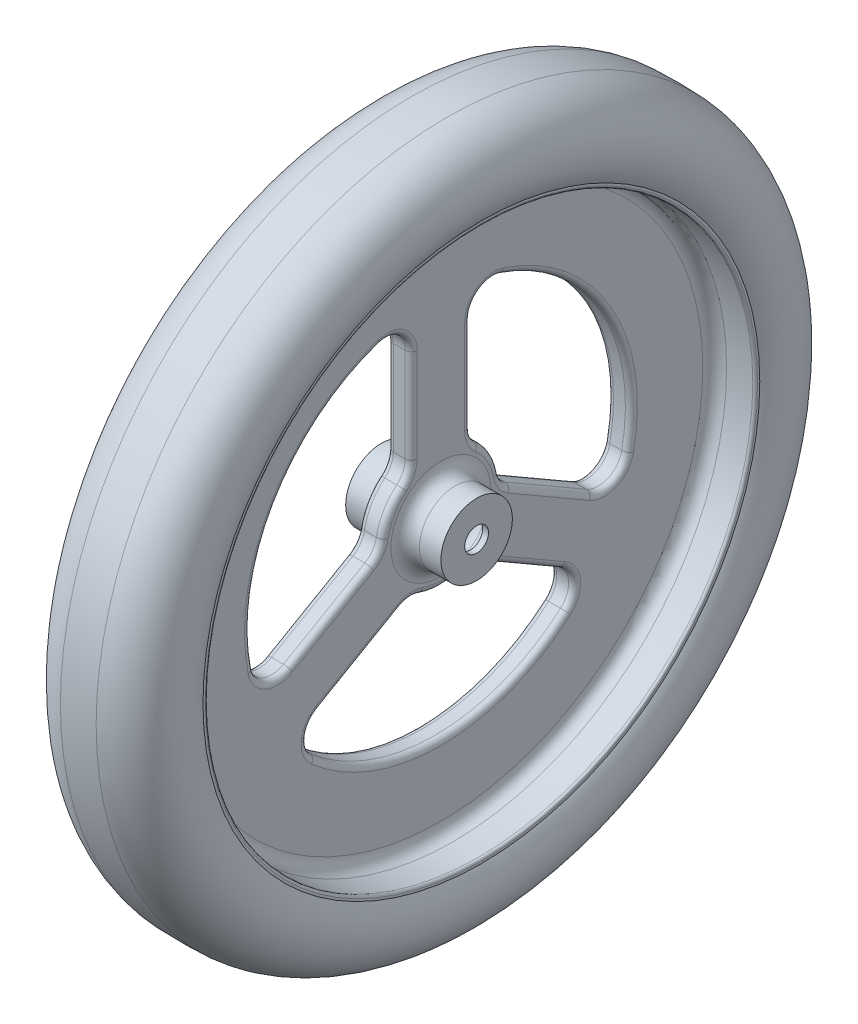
ISO-10303-21;
HEADER;
FILE_DESCRIPTION(('STEP AP214'),'2;1');
FILE_NAME('part.step','',(''),(''),'','','');
FILE_SCHEMA(('AUTOMOTIVE_DESIGN { 1 0 10303 214 1 1 1 1 }'));
ENDSEC;
DATA;
#1=APPLICATION_CONTEXT('core data for automotive mechanical design processes');
#2=APPLICATION_PROTOCOL_DEFINITION('international standard','automotive_design',2000,#1);
#3=PRODUCT_CONTEXT('',#1,'mechanical');
#4=PRODUCT('Part','Part','',(#3));
#5=PRODUCT_RELATED_PRODUCT_CATEGORY('part','',(#4));
#6=PRODUCT_DEFINITION_FORMATION('','',#4);
#7=PRODUCT_DEFINITION_CONTEXT('part definition',#1,'design');
#8=PRODUCT_DEFINITION('design','',#6,#7);
#9=PRODUCT_DEFINITION_SHAPE('','',#8);
#10=(LENGTH_UNIT() NAMED_UNIT(*) SI_UNIT(.MILLI.,.METRE.));
#11=(NAMED_UNIT(*) PLANE_ANGLE_UNIT() SI_UNIT($,.RADIAN.));
#12=(NAMED_UNIT(*) SI_UNIT($,.STERADIAN.) SOLID_ANGLE_UNIT());
#13=UNCERTAINTY_MEASURE_WITH_UNIT(LENGTH_MEASURE(1.E-05),#10,'distance_accuracy_value','');
#14=(GEOMETRIC_REPRESENTATION_CONTEXT(3) GLOBAL_UNCERTAINTY_ASSIGNED_CONTEXT((#13)) GLOBAL_UNIT_ASSIGNED_CONTEXT((#10,
#11,#12)) REPRESENTATION_CONTEXT('',''));
#15=CARTESIAN_POINT('',(0.,0.,0.));
#16=DIRECTION('',(0.,0.,1.));
#17=DIRECTION('',(1.,0.,0.));
#18=AXIS2_PLACEMENT_3D('',#15,#16,#17);
#19=CARTESIAN_POINT('',(-34.0083276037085,0.,0.));
#20=DIRECTION('',(-1.,0.,0.));
#21=DIRECTION('',(0.,0.,1.));
#22=AXIS2_PLACEMENT_3D('',#19,#20,#21);
#23=CYLINDRICAL_SURFACE('',#22,9.99999999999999);
#24=CARTESIAN_POINT('',(-40.,0.,0.));
#25=DIRECTION('',(-1.,0.,0.));
#26=DIRECTION('',(0.,0.,1.));
#27=AXIS2_PLACEMENT_3D('',#24,#25,#26);
#28=CIRCLE('',#27,9.99999999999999);
#29=CARTESIAN_POINT('',(-40.,0.,9.99999999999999));
#30=VERTEX_POINT('',#29);
#31=EDGE_CURVE('E641',#30,#30,#28,.T.);
#32=ORIENTED_EDGE('',*,*,#31,.T.);
#33=EDGE_LOOP('',(#32));
#34=FACE_BOUND('',#33,.T.);
#35=CARTESIAN_POINT('',(-35.,0.,0.));
#36=DIRECTION('',(1.,0.,0.));
#37=DIRECTION('',(0.,0.,-1.));
#38=AXIS2_PLACEMENT_3D('',#35,#36,#37);
#39=CIRCLE('',#38,9.99999999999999);
#40=CARTESIAN_POINT('',(-35.,0.,-9.99999999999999));
#41=VERTEX_POINT('',#40);
#42=EDGE_CURVE('E563',#41,#41,#39,.F.);
#43=ORIENTED_EDGE('',*,*,#42,.F.);
#44=EDGE_LOOP('',(#43));
#45=FACE_BOUND('',#44,.T.);
#46=ADVANCED_FACE('F43',(#34,#45),#23,.F.);
#47=CARTESIAN_POINT('',(40.,10.,0.));
#48=DIRECTION('',(-1.,0.,0.));
#49=DIRECTION('',(0.,0.,1.));
#50=AXIS2_PLACEMENT_3D('',#47,#48,#49);
#51=PLANE('',#50);
#52=CARTESIAN_POINT('',(40.,0.,0.));
#53=DIRECTION('',(-1.,0.,0.));
#54=DIRECTION('',(0.,0.,1.));
#55=AXIS2_PLACEMENT_3D('',#52,#53,#54);
#56=CIRCLE('',#55,30.);
#57=CARTESIAN_POINT('',(40.,0.,30.));
#58=VERTEX_POINT('',#57);
#59=EDGE_CURVE('E697',#58,#58,#56,.T.);
#60=ORIENTED_EDGE('',*,*,#59,.F.);
#61=EDGE_LOOP('',(#60));
#62=FACE_BOUND('',#61,.T.);
#63=CARTESIAN_POINT('',(40.,0.,0.));
#64=DIRECTION('',(-1.,0.,0.));
#65=DIRECTION('',(0.,0.,1.));
#66=AXIS2_PLACEMENT_3D('',#63,#64,#65);
#67=CIRCLE('',#66,10.);
#68=CARTESIAN_POINT('',(40.,0.,10.));
#69=VERTEX_POINT('',#68);
#70=EDGE_CURVE('E619',#69,#69,#67,.T.);
#71=ORIENTED_EDGE('',*,*,#70,.T.);
#72=EDGE_LOOP('',(#71));
#73=FACE_BOUND('',#72,.T.);
#74=ADVANCED_FACE('F1140',(#62,#73),#51,.F.);
#75=CARTESIAN_POINT('',(-34.0083276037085,0.,0.));
#76=DIRECTION('',(-1.,0.,0.));
#77=DIRECTION('',(0.,0.,1.));
#78=AXIS2_PLACEMENT_3D('',#75,#76,#77);
#79=CYLINDRICAL_SURFACE('',#78,30.);
#80=CARTESIAN_POINT('',(22.,0.,0.));
#81=DIRECTION('',(-1.,0.,0.));
#82=DIRECTION('',(0.,0.,1.));
#83=AXIS2_PLACEMENT_3D('',#80,#81,#82);
#84=CIRCLE('',#83,30.);
#85=CARTESIAN_POINT('',(22.,0.,30.));
#86=VERTEX_POINT('',#85);
#87=EDGE_CURVE('E694',#86,#86,#84,.T.);
#88=ORIENTED_EDGE('',*,*,#87,.F.);
#89=EDGE_LOOP('',(#88));
#90=FACE_BOUND('',#89,.T.);
#91=ORIENTED_EDGE('',*,*,#59,.T.);
#92=EDGE_LOOP('',(#91));
#93=FACE_BOUND('',#92,.T.);
#94=ADVANCED_FACE('F1147',(#90,#93),#79,.T.);
#95=CARTESIAN_POINT('',(22.,0.,0.));
#96=DIRECTION('',(-1.,0.,0.));
#97=DIRECTION('',(0.,0.,1.));
#98=AXIS2_PLACEMENT_3D('',#95,#96,#97);
#99=TOROIDAL_SURFACE('',#98,42.,12.);
#100=CARTESIAN_POINT('',(10.,0.,0.));
#101=DIRECTION('',(-1.,0.,0.));
#102=DIRECTION('',(0.,0.,1.));
#103=AXIS2_PLACEMENT_3D('',#100,#101,#102);
#104=CIRCLE('',#103,42.);
#105=CARTESIAN_POINT('',(10.,0.,42.));
#106=VERTEX_POINT('',#105);
#107=EDGE_CURVE('E691',#106,#106,#104,.T.);
#108=ORIENTED_EDGE('',*,*,#107,.F.);
#109=EDGE_LOOP('',(#108));
#110=FACE_BOUND('',#109,.T.);
#111=ORIENTED_EDGE('',*,*,#87,.T.);
#112=EDGE_LOOP('',(#111));
#113=FACE_BOUND('',#112,.T.);
#114=ADVANCED_FACE('F1231',(#110,#113),#99,.F.);
#115=CARTESIAN_POINT('',(10.,42.,0.));
#116=DIRECTION('',(-1.,0.,0.));
#117=DIRECTION('',(0.,0.,1.));
#118=AXIS2_PLACEMENT_3D('',#115,#116,#117);
#119=PLANE('',#118);
#120=CARTESIAN_POINT('',(10.,0.,0.));
#121=DIRECTION('',(-1.,0.,0.));
#122=DIRECTION('',(0.,0.,1.));
#123=AXIS2_PLACEMENT_3D('',#120,#121,#122);
#124=CIRCLE('',#123,165.);
#125=CARTESIAN_POINT('',(10.,-124.052316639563,-108.793486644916));
#126=VERTEX_POINT('',#125);
#127=CARTESIAN_POINT('',(10.,-124.052316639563,108.793486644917));
#128=VERTEX_POINT('',#127);
#129=EDGE_CURVE('E815',#126,#128,#124,.T.);
#130=ORIENTED_EDGE('',*,*,#129,.T.);
#131=CARTESIAN_POINT('',(10.,-105.256511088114,92.3096250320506));
#132=DIRECTION('',(-1.,0.,0.));
#133=DIRECTION('',(0.,0.,1.));
#134=AXIS2_PLACEMENT_3D('',#131,#132,#133);
#135=CIRCLE('',#134,25.);
#136=CARTESIAN_POINT('',(10.,-83.6058759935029,104.809625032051));
#137=VERTEX_POINT('',#136);
#138=EDGE_CURVE('E829',#128,#137,#135,.T.);
#139=ORIENTED_EDGE('',*,*,#138,.T.);
#140=DIRECTION('',(0.,-0.499999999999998,0.86602540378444));
#141=VECTOR('',#140,1.);
#142=CARTESIAN_POINT('',(10.,-6.82050807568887,-28.1865334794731));
#143=LINE('',#142,#141);
#144=CARTESIAN_POINT('',(10.,-44.1300213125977,36.4354390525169));
#145=VERTEX_POINT('',#144);
#146=EDGE_CURVE('E827',#137,#145,#143,.F.);
#147=ORIENTED_EDGE('',*,*,#146,.T.);
#148=CARTESIAN_POINT('',(10.,-65.7806564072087,23.9354390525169));
#149=DIRECTION('',(-1.,0.,0.));
#150=DIRECTION('',(0.,0.,1.));
#151=AXIS2_PLACEMENT_3D('',#148,#149,#150);
#152=CIRCLE('',#151,25.);
#153=CARTESIAN_POINT('',(10.,-42.2875648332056,15.3870679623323));
#154=VERTEX_POINT('',#153);
#155=EDGE_CURVE('E825',#145,#154,#152,.T.);
#156=ORIENTED_EDGE('',*,*,#155,.T.);
#157=CARTESIAN_POINT('',(10.,0.,0.));
#158=DIRECTION('',(-1.,0.,0.));
#159=DIRECTION('',(0.,0.,1.));
#160=AXIS2_PLACEMENT_3D('',#157,#158,#159);
#161=CIRCLE('',#160,45.);
#162=CARTESIAN_POINT('',(10.,-42.2875648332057,-15.387067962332));
#163=VERTEX_POINT('',#162);
#164=EDGE_CURVE('E823',#154,#163,#161,.F.);
#165=ORIENTED_EDGE('',*,*,#164,.T.);
#166=CARTESIAN_POINT('',(10.,-65.7806564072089,-23.9354390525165));
#167=DIRECTION('',(-1.,0.,0.));
#168=DIRECTION('',(0.,0.,1.));
#169=AXIS2_PLACEMENT_3D('',#166,#167,#168);
#170=CIRCLE('',#169,25.);
#171=CARTESIAN_POINT('',(10.,-44.130021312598,-36.4354390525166));
#172=VERTEX_POINT('',#171);
#173=EDGE_CURVE('E821',#163,#172,#170,.T.);
#174=ORIENTED_EDGE('',*,*,#173,.T.);
#175=DIRECTION('',(0.,0.500000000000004,0.866025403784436));
#176=VECTOR('',#175,1.);
#177=CARTESIAN_POINT('',(10.,-6.82050807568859,28.1865334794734));
#178=LINE('',#177,#176);
#179=CARTESIAN_POINT('',(10.,-83.6058759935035,-104.80962503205));
#180=VERTEX_POINT('',#179);
#181=EDGE_CURVE('E819',#172,#180,#178,.F.);
#182=ORIENTED_EDGE('',*,*,#181,.T.);
#183=CARTESIAN_POINT('',(10.,-105.256511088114,-92.3096250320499));
#184=DIRECTION('',(-1.,0.,0.));
#185=DIRECTION('',(0.,0.,1.));
#186=AXIS2_PLACEMENT_3D('',#183,#184,#185);
#187=CIRCLE('',#186,25.);
#188=EDGE_CURVE('E817',#180,#126,#187,.T.);
#189=ORIENTED_EDGE('',*,*,#188,.T.);
#190=EDGE_LOOP('',(#130,#139,#147,#156,#165,#174,#182,#189));
#191=FACE_BOUND('',#190,.T.);
#192=CARTESIAN_POINT('',(10.,0.,0.));
#193=DIRECTION('',(-1.,0.,0.));
#194=DIRECTION('',(0.,0.,1.));
#195=AXIS2_PLACEMENT_3D('',#192,#193,#194);
#196=CIRCLE('',#195,165.);
#197=CARTESIAN_POINT('',(10.,156.244081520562,-53.0357142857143));
#198=VERTEX_POINT('',#197);
#199=CARTESIAN_POINT('',(10.,-32.1917648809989,-161.829200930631));
#200=VERTEX_POINT('',#199);
#201=EDGE_CURVE('E798',#198,#200,#196,.T.);
#202=ORIENTED_EDGE('',*,*,#201,.T.);
#203=CARTESIAN_POINT('',(10.,-27.3142247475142,-137.30962503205));
#204=DIRECTION('',(-1.,0.,0.));
#205=DIRECTION('',(0.,0.,1.));
#206=AXIS2_PLACEMENT_3D('',#203,#204,#205);
#207=CIRCLE('',#206,25.);
#208=CARTESIAN_POINT('',(10.,-48.9648598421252,-124.809625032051));
#209=VERTEX_POINT('',#208);
#210=EDGE_CURVE('E812',#200,#209,#207,.T.);
#211=ORIENTED_EDGE('',*,*,#210,.T.);
#212=DIRECTION('',(0.,-0.499999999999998,-0.86602540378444));
#213=VECTOR('',#212,1.);
#214=CARTESIAN_POINT('',(10.,27.8205080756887,8.18653347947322));
#215=LINE('',#214,#213);
#216=CARTESIAN_POINT('',(10.,-9.48900516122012,-56.4354390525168));
#217=VERTEX_POINT('',#216);
#218=EDGE_CURVE('E810',#209,#217,#215,.F.);
#219=ORIENTED_EDGE('',*,*,#218,.T.);
#220=CARTESIAN_POINT('',(10.,12.1616299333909,-68.9354390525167));
#221=DIRECTION('',(-1.,0.,0.));
#222=DIRECTION('',(0.,0.,1.));
#223=AXIS2_PLACEMENT_3D('',#220,#221,#222);
#224=CIRCLE('',#223,25.);
#225=CARTESIAN_POINT('',(10.,7.81819067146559,-44.3156393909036));
#226=VERTEX_POINT('',#225);
#227=EDGE_CURVE('E808',#217,#226,#224,.T.);
#228=ORIENTED_EDGE('',*,*,#227,.T.);
#229=CARTESIAN_POINT('',(10.,0.,0.));
#230=DIRECTION('',(-1.,0.,0.));
#231=DIRECTION('',(0.,0.,1.));
#232=AXIS2_PLACEMENT_3D('',#229,#230,#231);
#233=CIRCLE('',#232,45.);
#234=CARTESIAN_POINT('',(10.,34.4693741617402,-28.9285714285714));
#235=VERTEX_POINT('',#234);
#236=EDGE_CURVE('E806',#226,#235,#233,.F.);
#237=ORIENTED_EDGE('',*,*,#236,.T.);
#238=CARTESIAN_POINT('',(10.,53.619026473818,-45.));
#239=DIRECTION('',(-1.,0.,0.));
#240=DIRECTION('',(0.,0.,1.));
#241=AXIS2_PLACEMENT_3D('',#238,#239,#240);
#242=CIRCLE('',#241,25.);
#243=CARTESIAN_POINT('',(10.,53.619026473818,-20.));
#244=VERTEX_POINT('',#243);
#245=EDGE_CURVE('E804',#235,#244,#242,.T.);
#246=ORIENTED_EDGE('',*,*,#245,.T.);
#247=DIRECTION('',(0.,-1.,0.));
#248=VECTOR('',#247,1.);
#249=CARTESIAN_POINT('',(10.,42.,-20.));
#250=LINE('',#249,#248);
#251=CARTESIAN_POINT('',(10.,132.570735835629,-20.));
#252=VERTEX_POINT('',#251);
#253=EDGE_CURVE('E802',#244,#252,#250,.F.);
#254=ORIENTED_EDGE('',*,*,#253,.T.);
#255=CARTESIAN_POINT('',(10.,132.570735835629,-45.));
#256=DIRECTION('',(-1.,0.,0.));
#257=DIRECTION('',(0.,0.,1.));
#258=AXIS2_PLACEMENT_3D('',#255,#256,#257);
#259=CIRCLE('',#258,25.);
#260=EDGE_CURVE('E800',#252,#198,#259,.T.);
#261=ORIENTED_EDGE('',*,*,#260,.T.);
#262=EDGE_LOOP('',(#202,#211,#219,#228,#237,#246,#254,#261));
#263=FACE_BOUND('',#262,.T.);
#264=DIRECTION('',(0.,0.5,-0.866025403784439));
#265=VECTOR('',#264,1.);
#266=CARTESIAN_POINT('',(10.,27.8205080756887,-8.18653347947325));
#267=LINE('',#266,#265);
#268=CARTESIAN_POINT('',(10.,-9.48900516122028,56.4354390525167));
#269=VERTEX_POINT('',#268);
#270=CARTESIAN_POINT('',(10.,-48.9648598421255,124.80962503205));
#271=VERTEX_POINT('',#270);
#272=EDGE_CURVE('E781',#269,#271,#267,.F.);
#273=ORIENTED_EDGE('',*,*,#272,.T.);
#274=CARTESIAN_POINT('',(10.,-27.3142247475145,137.30962503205));
#275=DIRECTION('',(-1.,0.,0.));
#276=DIRECTION('',(0.,0.,1.));
#277=AXIS2_PLACEMENT_3D('',#274,#275,#276);
#278=CIRCLE('',#277,25.);
#279=CARTESIAN_POINT('',(10.,-32.1917648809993,161.829200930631));
#280=VERTEX_POINT('',#279);
#281=EDGE_CURVE('E795',#271,#280,#278,.T.);
#282=ORIENTED_EDGE('',*,*,#281,.T.);
#283=CARTESIAN_POINT('',(10.,0.,0.));
#284=DIRECTION('',(-1.,0.,0.));
#285=DIRECTION('',(0.,0.,1.));
#286=AXIS2_PLACEMENT_3D('',#283,#284,#285);
#287=CIRCLE('',#286,165.);
#288=CARTESIAN_POINT('',(10.,156.244081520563,53.0357142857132));
#289=VERTEX_POINT('',#288);
#290=EDGE_CURVE('E793',#280,#289,#287,.T.);
#291=ORIENTED_EDGE('',*,*,#290,.T.);
#292=CARTESIAN_POINT('',(10.,132.570735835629,44.9999999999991));
#293=DIRECTION('',(-1.,0.,0.));
#294=DIRECTION('',(0.,0.,1.));
#295=AXIS2_PLACEMENT_3D('',#292,#293,#294);
#296=CIRCLE('',#295,25.);
#297=CARTESIAN_POINT('',(10.,132.570735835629,19.9999999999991));
#298=VERTEX_POINT('',#297);
#299=EDGE_CURVE('E791',#289,#298,#296,.T.);
#300=ORIENTED_EDGE('',*,*,#299,.T.);
#301=DIRECTION('',(0.,1.,0.));
#302=VECTOR('',#301,1.);
#303=CARTESIAN_POINT('',(10.,42.0000000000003,20.0000000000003));
#304=LINE('',#303,#302);
#305=CARTESIAN_POINT('',(10.,53.6190264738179,20.0000000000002));
#306=VERTEX_POINT('',#305);
#307=EDGE_CURVE('E789',#298,#306,#304,.F.);
#308=ORIENTED_EDGE('',*,*,#307,.T.);
#309=CARTESIAN_POINT('',(10.,53.6190264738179,45.0000000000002));
#310=DIRECTION('',(-1.,0.,0.));
#311=DIRECTION('',(0.,0.,1.));
#312=AXIS2_PLACEMENT_3D('',#309,#310,#311);
#313=CIRCLE('',#312,25.);
#314=CARTESIAN_POINT('',(10.,34.4693741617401,28.9285714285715));
#315=VERTEX_POINT('',#314);
#316=EDGE_CURVE('E787',#306,#315,#313,.T.);
#317=ORIENTED_EDGE('',*,*,#316,.T.);
#318=CARTESIAN_POINT('',(10.,0.,0.));
#319=DIRECTION('',(-1.,0.,0.));
#320=DIRECTION('',(0.,0.,1.));
#321=AXIS2_PLACEMENT_3D('',#318,#319,#320);
#322=CIRCLE('',#321,45.);
#323=CARTESIAN_POINT('',(10.,7.81819067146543,44.3156393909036));
#324=VERTEX_POINT('',#323);
#325=EDGE_CURVE('E785',#315,#324,#322,.F.);
#326=ORIENTED_EDGE('',*,*,#325,.T.);
#327=CARTESIAN_POINT('',(10.,12.1616299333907,68.9354390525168));
#328=DIRECTION('',(-1.,0.,0.));
#329=DIRECTION('',(0.,0.,1.));
#330=AXIS2_PLACEMENT_3D('',#327,#328,#329);
#331=CIRCLE('',#330,25.);
#332=EDGE_CURVE('E783',#324,#269,#331,.T.);
#333=ORIENTED_EDGE('',*,*,#332,.T.);
#334=EDGE_LOOP('',(#273,#282,#291,#300,#308,#317,#326,#333));
#335=FACE_BOUND('',#334,.T.);
#336=CARTESIAN_POINT('',(10.,0.,0.));
#337=DIRECTION('',(-1.,0.,0.));
#338=DIRECTION('',(0.,0.,1.));
#339=AXIS2_PLACEMENT_3D('',#336,#337,#338);
#340=CIRCLE('',#339,220.);
#341=CARTESIAN_POINT('',(10.,0.,220.));
#342=VERTEX_POINT('',#341);
#343=EDGE_CURVE('E688',#342,#342,#340,.T.);
#344=ORIENTED_EDGE('',*,*,#343,.F.);
#345=EDGE_LOOP('',(#344));
#346=FACE_BOUND('',#345,.T.);
#347=ORIENTED_EDGE('',*,*,#107,.T.);
#348=EDGE_LOOP('',(#347));
#349=FACE_BOUND('',#348,.T.);
#350=ADVANCED_FACE('F1042',(#191,#263,#335,#346,#349),#119,.F.);
#351=CARTESIAN_POINT('',(20.,0.,0.));
#352=DIRECTION('',(-1.,0.,0.));
#353=DIRECTION('',(0.,0.,1.));
#354=AXIS2_PLACEMENT_3D('',#351,#352,#353);
#355=TOROIDAL_SURFACE('',#354,220.,9.99999999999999);
#356=CARTESIAN_POINT('',(20.,0.,0.));
#357=DIRECTION('',(-1.,0.,0.));
#358=DIRECTION('',(0.,0.,1.));
#359=AXIS2_PLACEMENT_3D('',#356,#357,#358);
#360=CIRCLE('',#359,230.);
#361=CARTESIAN_POINT('',(20.,0.,230.));
#362=VERTEX_POINT('',#361);
#363=EDGE_CURVE('E685',#362,#362,#360,.T.);
#364=ORIENTED_EDGE('',*,*,#363,.F.);
#365=EDGE_LOOP('',(#364));
#366=FACE_BOUND('',#365,.T.);
#367=ORIENTED_EDGE('',*,*,#343,.T.);
#368=EDGE_LOOP('',(#367));
#369=FACE_BOUND('',#368,.T.);
#370=ADVANCED_FACE('F1224',(#366,#369),#355,.F.);
#371=CARTESIAN_POINT('',(-34.0083276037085,0.,0.));
#372=DIRECTION('',(-1.,0.,0.));
#373=DIRECTION('',(0.,0.,1.));
#374=AXIS2_PLACEMENT_3D('',#371,#372,#373);
#375=CYLINDRICAL_SURFACE('',#374,230.);
#376=CARTESIAN_POINT('',(42.,0.,0.));
#377=DIRECTION('',(-1.,0.,0.));
#378=DIRECTION('',(0.,0.,1.));
#379=AXIS2_PLACEMENT_3D('',#376,#377,#378);
#380=CIRCLE('',#379,230.);
#381=CARTESIAN_POINT('',(42.,0.,230.));
#382=VERTEX_POINT('',#381);
#383=EDGE_CURVE('E682',#382,#382,#380,.T.);
#384=ORIENTED_EDGE('',*,*,#383,.F.);
#385=EDGE_LOOP('',(#384));
#386=FACE_BOUND('',#385,.T.);
#387=ORIENTED_EDGE('',*,*,#363,.T.);
#388=EDGE_LOOP('',(#387));
#389=FACE_BOUND('',#388,.T.);
#390=ADVANCED_FACE('F1220',(#386,#389),#375,.F.);
#391=CARTESIAN_POINT('',(42.,0.,0.));
#392=DIRECTION('',(-1.,0.,0.));
#393=DIRECTION('',(0.,0.,1.));
#394=AXIS2_PLACEMENT_3D('',#391,#392,#393);
#395=TOROIDAL_SURFACE('',#394,232.,2.00000000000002);
#396=CARTESIAN_POINT('',(44.,0.,0.));
#397=DIRECTION('',(-1.,0.,0.));
#398=DIRECTION('',(0.,0.,1.));
#399=AXIS2_PLACEMENT_3D('',#396,#397,#398);
#400=CIRCLE('',#399,232.);
#401=CARTESIAN_POINT('',(44.,0.,232.));
#402=VERTEX_POINT('',#401);
#403=EDGE_CURVE('E679',#402,#402,#400,.T.);
#404=ORIENTED_EDGE('',*,*,#403,.F.);
#405=EDGE_LOOP('',(#404));
#406=FACE_BOUND('',#405,.T.);
#407=ORIENTED_EDGE('',*,*,#383,.T.);
#408=EDGE_LOOP('',(#407));
#409=FACE_BOUND('',#408,.T.);
#410=ADVANCED_FACE('F1216',(#406,#409),#395,.T.);
#411=CARTESIAN_POINT('',(44.,232.,0.));
#412=DIRECTION('',(-1.,0.,0.));
#413=DIRECTION('',(0.,0.,1.));
#414=AXIS2_PLACEMENT_3D('',#411,#412,#413);
#415=PLANE('',#414);
#416=CARTESIAN_POINT('',(44.,0.,0.));
#417=DIRECTION('',(-1.,0.,0.));
#418=DIRECTION('',(0.,0.,1.));
#419=AXIS2_PLACEMENT_3D('',#416,#417,#418);
#420=CIRCLE('',#419,233.86082008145);
#421=CARTESIAN_POINT('',(44.,0.,233.86082008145));
#422=VERTEX_POINT('',#421);
#423=EDGE_CURVE('E676',#422,#422,#420,.T.);
#424=ORIENTED_EDGE('',*,*,#423,.F.);
#425=EDGE_LOOP('',(#424));
#426=FACE_BOUND('',#425,.T.);
#427=ORIENTED_EDGE('',*,*,#403,.T.);
#428=EDGE_LOOP('',(#427));
#429=FACE_BOUND('',#428,.T.);
#430=ADVANCED_FACE('F1212',(#426,#429),#415,.F.);
#431=CARTESIAN_POINT('',(10.,0.,0.));
#432=DIRECTION('',(-1.,0.,0.));
#433=DIRECTION('',(0.,0.,1.));
#434=AXIS2_PLACEMENT_3D('',#431,#432,#433);
#435=TOROIDAL_SURFACE('',#434,254.932127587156,40.);
#436=CARTESIAN_POINT('',(15.,0.,0.));
#437=DIRECTION('',(-1.,0.,0.));
#438=DIRECTION('',(0.,0.,1.));
#439=AXIS2_PLACEMENT_3D('',#436,#437,#438);
#440=CIRCLE('',#439,294.618397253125);
#441=CARTESIAN_POINT('',(15.,294.618397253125,0.));
#442=VERTEX_POINT('',#441);
#443=EDGE_CURVE('E673',#442,#442,#440,.T.);
#444=ORIENTED_EDGE('',*,*,#443,.F.);
#445=EDGE_LOOP('',(#444));
#446=FACE_BOUND('',#445,.T.);
#447=ORIENTED_EDGE('',*,*,#423,.T.);
#448=EDGE_LOOP('',(#447));
#449=FACE_BOUND('',#448,.T.);
#450=ADVANCED_FACE('F1208',(#446,#449),#435,.T.);
#451=CARTESIAN_POINT('',(0.,0.,0.));
#452=DIRECTION('',(-1.,0.,0.));
#453=DIRECTION('',(0.,1.,0.));
#454=AXIS2_PLACEMENT_3D('',#451,#452,#453);
#455=SPHERICAL_SURFACE('',#454,295.);
#456=CARTESIAN_POINT('',(-15.,0.,0.));
#457=DIRECTION('',(-1.,0.,0.));
#458=DIRECTION('',(0.,0.,1.));
#459=AXIS2_PLACEMENT_3D('',#456,#457,#458);
#460=CIRCLE('',#459,294.618397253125);
#461=CARTESIAN_POINT('',(-15.,294.618397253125,0.));
#462=VERTEX_POINT('',#461);
#463=EDGE_CURVE('E670',#462,#462,#460,.T.);
#464=CARTESIAN_POINT('',(-15.,294.618397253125,0.));
#465=CARTESIAN_POINT('',(-14.6877695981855,294.634293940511,0.));
#466=CARTESIAN_POINT('',(-14.3755139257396,294.649694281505,0.));
#467=CARTESIAN_POINT('',(-13.7509551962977,294.679502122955,0.));
#468=CARTESIAN_POINT('',(-13.4386521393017,294.693909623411,0.));
#469=CARTESIAN_POINT('',(-12.8140017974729,294.721731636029,0.));
#470=CARTESIAN_POINT('',(-12.5016545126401,294.735146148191,0.));
#471=CARTESIAN_POINT('',(-11.8769188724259,294.760982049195,0.));
#472=CARTESIAN_POINT('',(-11.5645305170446,294.773403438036,0.));
#473=CARTESIAN_POINT('',(-10.9397158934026,294.797252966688,0.));
#474=CARTESIAN_POINT('',(-10.627289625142,294.808681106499,0.));
#475=CARTESIAN_POINT('',(-10.0024023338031,294.830544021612,0.));
#476=CARTESIAN_POINT('',(-9.68994131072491,294.840978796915,0.));
#477=CARTESIAN_POINT('',(-9.06498766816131,294.860854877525,0.));
#478=CARTESIAN_POINT('',(-8.75249504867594,294.870296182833,0.));
#479=CARTESIAN_POINT('',(-8.1274813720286,294.888185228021,0.));
#480=CARTESIAN_POINT('',(-7.81496031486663,294.896632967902,0.));
#481=CARTESIAN_POINT('',(-7.18989292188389,294.912534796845,0.));
#482=CARTESIAN_POINT('',(-6.87734658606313,294.919988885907,0.));
#483=CARTESIAN_POINT('',(-6.25223179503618,294.933903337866,0.));
#484=CARTESIAN_POINT('',(-5.93966333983,294.940363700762,0.));
#485=CARTESIAN_POINT('',(-5.31450746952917,294.952290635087,0.));
#486=CARTESIAN_POINT('',(-5.00192005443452,294.957757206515,0.));
#487=CARTESIAN_POINT('',(-4.37672942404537,294.967696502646,0.));
#488=CARTESIAN_POINT('',(-4.06412620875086,294.972169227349,0.));
#489=CARTESIAN_POINT('',(-3.43890713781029,294.980120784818,0.));
#490=CARTESIAN_POINT('',(-3.12629128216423,294.983599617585,0.));
#491=CARTESIAN_POINT('',(-2.50105009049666,294.989563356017,0.));
#492=CARTESIAN_POINT('',(-2.18842475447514,294.992048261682,0.));
#493=CARTESIAN_POINT('',(-1.56316776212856,294.996024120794,0.));
#494=CARTESIAN_POINT('',(-1.2505361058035,294.99751507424,0.));
#495=CARTESIAN_POINT('',(-0.625269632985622,294.999503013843,0.));
#496=CARTESIAN_POINT('',(-0.312634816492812,295.,0.));
#497=CARTESIAN_POINT('',(0.312634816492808,295.,0.));
#498=CARTESIAN_POINT('',(0.625269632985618,294.999503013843,0.));
#499=CARTESIAN_POINT('',(1.25053610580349,294.99751507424,0.));
#500=CARTESIAN_POINT('',(1.56316776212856,294.996024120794,0.));
#501=CARTESIAN_POINT('',(2.18842475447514,294.992048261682,0.));
#502=CARTESIAN_POINT('',(2.50105009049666,294.989563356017,0.));
#503=CARTESIAN_POINT('',(3.12629128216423,294.983599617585,0.));
#504=CARTESIAN_POINT('',(3.43890713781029,294.980120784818,0.));
#505=CARTESIAN_POINT('',(4.06412620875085,294.972169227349,0.));
#506=CARTESIAN_POINT('',(4.37672942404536,294.967696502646,0.));
#507=CARTESIAN_POINT('',(5.00192005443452,294.957757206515,0.));
#508=CARTESIAN_POINT('',(5.31450746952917,294.952290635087,0.));
#509=CARTESIAN_POINT('',(5.93966333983,294.940363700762,0.));
#510=CARTESIAN_POINT('',(6.25223179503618,294.933903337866,0.));
#511=CARTESIAN_POINT('',(6.87734658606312,294.919988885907,0.));
#512=CARTESIAN_POINT('',(7.18989292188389,294.912534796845,0.));
#513=CARTESIAN_POINT('',(7.81496031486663,294.896632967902,0.));
#514=CARTESIAN_POINT('',(8.1274813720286,294.888185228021,0.));
#515=CARTESIAN_POINT('',(8.75249504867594,294.870296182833,0.));
#516=CARTESIAN_POINT('',(9.06498766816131,294.860854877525,0.));
#517=CARTESIAN_POINT('',(9.68994131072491,294.840978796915,0.));
#518=CARTESIAN_POINT('',(10.0024023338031,294.830544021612,0.));
#519=CARTESIAN_POINT('',(10.627289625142,294.808681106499,0.));
#520=CARTESIAN_POINT('',(10.9397158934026,294.797252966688,0.));
#521=CARTESIAN_POINT('',(11.5645305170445,294.773403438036,0.));
#522=CARTESIAN_POINT('',(11.8769188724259,294.760982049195,0.));
#523=CARTESIAN_POINT('',(12.5016545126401,294.735146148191,0.));
#524=CARTESIAN_POINT('',(12.8140017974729,294.721731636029,0.));
#525=CARTESIAN_POINT('',(13.4386521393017,294.693909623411,0.));
#526=CARTESIAN_POINT('',(13.7509551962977,294.679502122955,0.));
#527=CARTESIAN_POINT('',(14.3755139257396,294.649694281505,0.));
#528=CARTESIAN_POINT('',(14.6877695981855,294.634293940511,0.));
#529=CARTESIAN_POINT('',(15.,294.618397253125,0.));
#530=B_SPLINE_CURVE_WITH_KNOTS('',3,(#464,#465,#466,#467,#468,#469,#470,#471,#472,#473,#474,
#475,#476,#477,#478,#479,#480,#481,#482,#483,#484,#485,#486,#487,#488,#489,#490,#491,#492,#493,
#494,#495,#496,#497,#498,#499,#500,#501,#502,#503,#504,#505,#506,#507,#508,#509,#510,#511,#512,
#513,#514,#515,#516,#517,#518,#519,#520,#521,#522,#523,#524,#525,#526,#527,#528,#529),
.UNSPECIFIED.,.F.,.F.,(4,2,2,2,2,2,2,2,2,2,2,2,2,2,2,2,2,2,2,2,2,2,2,2,2,2,2,2,2,2,2,2,4),(0.,
0.937904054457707,1.87580810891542,2.81371216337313,3.75161621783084,4.68952027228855,
5.62742432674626,6.56532838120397,7.50323243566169,8.44113649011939,9.37904054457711,
10.3169445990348,11.2548486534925,12.1927527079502,13.130656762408,14.0685608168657,
15.0064648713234,15.9443689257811,16.8822729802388,17.8201770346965,18.7580810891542,
19.6959851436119,20.6338891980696,21.5717932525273,22.509697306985,23.4476013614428,
24.3855054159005,25.3234094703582,26.2613135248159,27.1992175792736,28.1371216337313,
29.075025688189,30.0129297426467),.UNSPECIFIED.);
#531=EDGE_CURVE('BSEAM1204',#462,#442,#530,.T.);
#532=ORIENTED_EDGE('',*,*,#463,.F.);
#533=ORIENTED_EDGE('',*,*,#443,.T.);
#534=ORIENTED_EDGE('',*,*,#531,.T.);
#535=ORIENTED_EDGE('',*,*,#531,.F.);
#536=EDGE_LOOP('',(#532,#534,#533,#535));
#537=FACE_BOUND('',#536,.T.);
#538=ADVANCED_FACE('F1204',(#537),#455,.T.);
#539=CARTESIAN_POINT('',(-10.,0.,0.));
#540=DIRECTION('',(-1.,0.,0.));
#541=DIRECTION('',(0.,0.,1.));
#542=AXIS2_PLACEMENT_3D('',#539,#540,#541);
#543=TOROIDAL_SURFACE('',#542,254.932127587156,40.);
#544=CARTESIAN_POINT('',(-44.,0.,0.));
#545=DIRECTION('',(-1.,0.,0.));
#546=DIRECTION('',(0.,0.,1.));
#547=AXIS2_PLACEMENT_3D('',#544,#545,#546);
#548=CIRCLE('',#547,233.86082008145);
#549=CARTESIAN_POINT('',(-44.,0.,233.86082008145));
#550=VERTEX_POINT('',#549);
#551=EDGE_CURVE('E667',#550,#550,#548,.T.);
#552=ORIENTED_EDGE('',*,*,#551,.F.);
#553=EDGE_LOOP('',(#552));
#554=FACE_BOUND('',#553,.T.);
#555=ORIENTED_EDGE('',*,*,#463,.T.);
#556=EDGE_LOOP('',(#555));
#557=FACE_BOUND('',#556,.T.);
#558=ADVANCED_FACE('F1200',(#554,#557),#543,.T.);
#559=CARTESIAN_POINT('',(-44.,232.,0.));
#560=DIRECTION('',(1.,0.,0.));
#561=DIRECTION('',(0.,0.,-1.));
#562=AXIS2_PLACEMENT_3D('',#559,#560,#561);
#563=PLANE('',#562);
#564=CARTESIAN_POINT('',(-44.,0.,0.));
#565=DIRECTION('',(-1.,0.,0.));
#566=DIRECTION('',(0.,0.,1.));
#567=AXIS2_PLACEMENT_3D('',#564,#565,#566);
#568=CIRCLE('',#567,232.);
#569=CARTESIAN_POINT('',(-44.,0.,232.));
#570=VERTEX_POINT('',#569);
#571=EDGE_CURVE('E664',#570,#570,#568,.T.);
#572=ORIENTED_EDGE('',*,*,#571,.F.);
#573=EDGE_LOOP('',(#572));
#574=FACE_BOUND('',#573,.T.);
#575=ORIENTED_EDGE('',*,*,#551,.T.);
#576=EDGE_LOOP('',(#575));
#577=FACE_BOUND('',#576,.T.);
#578=ADVANCED_FACE('F1196',(#574,#577),#563,.F.);
#579=CARTESIAN_POINT('',(-42.,0.,0.));
#580=DIRECTION('',(-1.,0.,0.));
#581=DIRECTION('',(0.,0.,1.));
#582=AXIS2_PLACEMENT_3D('',#579,#580,#581);
#583=TOROIDAL_SURFACE('',#582,232.,2.00000000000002);
#584=CARTESIAN_POINT('',(-42.,0.,0.));
#585=DIRECTION('',(-1.,0.,0.));
#586=DIRECTION('',(0.,0.,1.));
#587=AXIS2_PLACEMENT_3D('',#584,#585,#586);
#588=CIRCLE('',#587,230.);
#589=CARTESIAN_POINT('',(-42.,0.,230.));
#590=VERTEX_POINT('',#589);
#591=EDGE_CURVE('E661',#590,#590,#588,.T.);
#592=ORIENTED_EDGE('',*,*,#591,.F.);
#593=EDGE_LOOP('',(#592));
#594=FACE_BOUND('',#593,.T.);
#595=ORIENTED_EDGE('',*,*,#571,.T.);
#596=EDGE_LOOP('',(#595));
#597=FACE_BOUND('',#596,.T.);
#598=ADVANCED_FACE('F1192',(#594,#597),#583,.T.);
#599=CARTESIAN_POINT('',(-34.0083276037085,0.,0.));
#600=DIRECTION('',(-1.,0.,0.));
#601=DIRECTION('',(0.,0.,1.));
#602=AXIS2_PLACEMENT_3D('',#599,#600,#601);
#603=CYLINDRICAL_SURFACE('',#602,230.);
#604=CARTESIAN_POINT('',(-20.,0.,0.));
#605=DIRECTION('',(-1.,0.,0.));
#606=DIRECTION('',(0.,0.,1.));
#607=AXIS2_PLACEMENT_3D('',#604,#605,#606);
#608=CIRCLE('',#607,230.);
#609=CARTESIAN_POINT('',(-20.,0.,230.));
#610=VERTEX_POINT('',#609);
#611=EDGE_CURVE('E658',#610,#610,#608,.T.);
#612=ORIENTED_EDGE('',*,*,#611,.F.);
#613=EDGE_LOOP('',(#612));
#614=FACE_BOUND('',#613,.T.);
#615=ORIENTED_EDGE('',*,*,#591,.T.);
#616=EDGE_LOOP('',(#615));
#617=FACE_BOUND('',#616,.T.);
#618=ADVANCED_FACE('F1188',(#614,#617),#603,.F.);
#619=CARTESIAN_POINT('',(-20.,0.,0.));
#620=DIRECTION('',(-1.,0.,0.));
#621=DIRECTION('',(0.,0.,1.));
#622=AXIS2_PLACEMENT_3D('',#619,#620,#621);
#623=TOROIDAL_SURFACE('',#622,220.,9.99999999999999);
#624=CARTESIAN_POINT('',(-10.,0.,0.));
#625=DIRECTION('',(-1.,0.,0.));
#626=DIRECTION('',(0.,0.,1.));
#627=AXIS2_PLACEMENT_3D('',#624,#625,#626);
#628=CIRCLE('',#627,220.);
#629=CARTESIAN_POINT('',(-10.,0.,220.));
#630=VERTEX_POINT('',#629);
#631=EDGE_CURVE('E655',#630,#630,#628,.T.);
#632=ORIENTED_EDGE('',*,*,#631,.F.);
#633=EDGE_LOOP('',(#632));
#634=FACE_BOUND('',#633,.T.);
#635=ORIENTED_EDGE('',*,*,#611,.T.);
#636=EDGE_LOOP('',(#635));
#637=FACE_BOUND('',#636,.T.);
#638=ADVANCED_FACE('F1184',(#634,#637),#623,.F.);
#639=CARTESIAN_POINT('',(-10.,42.,0.));
#640=DIRECTION('',(1.,0.,0.));
#641=DIRECTION('',(0.,0.,-1.));
#642=AXIS2_PLACEMENT_3D('',#639,#640,#641);
#643=PLANE('',#642);
#644=DIRECTION('',(0.,-0.499999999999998,0.86602540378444));
#645=VECTOR('',#644,1.);
#646=CARTESIAN_POINT('',(-10.,-6.82050807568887,-28.1865334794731));
#647=LINE('',#646,#645);
#648=CARTESIAN_POINT('',(-10.,-44.1300213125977,36.4354390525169));
#649=VERTEX_POINT('',#648);
#650=CARTESIAN_POINT('',(-10.,-83.6058759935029,104.809625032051));
#651=VERTEX_POINT('',#650);
#652=EDGE_CURVE('E746',#649,#651,#647,.T.);
#653=ORIENTED_EDGE('',*,*,#652,.T.);
#654=CARTESIAN_POINT('',(-10.,-105.256511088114,92.3096250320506));
#655=DIRECTION('',(1.,0.,0.));
#656=DIRECTION('',(0.,0.,-1.));
#657=AXIS2_PLACEMENT_3D('',#654,#655,#656);
#658=CIRCLE('',#657,25.);
#659=CARTESIAN_POINT('',(-10.,-124.052316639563,108.793486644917));
#660=VERTEX_POINT('',#659);
#661=EDGE_CURVE('E748',#651,#660,#658,.T.);
#662=ORIENTED_EDGE('',*,*,#661,.T.);
#663=CARTESIAN_POINT('',(-10.,0.,0.));
#664=DIRECTION('',(1.,0.,0.));
#665=DIRECTION('',(0.,0.,-1.));
#666=AXIS2_PLACEMENT_3D('',#663,#664,#665);
#667=CIRCLE('',#666,165.);
#668=CARTESIAN_POINT('',(-10.,-124.052316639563,-108.793486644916));
#669=VERTEX_POINT('',#668);
#670=EDGE_CURVE('E734',#660,#669,#667,.T.);
#671=ORIENTED_EDGE('',*,*,#670,.T.);
#672=CARTESIAN_POINT('',(-10.,-105.256511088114,-92.3096250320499));
#673=DIRECTION('',(1.,0.,0.));
#674=DIRECTION('',(0.,0.,-1.));
#675=AXIS2_PLACEMENT_3D('',#672,#673,#674);
#676=CIRCLE('',#675,25.);
#677=CARTESIAN_POINT('',(-10.,-83.6058759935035,-104.80962503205));
#678=VERTEX_POINT('',#677);
#679=EDGE_CURVE('E736',#669,#678,#676,.T.);
#680=ORIENTED_EDGE('',*,*,#679,.T.);
#681=DIRECTION('',(0.,0.500000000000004,0.866025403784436));
#682=VECTOR('',#681,1.);
#683=CARTESIAN_POINT('',(-10.,-6.8205080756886,28.1865334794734));
#684=LINE('',#683,#682);
#685=CARTESIAN_POINT('',(-10.,-44.130021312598,-36.4354390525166));
#686=VERTEX_POINT('',#685);
#687=EDGE_CURVE('E738',#678,#686,#684,.T.);
#688=ORIENTED_EDGE('',*,*,#687,.T.);
#689=CARTESIAN_POINT('',(-10.,-65.7806564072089,-23.9354390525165));
#690=DIRECTION('',(1.,0.,0.));
#691=DIRECTION('',(0.,0.,-1.));
#692=AXIS2_PLACEMENT_3D('',#689,#690,#691);
#693=CIRCLE('',#692,25.);
#694=CARTESIAN_POINT('',(-10.,-42.2875648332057,-15.387067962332));
#695=VERTEX_POINT('',#694);
#696=EDGE_CURVE('E740',#686,#695,#693,.T.);
#697=ORIENTED_EDGE('',*,*,#696,.T.);
#698=CARTESIAN_POINT('',(-10.,0.,0.));
#699=DIRECTION('',(1.,0.,0.));
#700=DIRECTION('',(0.,0.,-1.));
#701=AXIS2_PLACEMENT_3D('',#698,#699,#700);
#702=CIRCLE('',#701,45.);
#703=CARTESIAN_POINT('',(-10.,-42.2875648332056,15.3870679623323));
#704=VERTEX_POINT('',#703);
#705=EDGE_CURVE('E742',#695,#704,#702,.F.);
#706=ORIENTED_EDGE('',*,*,#705,.T.);
#707=CARTESIAN_POINT('',(-10.,-65.7806564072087,23.9354390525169));
#708=DIRECTION('',(1.,0.,0.));
#709=DIRECTION('',(0.,0.,-1.));
#710=AXIS2_PLACEMENT_3D('',#707,#708,#709);
#711=CIRCLE('',#710,25.);
#712=EDGE_CURVE('E744',#704,#649,#711,.T.);
#713=ORIENTED_EDGE('',*,*,#712,.T.);
#714=EDGE_LOOP('',(#653,#662,#671,#680,#688,#697,#706,#713));
#715=FACE_BOUND('',#714,.T.);
#716=DIRECTION('',(0.,-0.499999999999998,-0.86602540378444));
#717=VECTOR('',#716,1.);
#718=CARTESIAN_POINT('',(-10.,27.8205080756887,8.18653347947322));
#719=LINE('',#718,#717);
#720=CARTESIAN_POINT('',(-10.,-9.48900516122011,-56.4354390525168));
#721=VERTEX_POINT('',#720);
#722=CARTESIAN_POINT('',(-10.,-48.9648598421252,-124.80962503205));
#723=VERTEX_POINT('',#722);
#724=EDGE_CURVE('E729',#721,#723,#719,.T.);
#725=ORIENTED_EDGE('',*,*,#724,.T.);
#726=CARTESIAN_POINT('',(-10.,-27.3142247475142,-137.30962503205));
#727=DIRECTION('',(1.,0.,0.));
#728=DIRECTION('',(0.,0.,-1.));
#729=AXIS2_PLACEMENT_3D('',#726,#727,#728);
#730=CIRCLE('',#729,25.);
#731=CARTESIAN_POINT('',(-10.,-32.1917648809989,-161.829200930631));
#732=VERTEX_POINT('',#731);
#733=EDGE_CURVE('E731',#723,#732,#730,.T.);
#734=ORIENTED_EDGE('',*,*,#733,.T.);
#735=CARTESIAN_POINT('',(-10.,0.,0.));
#736=DIRECTION('',(1.,0.,0.));
#737=DIRECTION('',(0.,0.,-1.));
#738=AXIS2_PLACEMENT_3D('',#735,#736,#737);
#739=CIRCLE('',#738,165.);
#740=CARTESIAN_POINT('',(-10.,156.244081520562,-53.0357142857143));
#741=VERTEX_POINT('',#740);
#742=EDGE_CURVE('E717',#732,#741,#739,.T.);
#743=ORIENTED_EDGE('',*,*,#742,.T.);
#744=CARTESIAN_POINT('',(-10.,132.570735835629,-45.));
#745=DIRECTION('',(1.,0.,0.));
#746=DIRECTION('',(0.,0.,-1.));
#747=AXIS2_PLACEMENT_3D('',#744,#745,#746);
#748=CIRCLE('',#747,25.);
#749=CARTESIAN_POINT('',(-10.,132.570735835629,-20.));
#750=VERTEX_POINT('',#749);
#751=EDGE_CURVE('E719',#741,#750,#748,.T.);
#752=ORIENTED_EDGE('',*,*,#751,.T.);
#753=DIRECTION('',(0.,-1.,0.));
#754=VECTOR('',#753,1.);
#755=CARTESIAN_POINT('',(-10.,42.,-20.));
#756=LINE('',#755,#754);
#757=CARTESIAN_POINT('',(-10.,53.619026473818,-20.));
#758=VERTEX_POINT('',#757);
#759=EDGE_CURVE('E721',#750,#758,#756,.T.);
#760=ORIENTED_EDGE('',*,*,#759,.T.);
#761=CARTESIAN_POINT('',(-10.,53.619026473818,-45.));
#762=DIRECTION('',(1.,0.,0.));
#763=DIRECTION('',(0.,0.,-1.));
#764=AXIS2_PLACEMENT_3D('',#761,#762,#763);
#765=CIRCLE('',#764,25.);
#766=CARTESIAN_POINT('',(-10.,34.4693741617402,-28.9285714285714));
#767=VERTEX_POINT('',#766);
#768=EDGE_CURVE('E723',#758,#767,#765,.T.);
#769=ORIENTED_EDGE('',*,*,#768,.T.);
#770=CARTESIAN_POINT('',(-10.,0.,0.));
#771=DIRECTION('',(1.,0.,0.));
#772=DIRECTION('',(0.,0.,-1.));
#773=AXIS2_PLACEMENT_3D('',#770,#771,#772);
#774=CIRCLE('',#773,45.);
#775=CARTESIAN_POINT('',(-10.,7.81819067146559,-44.3156393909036));
#776=VERTEX_POINT('',#775);
#777=EDGE_CURVE('E725',#767,#776,#774,.F.);
#778=ORIENTED_EDGE('',*,*,#777,.T.);
#779=CARTESIAN_POINT('',(-10.,12.1616299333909,-68.9354390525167));
#780=DIRECTION('',(1.,0.,0.));
#781=DIRECTION('',(0.,0.,-1.));
#782=AXIS2_PLACEMENT_3D('',#779,#780,#781);
#783=CIRCLE('',#782,25.);
#784=EDGE_CURVE('E727',#776,#721,#783,.T.);
#785=ORIENTED_EDGE('',*,*,#784,.T.);
#786=EDGE_LOOP('',(#725,#734,#743,#752,#760,#769,#778,#785));
#787=FACE_BOUND('',#786,.T.);
#788=CARTESIAN_POINT('',(-10.,0.,0.));
#789=DIRECTION('',(1.,0.,0.));
#790=DIRECTION('',(0.,0.,-1.));
#791=AXIS2_PLACEMENT_3D('',#788,#789,#790);
#792=CIRCLE('',#791,165.);
#793=CARTESIAN_POINT('',(-10.,156.244081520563,53.0357142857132));
#794=VERTEX_POINT('',#793);
#795=CARTESIAN_POINT('',(-10.,-32.1917648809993,161.829200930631));
#796=VERTEX_POINT('',#795);
#797=EDGE_CURVE('E712',#794,#796,#792,.T.);
#798=ORIENTED_EDGE('',*,*,#797,.T.);
#799=CARTESIAN_POINT('',(-10.,-27.3142247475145,137.30962503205));
#800=DIRECTION('',(1.,0.,0.));
#801=DIRECTION('',(0.,0.,-1.));
#802=AXIS2_PLACEMENT_3D('',#799,#800,#801);
#803=CIRCLE('',#802,25.);
#804=CARTESIAN_POINT('',(-10.,-48.9648598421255,124.80962503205));
#805=VERTEX_POINT('',#804);
#806=EDGE_CURVE('E714',#796,#805,#803,.T.);
#807=ORIENTED_EDGE('',*,*,#806,.T.);
#808=DIRECTION('',(0.,0.5,-0.866025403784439));
#809=VECTOR('',#808,1.);
#810=CARTESIAN_POINT('',(-10.,27.8205080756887,-8.18653347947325));
#811=LINE('',#810,#809);
#812=CARTESIAN_POINT('',(-10.,-9.48900516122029,56.4354390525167));
#813=VERTEX_POINT('',#812);
#814=EDGE_CURVE('E700',#805,#813,#811,.T.);
#815=ORIENTED_EDGE('',*,*,#814,.T.);
#816=CARTESIAN_POINT('',(-10.,12.1616299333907,68.9354390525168));
#817=DIRECTION('',(1.,0.,0.));
#818=DIRECTION('',(0.,0.,-1.));
#819=AXIS2_PLACEMENT_3D('',#816,#817,#818);
#820=CIRCLE('',#819,25.);
#821=CARTESIAN_POINT('',(-10.,7.81819067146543,44.3156393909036));
#822=VERTEX_POINT('',#821);
#823=EDGE_CURVE('E702',#813,#822,#820,.T.);
#824=ORIENTED_EDGE('',*,*,#823,.T.);
#825=CARTESIAN_POINT('',(-10.,0.,0.));
#826=DIRECTION('',(1.,0.,0.));
#827=DIRECTION('',(0.,0.,-1.));
#828=AXIS2_PLACEMENT_3D('',#825,#826,#827);
#829=CIRCLE('',#828,45.);
#830=CARTESIAN_POINT('',(-10.,34.4693741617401,28.9285714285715));
#831=VERTEX_POINT('',#830);
#832=EDGE_CURVE('E704',#822,#831,#829,.F.);
#833=ORIENTED_EDGE('',*,*,#832,.T.);
#834=CARTESIAN_POINT('',(-10.,53.6190264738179,45.0000000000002));
#835=DIRECTION('',(1.,0.,0.));
#836=DIRECTION('',(0.,0.,-1.));
#837=AXIS2_PLACEMENT_3D('',#834,#835,#836);
#838=CIRCLE('',#837,25.);
#839=CARTESIAN_POINT('',(-10.,53.6190264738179,20.0000000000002));
#840=VERTEX_POINT('',#839);
#841=EDGE_CURVE('E706',#831,#840,#838,.T.);
#842=ORIENTED_EDGE('',*,*,#841,.T.);
#843=DIRECTION('',(0.,1.,0.));
#844=VECTOR('',#843,1.);
#845=CARTESIAN_POINT('',(-10.,42.0000000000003,20.0000000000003));
#846=LINE('',#845,#844);
#847=CARTESIAN_POINT('',(-10.,132.570735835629,19.9999999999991));
#848=VERTEX_POINT('',#847);
#849=EDGE_CURVE('E708',#840,#848,#846,.T.);
#850=ORIENTED_EDGE('',*,*,#849,.T.);
#851=CARTESIAN_POINT('',(-10.,132.570735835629,44.9999999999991));
#852=DIRECTION('',(1.,0.,0.));
#853=DIRECTION('',(0.,0.,-1.));
#854=AXIS2_PLACEMENT_3D('',#851,#852,#853);
#855=CIRCLE('',#854,25.);
#856=EDGE_CURVE('E710',#848,#794,#855,.T.);
#857=ORIENTED_EDGE('',*,*,#856,.T.);
#858=EDGE_LOOP('',(#798,#807,#815,#824,#833,#842,#850,#857));
#859=FACE_BOUND('',#858,.T.);
#860=CARTESIAN_POINT('',(-10.,0.,0.));
#861=DIRECTION('',(-1.,0.,0.));
#862=DIRECTION('',(0.,0.,1.));
#863=AXIS2_PLACEMENT_3D('',#860,#861,#862);
#864=CIRCLE('',#863,42.);
#865=CARTESIAN_POINT('',(-10.,0.,42.));
#866=VERTEX_POINT('',#865);
#867=EDGE_CURVE('E652',#866,#866,#864,.T.);
#868=ORIENTED_EDGE('',*,*,#867,.F.);
#869=EDGE_LOOP('',(#868));
#870=FACE_BOUND('',#869,.T.);
#871=ORIENTED_EDGE('',*,*,#631,.T.);
#872=EDGE_LOOP('',(#871));
#873=FACE_BOUND('',#872,.T.);
#874=ADVANCED_FACE('F1077',(#715,#787,#859,#870,#873),#643,.F.);
#875=CARTESIAN_POINT('',(-22.,0.,0.));
#876=DIRECTION('',(-1.,0.,0.));
#877=DIRECTION('',(0.,0.,1.));
#878=AXIS2_PLACEMENT_3D('',#875,#876,#877);
#879=TOROIDAL_SURFACE('',#878,42.,12.);
#880=CARTESIAN_POINT('',(-22.,0.,0.));
#881=DIRECTION('',(-1.,0.,0.));
#882=DIRECTION('',(0.,0.,1.));
#883=AXIS2_PLACEMENT_3D('',#880,#881,#882);
#884=CIRCLE('',#883,30.);
#885=CARTESIAN_POINT('',(-22.,0.,30.));
#886=VERTEX_POINT('',#885);
#887=EDGE_CURVE('E649',#886,#886,#884,.T.);
#888=ORIENTED_EDGE('',*,*,#887,.F.);
#889=EDGE_LOOP('',(#888));
#890=FACE_BOUND('',#889,.T.);
#891=ORIENTED_EDGE('',*,*,#867,.T.);
#892=EDGE_LOOP('',(#891));
#893=FACE_BOUND('',#892,.T.);
#894=ADVANCED_FACE('F1173',(#890,#893),#879,.F.);
#895=CARTESIAN_POINT('',(-34.0083276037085,0.,0.));
#896=DIRECTION('',(-1.,0.,0.));
#897=DIRECTION('',(0.,0.,1.));
#898=AXIS2_PLACEMENT_3D('',#895,#896,#897);
#899=CYLINDRICAL_SURFACE('',#898,30.);
#900=CARTESIAN_POINT('',(-40.,0.,0.));
#901=DIRECTION('',(-1.,0.,0.));
#902=DIRECTION('',(0.,0.,1.));
#903=AXIS2_PLACEMENT_3D('',#900,#901,#902);
#904=CIRCLE('',#903,30.);
#905=CARTESIAN_POINT('',(-40.,0.,30.));
#906=VERTEX_POINT('',#905);
#907=EDGE_CURVE('E646',#906,#906,#904,.T.);
#908=ORIENTED_EDGE('',*,*,#907,.F.);
#909=EDGE_LOOP('',(#908));
#910=FACE_BOUND('',#909,.T.);
#911=ORIENTED_EDGE('',*,*,#887,.T.);
#912=EDGE_LOOP('',(#911));
#913=FACE_BOUND('',#912,.T.);
#914=ADVANCED_FACE('F1163',(#910,#913),#899,.T.);
#915=CARTESIAN_POINT('',(-40.,9.99999999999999,0.));
#916=DIRECTION('',(1.,0.,0.));
#917=DIRECTION('',(0.,0.,-1.));
#918=AXIS2_PLACEMENT_3D('',#915,#916,#917);
#919=PLANE('',#918);
#920=ORIENTED_EDGE('',*,*,#31,.F.);
#921=EDGE_LOOP('',(#920));
#922=FACE_BOUND('',#921,.T.);
#923=ORIENTED_EDGE('',*,*,#907,.T.);
#924=EDGE_LOOP('',(#923));
#925=FACE_BOUND('',#924,.T.);
#926=ADVANCED_FACE('F1155',(#922,#925),#919,.F.);
#927=CARTESIAN_POINT('',(35.,0.,0.));
#928=DIRECTION('',(-1.,0.,0.));
#929=DIRECTION('',(0.,0.,1.));
#930=AXIS2_PLACEMENT_3D('',#927,#928,#929);
#931=CIRCLE('',#930,9.99999999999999);
#932=CARTESIAN_POINT('',(35.,0.,9.99999999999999));
#933=VERTEX_POINT('',#932);
#934=EDGE_CURVE('E560',#933,#933,#931,.T.);
#935=ORIENTED_EDGE('',*,*,#934,.T.);
#936=EDGE_LOOP('',(#935));
#937=FACE_BOUND('',#936,.T.);
#938=ORIENTED_EDGE('',*,*,#70,.F.);
#939=EDGE_LOOP('',(#938));
#940=FACE_BOUND('',#939,.T.);
#941=ADVANCED_FACE('F1143',(#937,#940),#23,.F.);
#942=CARTESIAN_POINT('',(-50.,-27.3142247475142,-137.30962503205));
#943=DIRECTION('',(1.,0.,0.));
#944=DIRECTION('',(0.,0.,-1.));
#945=AXIS2_PLACEMENT_3D('',#942,#943,#944);
#946=CYLINDRICAL_SURFACE('',#945,20.);
#947=DIRECTION('',(1.,0.,0.));
#948=VECTOR('',#947,1.);
#949=CARTESIAN_POINT('',(-50.,-44.634732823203,-127.30962503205));
#950=LINE('',#949,#948);
#951=CARTESIAN_POINT('',(-5.,-44.634732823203,-127.30962503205));
#952=VERTEX_POINT('',#951);
#953=CARTESIAN_POINT('',(5.,-44.634732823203,-127.30962503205));
#954=VERTEX_POINT('',#953);
#955=EDGE_CURVE('E616',#952,#954,#950,.T.);
#956=ORIENTED_EDGE('',*,*,#955,.T.);
#957=CARTESIAN_POINT('',(5.,-27.3142247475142,-137.30962503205));
#958=DIRECTION('',(-1.,0.,0.));
#959=DIRECTION('',(0.,0.,1.));
#960=AXIS2_PLACEMENT_3D('',#957,#958,#959);
#961=CIRCLE('',#960,20.);
#962=CARTESIAN_POINT('',(5.,-31.2162568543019,-156.925285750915));
#963=VERTEX_POINT('',#962);
#964=EDGE_CURVE('E835',#954,#963,#961,.F.);
#965=ORIENTED_EDGE('',*,*,#964,.T.);
#966=DIRECTION('',(1.,0.,0.));
#967=VECTOR('',#966,1.);
#968=CARTESIAN_POINT('',(-50.,-31.2162568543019,-156.925285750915));
#969=LINE('',#968,#967);
#970=CARTESIAN_POINT('',(-5.,-31.2162568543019,-156.925285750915));
#971=VERTEX_POINT('',#970);
#972=EDGE_CURVE('E595',#971,#963,#969,.T.);
#973=ORIENTED_EDGE('',*,*,#972,.F.);
#974=CARTESIAN_POINT('',(-5.,-27.3142247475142,-137.30962503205));
#975=DIRECTION('',(1.,0.,0.));
#976=DIRECTION('',(0.,0.,-1.));
#977=AXIS2_PLACEMENT_3D('',#974,#975,#976);
#978=CIRCLE('',#977,20.);
#979=EDGE_CURVE('E832',#971,#952,#978,.F.);
#980=ORIENTED_EDGE('',*,*,#979,.T.);
#981=EDGE_LOOP('',(#956,#965,#973,#980));
#982=FACE_BOUND('',#981,.T.);
#983=ADVANCED_FACE('F1154',(#982),#946,.F.);
#984=CARTESIAN_POINT('',(-50.,-5.15887814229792,-58.9354390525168));
#985=DIRECTION('',(0.,-0.86602540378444,0.499999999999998));
#986=DIRECTION('',(0.,-0.499999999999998,-0.86602540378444));
#987=AXIS2_PLACEMENT_3D('',#984,#985,#986);
#988=PLANE('',#987);
#989=DIRECTION('',(1.,0.,0.));
#990=VECTOR('',#989,1.);
#991=CARTESIAN_POINT('',(-50.,-5.15887814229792,-58.9354390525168));
#992=LINE('',#991,#990);
#993=CARTESIAN_POINT('',(-5.,-5.15887814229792,-58.9354390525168));
#994=VERTEX_POINT('',#993);
#995=CARTESIAN_POINT('',(5.,-5.15887814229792,-58.9354390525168));
#996=VERTEX_POINT('',#995);
#997=EDGE_CURVE('E620',#994,#996,#992,.T.);
#998=ORIENTED_EDGE('',*,*,#997,.T.);
#999=DIRECTION('',(0.,-0.499999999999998,-0.86602540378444));
#1000=VECTOR('',#999,1.);
#1001=CARTESIAN_POINT('',(5.,-5.15887814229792,-58.9354390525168));
#1002=LINE('',#1001,#1000);
#1003=EDGE_CURVE('E840',#996,#954,#1002,.T.);
#1004=ORIENTED_EDGE('',*,*,#1003,.T.);
#1005=ORIENTED_EDGE('',*,*,#955,.F.);
#1006=DIRECTION('',(0.,-0.499999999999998,-0.86602540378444));
#1007=VECTOR('',#1006,1.);
#1008=CARTESIAN_POINT('',(-5.,-5.15887814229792,-58.9354390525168));
#1009=LINE('',#1008,#1007);
#1010=EDGE_CURVE('E838',#952,#994,#1009,.F.);
#1011=ORIENTED_EDGE('',*,*,#1010,.T.);
#1012=EDGE_LOOP('',(#998,#1004,#1005,#1011));
#1013=FACE_BOUND('',#1012,.T.);
#1014=ADVANCED_FACE('F1161',(#1013),#988,.F.);
#1015=CARTESIAN_POINT('',(-50.,12.1616299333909,-68.9354390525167));
#1016=DIRECTION('',(1.,0.,0.));
#1017=DIRECTION('',(0.,0.,-1.));
#1018=AXIS2_PLACEMENT_3D('',#1015,#1016,#1017);
#1019=CYLINDRICAL_SURFACE('',#1018,20.);
#1020=DIRECTION('',(1.,0.,0.));
#1021=VECTOR('',#1020,1.);
#1022=CARTESIAN_POINT('',(-50.,8.68687852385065,-49.2395993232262));
#1023=LINE('',#1022,#1021);
#1024=CARTESIAN_POINT('',(-5.,8.68687852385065,-49.2395993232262));
#1025=VERTEX_POINT('',#1024);
#1026=CARTESIAN_POINT('',(5.,8.68687852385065,-49.2395993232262));
#1027=VERTEX_POINT('',#1026);
#1028=EDGE_CURVE('E623',#1025,#1027,#1023,.T.);
#1029=ORIENTED_EDGE('',*,*,#1028,.T.);
#1030=CARTESIAN_POINT('',(5.,12.1616299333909,-68.9354390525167));
#1031=DIRECTION('',(-1.,0.,0.));
#1032=DIRECTION('',(0.,0.,1.));
#1033=AXIS2_PLACEMENT_3D('',#1030,#1031,#1032);
#1034=CIRCLE('',#1033,20.);
#1035=EDGE_CURVE('E844',#1027,#996,#1034,.F.);
#1036=ORIENTED_EDGE('',*,*,#1035,.T.);
#1037=ORIENTED_EDGE('',*,*,#997,.F.);
#1038=CARTESIAN_POINT('',(-5.,12.1616299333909,-68.9354390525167));
#1039=DIRECTION('',(1.,0.,0.));
#1040=DIRECTION('',(0.,0.,-1.));
#1041=AXIS2_PLACEMENT_3D('',#1038,#1039,#1040);
#1042=CIRCLE('',#1041,20.);
#1043=EDGE_CURVE('E842',#994,#1025,#1042,.F.);
#1044=ORIENTED_EDGE('',*,*,#1043,.T.);
#1045=EDGE_LOOP('',(#1029,#1036,#1037,#1044));
#1046=FACE_BOUND('',#1045,.T.);
#1047=ADVANCED_FACE('F1924',(#1046),#1019,.F.);
#1048=CARTESIAN_POINT('',(-50.,0.,0.));
#1049=DIRECTION('',(1.,0.,0.));
#1050=DIRECTION('',(0.,0.,-1.));
#1051=AXIS2_PLACEMENT_3D('',#1048,#1049,#1050);
#1052=CYLINDRICAL_SURFACE('',#1051,50.);
#1053=DIRECTION('',(1.,0.,0.));
#1054=VECTOR('',#1053,1.);
#1055=CARTESIAN_POINT('',(-50.,38.2993046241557,-32.1428571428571));
#1056=LINE('',#1055,#1054);
#1057=CARTESIAN_POINT('',(-5.,38.2993046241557,-32.1428571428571));
#1058=VERTEX_POINT('',#1057);
#1059=CARTESIAN_POINT('',(5.,38.2993046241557,-32.1428571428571));
#1060=VERTEX_POINT('',#1059);
#1061=EDGE_CURVE('E626',#1058,#1060,#1056,.T.);
#1062=ORIENTED_EDGE('',*,*,#1061,.T.);
#1063=CARTESIAN_POINT('',(5.,0.,0.));
#1064=DIRECTION('',(-1.,0.,0.));
#1065=DIRECTION('',(0.,0.,1.));
#1066=AXIS2_PLACEMENT_3D('',#1063,#1064,#1065);
#1067=CIRCLE('',#1066,50.);
#1068=EDGE_CURVE('E848',#1060,#1027,#1067,.T.);
#1069=ORIENTED_EDGE('',*,*,#1068,.T.);
#1070=ORIENTED_EDGE('',*,*,#1028,.F.);
#1071=CARTESIAN_POINT('',(-5.,0.,0.));
#1072=DIRECTION('',(1.,0.,0.));
#1073=DIRECTION('',(0.,0.,-1.));
#1074=AXIS2_PLACEMENT_3D('',#1071,#1072,#1073);
#1075=CIRCLE('',#1074,50.);
#1076=EDGE_CURVE('E846',#1025,#1058,#1075,.T.);
#1077=ORIENTED_EDGE('',*,*,#1076,.T.);
#1078=EDGE_LOOP('',(#1062,#1069,#1070,#1077));
#1079=FACE_BOUND('',#1078,.T.);
#1080=ADVANCED_FACE('F1928',(#1079),#1052,.T.);
#1081=CARTESIAN_POINT('',(-50.,53.619026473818,-45.));
#1082=DIRECTION('',(1.,0.,0.));
#1083=DIRECTION('',(0.,0.,-1.));
#1084=AXIS2_PLACEMENT_3D('',#1081,#1082,#1083);
#1085=CYLINDRICAL_SURFACE('',#1084,20.);
#1086=DIRECTION('',(1.,0.,0.));
#1087=VECTOR('',#1086,1.);
#1088=CARTESIAN_POINT('',(-50.,53.619026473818,-25.));
#1089=LINE('',#1088,#1087);
#1090=CARTESIAN_POINT('',(-5.,53.619026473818,-25.));
#1091=VERTEX_POINT('',#1090);
#1092=CARTESIAN_POINT('',(5.,53.619026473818,-25.));
#1093=VERTEX_POINT('',#1092);
#1094=EDGE_CURVE('E629',#1091,#1093,#1089,.T.);
#1095=ORIENTED_EDGE('',*,*,#1094,.T.);
#1096=CARTESIAN_POINT('',(5.,53.619026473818,-45.));
#1097=DIRECTION('',(-1.,0.,0.));
#1098=DIRECTION('',(0.,0.,1.));
#1099=AXIS2_PLACEMENT_3D('',#1096,#1097,#1098);
#1100=CIRCLE('',#1099,20.);
#1101=EDGE_CURVE('E852',#1093,#1060,#1100,.F.);
#1102=ORIENTED_EDGE('',*,*,#1101,.T.);
#1103=ORIENTED_EDGE('',*,*,#1061,.F.);
#1104=CARTESIAN_POINT('',(-5.,53.619026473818,-45.));
#1105=DIRECTION('',(1.,0.,0.));
#1106=DIRECTION('',(0.,0.,-1.));
#1107=AXIS2_PLACEMENT_3D('',#1104,#1105,#1106);
#1108=CIRCLE('',#1107,20.);
#1109=EDGE_CURVE('E850',#1058,#1091,#1108,.F.);
#1110=ORIENTED_EDGE('',*,*,#1109,.T.);
#1111=EDGE_LOOP('',(#1095,#1102,#1103,#1110));
#1112=FACE_BOUND('',#1111,.T.);
#1113=ADVANCED_FACE('F1932',(#1112),#1085,.F.);
#1114=CARTESIAN_POINT('',(-50.,132.570735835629,-25.0000000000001));
#1115=DIRECTION('',(0.,0.,1.));
#1116=DIRECTION('',(0.,-1.,0.));
#1117=AXIS2_PLACEMENT_3D('',#1114,#1115,#1116);
#1118=PLANE('',#1117);
#1119=DIRECTION('',(1.,0.,0.));
#1120=VECTOR('',#1119,1.);
#1121=CARTESIAN_POINT('',(-50.,132.570735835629,-25.0000000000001));
#1122=LINE('',#1121,#1120);
#1123=CARTESIAN_POINT('',(-5.,132.570735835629,-25.0000000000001));
#1124=VERTEX_POINT('',#1123);
#1125=CARTESIAN_POINT('',(5.,132.570735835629,-25.0000000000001));
#1126=VERTEX_POINT('',#1125);
#1127=EDGE_CURVE('E632',#1124,#1126,#1122,.T.);
#1128=ORIENTED_EDGE('',*,*,#1127,.T.);
#1129=DIRECTION('',(0.,-1.,0.));
#1130=VECTOR('',#1129,1.);
#1131=CARTESIAN_POINT('',(5.,132.570735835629,-25.0000000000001));
#1132=LINE('',#1131,#1130);
#1133=EDGE_CURVE('E856',#1126,#1093,#1132,.T.);
#1134=ORIENTED_EDGE('',*,*,#1133,.T.);
#1135=ORIENTED_EDGE('',*,*,#1094,.F.);
#1136=DIRECTION('',(0.,-1.,0.));
#1137=VECTOR('',#1136,1.);
#1138=CARTESIAN_POINT('',(-5.,132.570735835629,-25.0000000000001));
#1139=LINE('',#1138,#1137);
#1140=EDGE_CURVE('E854',#1091,#1124,#1139,.F.);
#1141=ORIENTED_EDGE('',*,*,#1140,.T.);
#1142=EDGE_LOOP('',(#1128,#1134,#1135,#1141));
#1143=FACE_BOUND('',#1142,.T.);
#1144=ADVANCED_FACE('F1936',(#1143),#1118,.F.);
#1145=CARTESIAN_POINT('',(-50.,132.570735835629,-45.));
#1146=DIRECTION('',(1.,0.,0.));
#1147=DIRECTION('',(0.,0.,-1.));
#1148=AXIS2_PLACEMENT_3D('',#1145,#1146,#1147);
#1149=CYLINDRICAL_SURFACE('',#1148,20.);
#1150=DIRECTION('',(1.,0.,0.));
#1151=VECTOR('',#1150,1.);
#1152=CARTESIAN_POINT('',(-50.,151.509412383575,-51.4285714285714));
#1153=LINE('',#1152,#1151);
#1154=CARTESIAN_POINT('',(-5.,151.509412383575,-51.4285714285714));
#1155=VERTEX_POINT('',#1154);
#1156=CARTESIAN_POINT('',(5.,151.509412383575,-51.4285714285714));
#1157=VERTEX_POINT('',#1156);
#1158=EDGE_CURVE('E635',#1155,#1157,#1153,.T.);
#1159=ORIENTED_EDGE('',*,*,#1158,.T.);
#1160=CARTESIAN_POINT('',(5.,132.570735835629,-45.));
#1161=DIRECTION('',(-1.,0.,0.));
#1162=DIRECTION('',(0.,0.,1.));
#1163=AXIS2_PLACEMENT_3D('',#1160,#1161,#1162);
#1164=CIRCLE('',#1163,20.);
#1165=EDGE_CURVE('E860',#1157,#1126,#1164,.F.);
#1166=ORIENTED_EDGE('',*,*,#1165,.T.);
#1167=ORIENTED_EDGE('',*,*,#1127,.F.);
#1168=CARTESIAN_POINT('',(-5.,132.570735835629,-45.));
#1169=DIRECTION('',(1.,0.,0.));
#1170=DIRECTION('',(0.,0.,-1.));
#1171=AXIS2_PLACEMENT_3D('',#1168,#1169,#1170);
#1172=CIRCLE('',#1171,20.);
#1173=EDGE_CURVE('E858',#1124,#1155,#1172,.F.);
#1174=ORIENTED_EDGE('',*,*,#1173,.T.);
#1175=EDGE_LOOP('',(#1159,#1166,#1167,#1174));
#1176=FACE_BOUND('',#1175,.T.);
#1177=ADVANCED_FACE('F1940',(#1176),#1149,.F.);
#1178=CARTESIAN_POINT('',(-50.,0.,0.));
#1179=DIRECTION('',(1.,0.,0.));
#1180=DIRECTION('',(0.,0.,-1.));
#1181=AXIS2_PLACEMENT_3D('',#1178,#1179,#1180);
#1182=CYLINDRICAL_SURFACE('',#1181,160.);
#1183=ORIENTED_EDGE('',*,*,#972,.T.);
#1184=CARTESIAN_POINT('',(5.,0.,0.));
#1185=DIRECTION('',(-1.,0.,0.));
#1186=DIRECTION('',(0.,0.,1.));
#1187=AXIS2_PLACEMENT_3D('',#1184,#1185,#1186);
#1188=CIRCLE('',#1187,160.);
#1189=EDGE_CURVE('E897',#963,#1157,#1188,.F.);
#1190=ORIENTED_EDGE('',*,*,#1189,.T.);
#1191=ORIENTED_EDGE('',*,*,#1158,.F.);
#1192=CARTESIAN_POINT('',(-5.,0.,0.));
#1193=DIRECTION('',(1.,0.,0.));
#1194=DIRECTION('',(0.,0.,-1.));
#1195=AXIS2_PLACEMENT_3D('',#1192,#1193,#1194);
#1196=CIRCLE('',#1195,160.);
#1197=EDGE_CURVE('E895',#1155,#971,#1196,.F.);
#1198=ORIENTED_EDGE('',*,*,#1197,.T.);
#1199=EDGE_LOOP('',(#1183,#1190,#1191,#1198));
#1200=FACE_BOUND('',#1199,.T.);
#1201=ADVANCED_FACE('F1920',(#1200),#1182,.F.);
#1202=CARTESIAN_POINT('',(-50.,-105.256511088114,92.3096250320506));
#1203=DIRECTION('',(1.,0.,0.));
#1204=DIRECTION('',(0.,0.,-1.));
#1205=AXIS2_PLACEMENT_3D('',#1202,#1203,#1204);
#1206=CYLINDRICAL_SURFACE('',#1205,20.);
#1207=DIRECTION('',(1.,0.,0.));
#1208=VECTOR('',#1207,1.);
#1209=CARTESIAN_POINT('',(-50.,-120.293155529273,105.496714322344));
#1210=LINE('',#1209,#1208);
#1211=CARTESIAN_POINT('',(-5.,-120.293155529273,105.496714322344));
#1212=VERTEX_POINT('',#1211);
#1213=CARTESIAN_POINT('',(5.,-120.293155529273,105.496714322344));
#1214=VERTEX_POINT('',#1213);
#1215=EDGE_CURVE('E571',#1212,#1214,#1210,.T.);
#1216=ORIENTED_EDGE('',*,*,#1215,.F.);
#1217=CARTESIAN_POINT('',(-5.,-105.256511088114,92.3096250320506));
#1218=DIRECTION('',(1.,0.,0.));
#1219=DIRECTION('',(0.,0.,-1.));
#1220=AXIS2_PLACEMENT_3D('',#1217,#1218,#1219);
#1221=CIRCLE('',#1220,20.);
#1222=CARTESIAN_POINT('',(-5.,-87.9360030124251,102.309625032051));
#1223=VERTEX_POINT('',#1222);
#1224=EDGE_CURVE('E754',#1212,#1223,#1221,.F.);
#1225=ORIENTED_EDGE('',*,*,#1224,.T.);
#1226=DIRECTION('',(1.,0.,0.));
#1227=VECTOR('',#1226,1.);
#1228=CARTESIAN_POINT('',(-50.,-87.9360030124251,102.309625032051));
#1229=LINE('',#1228,#1227);
#1230=CARTESIAN_POINT('',(5.,-87.9360030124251,102.309625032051));
#1231=VERTEX_POINT('',#1230);
#1232=EDGE_CURVE('E592',#1223,#1231,#1229,.T.);
#1233=ORIENTED_EDGE('',*,*,#1232,.T.);
#1234=CARTESIAN_POINT('',(5.,-105.256511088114,92.3096250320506));
#1235=DIRECTION('',(-1.,0.,0.));
#1236=DIRECTION('',(0.,0.,1.));
#1237=AXIS2_PLACEMENT_3D('',#1234,#1235,#1236);
#1238=CIRCLE('',#1237,20.);
#1239=EDGE_CURVE('E751',#1231,#1214,#1238,.F.);
#1240=ORIENTED_EDGE('',*,*,#1239,.T.);
#1241=EDGE_LOOP('',(#1216,#1225,#1233,#1240));
#1242=FACE_BOUND('',#1241,.T.);
#1243=ADVANCED_FACE('F1894',(#1242),#1206,.F.);
#1244=CARTESIAN_POINT('',(-50.,-48.4601483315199,33.9354390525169));
#1245=DIRECTION('',(0.,0.86602540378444,0.499999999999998));
#1246=DIRECTION('',(0.,-0.499999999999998,0.86602540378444));
#1247=AXIS2_PLACEMENT_3D('',#1244,#1245,#1246);
#1248=PLANE('',#1247);
#1249=ORIENTED_EDGE('',*,*,#1232,.F.);
#1250=DIRECTION('',(0.,-0.499999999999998,0.86602540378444));
#1251=VECTOR('',#1250,1.);
#1252=CARTESIAN_POINT('',(-5.,-48.4601483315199,33.9354390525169));
#1253=LINE('',#1252,#1251);
#1254=CARTESIAN_POINT('',(-5.,-48.4601483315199,33.9354390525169));
#1255=VERTEX_POINT('',#1254);
#1256=EDGE_CURVE('E759',#1223,#1255,#1253,.F.);
#1257=ORIENTED_EDGE('',*,*,#1256,.T.);
#1258=DIRECTION('',(1.,0.,0.));
#1259=VECTOR('',#1258,1.);
#1260=CARTESIAN_POINT('',(-50.,-48.4601483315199,33.9354390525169));
#1261=LINE('',#1260,#1259);
#1262=CARTESIAN_POINT('',(5.,-48.4601483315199,33.9354390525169));
#1263=VERTEX_POINT('',#1262);
#1264=EDGE_CURVE('E596',#1255,#1263,#1261,.T.);
#1265=ORIENTED_EDGE('',*,*,#1264,.T.);
#1266=DIRECTION('',(0.,-0.499999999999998,0.86602540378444));
#1267=VECTOR('',#1266,1.);
#1268=CARTESIAN_POINT('',(5.,-48.4601483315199,33.9354390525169));
#1269=LINE('',#1268,#1267);
#1270=EDGE_CURVE('E757',#1263,#1231,#1269,.T.);
#1271=ORIENTED_EDGE('',*,*,#1270,.T.);
#1272=EDGE_LOOP('',(#1249,#1257,#1265,#1271));
#1273=FACE_BOUND('',#1272,.T.);
#1274=ADVANCED_FACE('F1890',(#1273),#1248,.F.);
#1275=CARTESIAN_POINT('',(-50.,-65.7806564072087,23.9354390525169));
#1276=DIRECTION('',(1.,0.,0.));
#1277=DIRECTION('',(0.,0.,-1.));
#1278=AXIS2_PLACEMENT_3D('',#1275,#1276,#1277);
#1279=CYLINDRICAL_SURFACE('',#1278,20.);
#1280=ORIENTED_EDGE('',*,*,#1264,.F.);
#1281=CARTESIAN_POINT('',(-5.,-65.7806564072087,23.9354390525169));
#1282=DIRECTION('',(1.,0.,0.));
#1283=DIRECTION('',(0.,0.,-1.));
#1284=AXIS2_PLACEMENT_3D('',#1281,#1282,#1283);
#1285=CIRCLE('',#1284,20.);
#1286=CARTESIAN_POINT('',(-5.,-46.9861831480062,17.0967421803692));
#1287=VERTEX_POINT('',#1286);
#1288=EDGE_CURVE('E763',#1255,#1287,#1285,.F.);
#1289=ORIENTED_EDGE('',*,*,#1288,.T.);
#1290=DIRECTION('',(1.,0.,0.));
#1291=VECTOR('',#1290,1.);
#1292=CARTESIAN_POINT('',(-50.,-46.9861831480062,17.0967421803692));
#1293=LINE('',#1292,#1291);
#1294=CARTESIAN_POINT('',(5.,-46.9861831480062,17.0967421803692));
#1295=VERTEX_POINT('',#1294);
#1296=EDGE_CURVE('E599',#1287,#1295,#1293,.T.);
#1297=ORIENTED_EDGE('',*,*,#1296,.T.);
#1298=CARTESIAN_POINT('',(5.,-65.7806564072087,23.9354390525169));
#1299=DIRECTION('',(-1.,0.,0.));
#1300=DIRECTION('',(0.,0.,1.));
#1301=AXIS2_PLACEMENT_3D('',#1298,#1299,#1300);
#1302=CIRCLE('',#1301,20.);
#1303=EDGE_CURVE('E761',#1295,#1263,#1302,.F.);
#1304=ORIENTED_EDGE('',*,*,#1303,.T.);
#1305=EDGE_LOOP('',(#1280,#1289,#1297,#1304));
#1306=FACE_BOUND('',#1305,.T.);
#1307=ADVANCED_FACE('F1893',(#1306),#1279,.F.);
#1308=CARTESIAN_POINT('',(-50.,0.,0.));
#1309=DIRECTION('',(1.,0.,0.));
#1310=DIRECTION('',(0.,0.,-1.));
#1311=AXIS2_PLACEMENT_3D('',#1308,#1309,#1310);
#1312=CYLINDRICAL_SURFACE('',#1311,50.);
#1313=ORIENTED_EDGE('',*,*,#1296,.F.);
#1314=CARTESIAN_POINT('',(-5.,0.,0.));
#1315=DIRECTION('',(1.,0.,0.));
#1316=DIRECTION('',(0.,0.,-1.));
#1317=AXIS2_PLACEMENT_3D('',#1314,#1315,#1316);
#1318=CIRCLE('',#1317,50.);
#1319=CARTESIAN_POINT('',(-5.,-46.9861831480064,-17.0967421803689));
#1320=VERTEX_POINT('',#1319);
#1321=EDGE_CURVE('E767',#1287,#1320,#1318,.T.);
#1322=ORIENTED_EDGE('',*,*,#1321,.T.);
#1323=DIRECTION('',(1.,0.,0.));
#1324=VECTOR('',#1323,1.);
#1325=CARTESIAN_POINT('',(-50.,-46.9861831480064,-17.0967421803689));
#1326=LINE('',#1325,#1324);
#1327=CARTESIAN_POINT('',(5.,-46.9861831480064,-17.0967421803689));
#1328=VERTEX_POINT('',#1327);
#1329=EDGE_CURVE('E602',#1320,#1328,#1326,.T.);
#1330=ORIENTED_EDGE('',*,*,#1329,.T.);
#1331=CARTESIAN_POINT('',(5.,0.,0.));
#1332=DIRECTION('',(-1.,0.,0.));
#1333=DIRECTION('',(0.,0.,1.));
#1334=AXIS2_PLACEMENT_3D('',#1331,#1332,#1333);
#1335=CIRCLE('',#1334,50.);
#1336=EDGE_CURVE('E765',#1328,#1295,#1335,.T.);
#1337=ORIENTED_EDGE('',*,*,#1336,.T.);
#1338=EDGE_LOOP('',(#1313,#1322,#1330,#1337));
#1339=FACE_BOUND('',#1338,.T.);
#1340=ADVANCED_FACE('F1898',(#1339),#1312,.T.);
#1341=CARTESIAN_POINT('',(-50.,-65.7806564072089,-23.9354390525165));
#1342=DIRECTION('',(1.,0.,0.));
#1343=DIRECTION('',(0.,0.,-1.));
#1344=AXIS2_PLACEMENT_3D('',#1341,#1342,#1343);
#1345=CYLINDRICAL_SURFACE('',#1344,20.);
#1346=ORIENTED_EDGE('',*,*,#1329,.F.);
#1347=CARTESIAN_POINT('',(-5.,-65.7806564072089,-23.9354390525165));
#1348=DIRECTION('',(1.,0.,0.));
#1349=DIRECTION('',(0.,0.,-1.));
#1350=AXIS2_PLACEMENT_3D('',#1347,#1348,#1349);
#1351=CIRCLE('',#1350,20.);
#1352=CARTESIAN_POINT('',(-5.,-48.4601483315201,-33.9354390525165));
#1353=VERTEX_POINT('',#1352);
#1354=EDGE_CURVE('E771',#1320,#1353,#1351,.F.);
#1355=ORIENTED_EDGE('',*,*,#1354,.T.);
#1356=DIRECTION('',(1.,0.,0.));
#1357=VECTOR('',#1356,1.);
#1358=CARTESIAN_POINT('',(-50.,-48.4601483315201,-33.9354390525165));
#1359=LINE('',#1358,#1357);
#1360=CARTESIAN_POINT('',(5.,-48.4601483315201,-33.9354390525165));
#1361=VERTEX_POINT('',#1360);
#1362=EDGE_CURVE('E605',#1353,#1361,#1359,.T.);
#1363=ORIENTED_EDGE('',*,*,#1362,.T.);
#1364=CARTESIAN_POINT('',(5.,-65.7806564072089,-23.9354390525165));
#1365=DIRECTION('',(-1.,0.,0.));
#1366=DIRECTION('',(0.,0.,1.));
#1367=AXIS2_PLACEMENT_3D('',#1364,#1365,#1366);
#1368=CIRCLE('',#1367,20.);
#1369=EDGE_CURVE('E769',#1361,#1328,#1368,.F.);
#1370=ORIENTED_EDGE('',*,*,#1369,.T.);
#1371=EDGE_LOOP('',(#1346,#1355,#1363,#1370));
#1372=FACE_BOUND('',#1371,.T.);
#1373=ADVANCED_FACE('F1902',(#1372),#1345,.F.);
#1374=CARTESIAN_POINT('',(-50.,-87.9360030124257,-102.30962503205));
#1375=DIRECTION('',(0.,0.866025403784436,-0.500000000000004));
#1376=DIRECTION('',(0.,0.500000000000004,0.866025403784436));
#1377=AXIS2_PLACEMENT_3D('',#1374,#1375,#1376);
#1378=PLANE('',#1377);
#1379=ORIENTED_EDGE('',*,*,#1362,.F.);
#1380=DIRECTION('',(0.,0.500000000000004,0.866025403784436));
#1381=VECTOR('',#1380,1.);
#1382=CARTESIAN_POINT('',(-5.,-87.9360030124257,-102.30962503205));
#1383=LINE('',#1382,#1381);
#1384=CARTESIAN_POINT('',(-5.,-87.9360030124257,-102.30962503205));
#1385=VERTEX_POINT('',#1384);
#1386=EDGE_CURVE('E775',#1353,#1385,#1383,.F.);
#1387=ORIENTED_EDGE('',*,*,#1386,.T.);
#1388=DIRECTION('',(1.,0.,0.));
#1389=VECTOR('',#1388,1.);
#1390=CARTESIAN_POINT('',(-50.,-87.9360030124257,-102.30962503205));
#1391=LINE('',#1390,#1389);
#1392=CARTESIAN_POINT('',(5.,-87.9360030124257,-102.30962503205));
#1393=VERTEX_POINT('',#1392);
#1394=EDGE_CURVE('E608',#1385,#1393,#1391,.T.);
#1395=ORIENTED_EDGE('',*,*,#1394,.T.);
#1396=DIRECTION('',(0.,0.500000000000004,0.866025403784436));
#1397=VECTOR('',#1396,1.);
#1398=CARTESIAN_POINT('',(5.,-87.9360030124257,-102.30962503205));
#1399=LINE('',#1398,#1397);
#1400=EDGE_CURVE('E773',#1393,#1361,#1399,.T.);
#1401=ORIENTED_EDGE('',*,*,#1400,.T.);
#1402=EDGE_LOOP('',(#1379,#1387,#1395,#1401));
#1403=FACE_BOUND('',#1402,.T.);
#1404=ADVANCED_FACE('F1906',(#1403),#1378,.F.);
#1405=CARTESIAN_POINT('',(-50.,-105.256511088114,-92.3096250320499));
#1406=DIRECTION('',(1.,0.,0.));
#1407=DIRECTION('',(0.,0.,-1.));
#1408=AXIS2_PLACEMENT_3D('',#1405,#1406,#1407);
#1409=CYLINDRICAL_SURFACE('',#1408,20.);
#1410=ORIENTED_EDGE('',*,*,#1394,.F.);
#1411=CARTESIAN_POINT('',(-5.,-105.256511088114,-92.3096250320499));
#1412=DIRECTION('',(1.,0.,0.));
#1413=DIRECTION('',(0.,0.,-1.));
#1414=AXIS2_PLACEMENT_3D('',#1411,#1412,#1413);
#1415=CIRCLE('',#1414,20.);
#1416=CARTESIAN_POINT('',(-5.,-120.293155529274,-105.496714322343));
#1417=VERTEX_POINT('',#1416);
#1418=EDGE_CURVE('E779',#1385,#1417,#1415,.F.);
#1419=ORIENTED_EDGE('',*,*,#1418,.T.);
#1420=DIRECTION('',(1.,0.,0.));
#1421=VECTOR('',#1420,1.);
#1422=CARTESIAN_POINT('',(-50.,-120.293155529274,-105.496714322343));
#1423=LINE('',#1422,#1421);
#1424=CARTESIAN_POINT('',(5.,-120.293155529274,-105.496714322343));
#1425=VERTEX_POINT('',#1424);
#1426=EDGE_CURVE('E611',#1417,#1425,#1423,.T.);
#1427=ORIENTED_EDGE('',*,*,#1426,.T.);
#1428=CARTESIAN_POINT('',(5.,-105.256511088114,-92.3096250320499));
#1429=DIRECTION('',(-1.,0.,0.));
#1430=DIRECTION('',(0.,0.,1.));
#1431=AXIS2_PLACEMENT_3D('',#1428,#1429,#1430);
#1432=CIRCLE('',#1431,20.);
#1433=EDGE_CURVE('E777',#1425,#1393,#1432,.F.);
#1434=ORIENTED_EDGE('',*,*,#1433,.T.);
#1435=EDGE_LOOP('',(#1410,#1419,#1427,#1434));
#1436=FACE_BOUND('',#1435,.T.);
#1437=ADVANCED_FACE('F1910',(#1436),#1409,.F.);
#1438=CARTESIAN_POINT('',(-50.,0.,0.));
#1439=DIRECTION('',(1.,0.,0.));
#1440=DIRECTION('',(0.,0.,-1.));
#1441=AXIS2_PLACEMENT_3D('',#1438,#1439,#1440);
#1442=CYLINDRICAL_SURFACE('',#1441,160.);
#1443=ORIENTED_EDGE('',*,*,#1426,.F.);
#1444=CARTESIAN_POINT('',(-5.,0.,0.));
#1445=DIRECTION('',(1.,0.,0.));
#1446=DIRECTION('',(0.,0.,-1.));
#1447=AXIS2_PLACEMENT_3D('',#1444,#1445,#1446);
#1448=CIRCLE('',#1447,160.);
#1449=EDGE_CURVE('E893',#1417,#1212,#1448,.F.);
#1450=ORIENTED_EDGE('',*,*,#1449,.T.);
#1451=ORIENTED_EDGE('',*,*,#1215,.T.);
#1452=CARTESIAN_POINT('',(5.,0.,0.));
#1453=DIRECTION('',(-1.,0.,0.));
#1454=DIRECTION('',(0.,0.,1.));
#1455=AXIS2_PLACEMENT_3D('',#1452,#1453,#1454);
#1456=CIRCLE('',#1455,160.);
#1457=EDGE_CURVE('E891',#1214,#1425,#1456,.F.);
#1458=ORIENTED_EDGE('',*,*,#1457,.T.);
#1459=EDGE_LOOP('',(#1443,#1450,#1451,#1458));
#1460=FACE_BOUND('',#1459,.T.);
#1461=ADVANCED_FACE('F1889',(#1460),#1442,.F.);
#1462=CARTESIAN_POINT('',(-50.,132.570735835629,44.9999999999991));
#1463=DIRECTION('',(1.,0.,0.));
#1464=DIRECTION('',(0.,0.,-1.));
#1465=AXIS2_PLACEMENT_3D('',#1462,#1463,#1464);
#1466=CYLINDRICAL_SURFACE('',#1465,20.);
#1467=DIRECTION('',(1.,0.,0.));
#1468=VECTOR('',#1467,1.);
#1469=CARTESIAN_POINT('',(-50.,151.509412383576,51.4285714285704));
#1470=LINE('',#1469,#1468);
#1471=CARTESIAN_POINT('',(-5.,151.509412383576,51.4285714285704));
#1472=VERTEX_POINT('',#1471);
#1473=CARTESIAN_POINT('',(5.,151.509412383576,51.4285714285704));
#1474=VERTEX_POINT('',#1473);
#1475=EDGE_CURVE('E588',#1472,#1474,#1470,.T.);
#1476=ORIENTED_EDGE('',*,*,#1475,.F.);
#1477=CARTESIAN_POINT('',(-5.,132.570735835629,44.9999999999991));
#1478=DIRECTION('',(1.,0.,0.));
#1479=DIRECTION('',(0.,0.,-1.));
#1480=AXIS2_PLACEMENT_3D('',#1477,#1478,#1479);
#1481=CIRCLE('',#1480,20.);
#1482=CARTESIAN_POINT('',(-5.,132.570735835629,24.9999999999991));
#1483=VERTEX_POINT('',#1482);
#1484=EDGE_CURVE('E874',#1472,#1483,#1481,.F.);
#1485=ORIENTED_EDGE('',*,*,#1484,.T.);
#1486=DIRECTION('',(1.,0.,0.));
#1487=VECTOR('',#1486,1.);
#1488=CARTESIAN_POINT('',(-50.,132.570735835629,24.9999999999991));
#1489=LINE('',#1488,#1487);
#1490=CARTESIAN_POINT('',(5.,132.570735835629,24.9999999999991));
#1491=VERTEX_POINT('',#1490);
#1492=EDGE_CURVE('E568',#1483,#1491,#1489,.T.);
#1493=ORIENTED_EDGE('',*,*,#1492,.T.);
#1494=CARTESIAN_POINT('',(5.,132.570735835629,44.9999999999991));
#1495=DIRECTION('',(-1.,0.,0.));
#1496=DIRECTION('',(0.,0.,1.));
#1497=AXIS2_PLACEMENT_3D('',#1494,#1495,#1496);
#1498=CIRCLE('',#1497,20.);
#1499=EDGE_CURVE('E872',#1491,#1474,#1498,.F.);
#1500=ORIENTED_EDGE('',*,*,#1499,.T.);
#1501=EDGE_LOOP('',(#1476,#1485,#1493,#1500));
#1502=FACE_BOUND('',#1501,.T.);
#1503=ADVANCED_FACE('F1086',(#1502),#1466,.F.);
#1504=CARTESIAN_POINT('',(-50.,53.619026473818,25.0000000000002));
#1505=DIRECTION('',(0.,0.,-1.));
#1506=DIRECTION('',(0.,1.,0.));
#1507=AXIS2_PLACEMENT_3D('',#1504,#1505,#1506);
#1508=PLANE('',#1507);
#1509=ORIENTED_EDGE('',*,*,#1492,.F.);
#1510=DIRECTION('',(0.,1.,0.));
#1511=VECTOR('',#1510,1.);
#1512=CARTESIAN_POINT('',(-5.,53.619026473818,25.0000000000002));
#1513=LINE('',#1512,#1511);
#1514=CARTESIAN_POINT('',(-5.,53.619026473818,25.0000000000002));
#1515=VERTEX_POINT('',#1514);
#1516=EDGE_CURVE('E878',#1483,#1515,#1513,.F.);
#1517=ORIENTED_EDGE('',*,*,#1516,.T.);
#1518=DIRECTION('',(1.,0.,0.));
#1519=VECTOR('',#1518,1.);
#1520=CARTESIAN_POINT('',(-50.,53.619026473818,25.0000000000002));
#1521=LINE('',#1520,#1519);
#1522=CARTESIAN_POINT('',(5.,53.619026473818,25.0000000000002));
#1523=VERTEX_POINT('',#1522);
#1524=EDGE_CURVE('E572',#1515,#1523,#1521,.T.);
#1525=ORIENTED_EDGE('',*,*,#1524,.T.);
#1526=DIRECTION('',(0.,1.,0.));
#1527=VECTOR('',#1526,1.);
#1528=CARTESIAN_POINT('',(5.,53.619026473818,25.0000000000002));
#1529=LINE('',#1528,#1527);
#1530=EDGE_CURVE('E876',#1523,#1491,#1529,.T.);
#1531=ORIENTED_EDGE('',*,*,#1530,.T.);
#1532=EDGE_LOOP('',(#1509,#1517,#1525,#1531));
#1533=FACE_BOUND('',#1532,.T.);
#1534=ADVANCED_FACE('F1098',(#1533),#1508,.F.);
#1535=CARTESIAN_POINT('',(-50.,53.6190264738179,45.0000000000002));
#1536=DIRECTION('',(1.,0.,0.));
#1537=DIRECTION('',(0.,0.,-1.));
#1538=AXIS2_PLACEMENT_3D('',#1535,#1536,#1537);
#1539=CYLINDRICAL_SURFACE('',#1538,20.);
#1540=ORIENTED_EDGE('',*,*,#1524,.F.);
#1541=CARTESIAN_POINT('',(-5.,53.6190264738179,45.0000000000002));
#1542=DIRECTION('',(1.,0.,0.));
#1543=DIRECTION('',(0.,0.,-1.));
#1544=AXIS2_PLACEMENT_3D('',#1541,#1542,#1543);
#1545=CIRCLE('',#1544,20.);
#1546=CARTESIAN_POINT('',(-5.,38.2993046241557,32.1428571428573));
#1547=VERTEX_POINT('',#1546);
#1548=EDGE_CURVE('E882',#1515,#1547,#1545,.F.);
#1549=ORIENTED_EDGE('',*,*,#1548,.T.);
#1550=DIRECTION('',(1.,0.,0.));
#1551=VECTOR('',#1550,1.);
#1552=CARTESIAN_POINT('',(-50.,38.2993046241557,32.1428571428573));
#1553=LINE('',#1552,#1551);
#1554=CARTESIAN_POINT('',(5.,38.2993046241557,32.1428571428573));
#1555=VERTEX_POINT('',#1554);
#1556=EDGE_CURVE('E575',#1547,#1555,#1553,.T.);
#1557=ORIENTED_EDGE('',*,*,#1556,.T.);
#1558=CARTESIAN_POINT('',(5.,53.6190264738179,45.0000000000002));
#1559=DIRECTION('',(-1.,0.,0.));
#1560=DIRECTION('',(0.,0.,1.));
#1561=AXIS2_PLACEMENT_3D('',#1558,#1559,#1560);
#1562=CIRCLE('',#1561,20.);
#1563=EDGE_CURVE('E880',#1555,#1523,#1562,.F.);
#1564=ORIENTED_EDGE('',*,*,#1563,.T.);
#1565=EDGE_LOOP('',(#1540,#1549,#1557,#1564));
#1566=FACE_BOUND('',#1565,.T.);
#1567=ADVANCED_FACE('F1101',(#1566),#1539,.F.);
#1568=CARTESIAN_POINT('',(-50.,0.,0.));
#1569=DIRECTION('',(1.,0.,0.));
#1570=DIRECTION('',(0.,0.,-1.));
#1571=AXIS2_PLACEMENT_3D('',#1568,#1569,#1570);
#1572=CYLINDRICAL_SURFACE('',#1571,50.);
#1573=ORIENTED_EDGE('',*,*,#1556,.F.);
#1574=CARTESIAN_POINT('',(-5.,0.,0.));
#1575=DIRECTION('',(1.,0.,0.));
#1576=DIRECTION('',(0.,0.,-1.));
#1577=AXIS2_PLACEMENT_3D('',#1574,#1575,#1576);
#1578=CIRCLE('',#1577,50.);
#1579=CARTESIAN_POINT('',(-5.,8.68687852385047,49.2395993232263));
#1580=VERTEX_POINT('',#1579);
#1581=EDGE_CURVE('E886',#1547,#1580,#1578,.T.);
#1582=ORIENTED_EDGE('',*,*,#1581,.T.);
#1583=DIRECTION('',(1.,0.,0.));
#1584=VECTOR('',#1583,1.);
#1585=CARTESIAN_POINT('',(-50.,8.68687852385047,49.2395993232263));
#1586=LINE('',#1585,#1584);
#1587=CARTESIAN_POINT('',(5.,8.68687852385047,49.2395993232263));
#1588=VERTEX_POINT('',#1587);
#1589=EDGE_CURVE('E578',#1580,#1588,#1586,.T.);
#1590=ORIENTED_EDGE('',*,*,#1589,.T.);
#1591=CARTESIAN_POINT('',(5.,0.,0.));
#1592=DIRECTION('',(-1.,0.,0.));
#1593=DIRECTION('',(0.,0.,1.));
#1594=AXIS2_PLACEMENT_3D('',#1591,#1592,#1593);
#1595=CIRCLE('',#1594,50.);
#1596=EDGE_CURVE('E884',#1588,#1555,#1595,.T.);
#1597=ORIENTED_EDGE('',*,*,#1596,.T.);
#1598=EDGE_LOOP('',(#1573,#1582,#1590,#1597));
#1599=FACE_BOUND('',#1598,.T.);
#1600=ADVANCED_FACE('F1113',(#1599),#1572,.T.);
#1601=CARTESIAN_POINT('',(-50.,12.1616299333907,68.9354390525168));
#1602=DIRECTION('',(1.,0.,0.));
#1603=DIRECTION('',(0.,0.,-1.));
#1604=AXIS2_PLACEMENT_3D('',#1601,#1602,#1603);
#1605=CYLINDRICAL_SURFACE('',#1604,20.);
#1606=ORIENTED_EDGE('',*,*,#1589,.F.);
#1607=CARTESIAN_POINT('',(-5.,12.1616299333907,68.9354390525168));
#1608=DIRECTION('',(1.,0.,0.));
#1609=DIRECTION('',(0.,0.,-1.));
#1610=AXIS2_PLACEMENT_3D('',#1607,#1608,#1609);
#1611=CIRCLE('',#1610,20.);
#1612=CARTESIAN_POINT('',(-5.,-5.15887814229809,58.9354390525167));
#1613=VERTEX_POINT('',#1612);
#1614=EDGE_CURVE('E66',#1580,#1613,#1611,.F.);
#1615=ORIENTED_EDGE('',*,*,#1614,.T.);
#1616=DIRECTION('',(1.,0.,0.));
#1617=VECTOR('',#1616,1.);
#1618=CARTESIAN_POINT('',(-50.,-5.15887814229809,58.9354390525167));
#1619=LINE('',#1618,#1617);
#1620=CARTESIAN_POINT('',(5.,-5.15887814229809,58.9354390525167));
#1621=VERTEX_POINT('',#1620);
#1622=EDGE_CURVE('E581',#1613,#1621,#1619,.T.);
#1623=ORIENTED_EDGE('',*,*,#1622,.T.);
#1624=CARTESIAN_POINT('',(5.,12.1616299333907,68.9354390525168));
#1625=DIRECTION('',(-1.,0.,0.));
#1626=DIRECTION('',(0.,0.,1.));
#1627=AXIS2_PLACEMENT_3D('',#1624,#1625,#1626);
#1628=CIRCLE('',#1627,20.);
#1629=EDGE_CURVE('E888',#1621,#1588,#1628,.F.);
#1630=ORIENTED_EDGE('',*,*,#1629,.T.);
#1631=EDGE_LOOP('',(#1606,#1615,#1623,#1630));
#1632=FACE_BOUND('',#1631,.T.);
#1633=ADVANCED_FACE('F1114',(#1632),#1605,.F.);
#1634=CARTESIAN_POINT('',(-50.,-44.6347328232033,127.30962503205));
#1635=DIRECTION('',(0.,-0.866025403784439,-0.5));
#1636=DIRECTION('',(0.,0.5,-0.866025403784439));
#1637=AXIS2_PLACEMENT_3D('',#1634,#1635,#1636);
#1638=PLANE('',#1637);
#1639=ORIENTED_EDGE('',*,*,#1622,.F.);
#1640=DIRECTION('',(0.,0.5,-0.866025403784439));
#1641=VECTOR('',#1640,1.);
#1642=CARTESIAN_POINT('',(-5.,-44.6347328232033,127.30962503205));
#1643=LINE('',#1642,#1641);
#1644=CARTESIAN_POINT('',(-5.,-44.6347328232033,127.30962503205));
#1645=VERTEX_POINT('',#1644);
#1646=EDGE_CURVE('E12',#1613,#1645,#1643,.F.);
#1647=ORIENTED_EDGE('',*,*,#1646,.T.);
#1648=DIRECTION('',(1.,0.,0.));
#1649=VECTOR('',#1648,1.);
#1650=CARTESIAN_POINT('',(-50.,-44.6347328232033,127.30962503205));
#1651=LINE('',#1650,#1649);
#1652=CARTESIAN_POINT('',(5.,-44.6347328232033,127.30962503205));
#1653=VERTEX_POINT('',#1652);
#1654=EDGE_CURVE('E583',#1645,#1653,#1651,.T.);
#1655=ORIENTED_EDGE('',*,*,#1654,.T.);
#1656=DIRECTION('',(0.,0.5,-0.866025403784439));
#1657=VECTOR('',#1656,1.);
#1658=CARTESIAN_POINT('',(5.,-44.6347328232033,127.30962503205));
#1659=LINE('',#1658,#1657);
#1660=EDGE_CURVE('E52',#1653,#1621,#1659,.T.);
#1661=ORIENTED_EDGE('',*,*,#1660,.T.);
#1662=EDGE_LOOP('',(#1639,#1647,#1655,#1661));
#1663=FACE_BOUND('',#1662,.T.);
#1664=ADVANCED_FACE('F1880',(#1663),#1638,.F.);
#1665=CARTESIAN_POINT('',(-50.,-27.3142247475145,137.30962503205));
#1666=DIRECTION('',(1.,0.,0.));
#1667=DIRECTION('',(0.,0.,-1.));
#1668=AXIS2_PLACEMENT_3D('',#1665,#1666,#1667);
#1669=CYLINDRICAL_SURFACE('',#1668,20.);
#1670=ORIENTED_EDGE('',*,*,#1654,.F.);
#1671=CARTESIAN_POINT('',(-5.,-27.3142247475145,137.30962503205));
#1672=DIRECTION('',(1.,0.,0.));
#1673=DIRECTION('',(0.,0.,-1.));
#1674=AXIS2_PLACEMENT_3D('',#1671,#1672,#1673);
#1675=CIRCLE('',#1674,20.);
#1676=CARTESIAN_POINT('',(-5.,-31.2162568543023,156.925285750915));
#1677=VERTEX_POINT('',#1676);
#1678=EDGE_CURVE('E865',#1645,#1677,#1675,.F.);
#1679=ORIENTED_EDGE('',*,*,#1678,.T.);
#1680=DIRECTION('',(1.,0.,0.));
#1681=VECTOR('',#1680,1.);
#1682=CARTESIAN_POINT('',(-50.,-31.2162568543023,156.925285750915));
#1683=LINE('',#1682,#1681);
#1684=CARTESIAN_POINT('',(5.,-31.2162568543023,156.925285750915));
#1685=VERTEX_POINT('',#1684);
#1686=EDGE_CURVE('E585',#1677,#1685,#1683,.T.);
#1687=ORIENTED_EDGE('',*,*,#1686,.T.);
#1688=CARTESIAN_POINT('',(5.,-27.3142247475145,137.30962503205));
#1689=DIRECTION('',(-1.,0.,0.));
#1690=DIRECTION('',(0.,0.,1.));
#1691=AXIS2_PLACEMENT_3D('',#1688,#1689,#1690);
#1692=CIRCLE('',#1691,20.);
#1693=EDGE_CURVE('E862',#1685,#1653,#1692,.F.);
#1694=ORIENTED_EDGE('',*,*,#1693,.T.);
#1695=EDGE_LOOP('',(#1670,#1679,#1687,#1694));
#1696=FACE_BOUND('',#1695,.T.);
#1697=ADVANCED_FACE('F1062',(#1696),#1669,.F.);
#1698=CARTESIAN_POINT('',(-50.,0.,0.));
#1699=DIRECTION('',(1.,0.,0.));
#1700=DIRECTION('',(0.,0.,-1.));
#1701=AXIS2_PLACEMENT_3D('',#1698,#1699,#1700);
#1702=CYLINDRICAL_SURFACE('',#1701,160.);
#1703=ORIENTED_EDGE('',*,*,#1686,.F.);
#1704=CARTESIAN_POINT('',(-5.,0.,0.));
#1705=DIRECTION('',(1.,0.,0.));
#1706=DIRECTION('',(0.,0.,-1.));
#1707=AXIS2_PLACEMENT_3D('',#1704,#1705,#1706);
#1708=CIRCLE('',#1707,160.);
#1709=EDGE_CURVE('E870',#1677,#1472,#1708,.F.);
#1710=ORIENTED_EDGE('',*,*,#1709,.T.);
#1711=ORIENTED_EDGE('',*,*,#1475,.T.);
#1712=CARTESIAN_POINT('',(5.,0.,0.));
#1713=DIRECTION('',(-1.,0.,0.));
#1714=DIRECTION('',(0.,0.,1.));
#1715=AXIS2_PLACEMENT_3D('',#1712,#1713,#1714);
#1716=CIRCLE('',#1715,160.);
#1717=EDGE_CURVE('E868',#1474,#1685,#1716,.F.);
#1718=ORIENTED_EDGE('',*,*,#1717,.T.);
#1719=EDGE_LOOP('',(#1703,#1710,#1711,#1718));
#1720=FACE_BOUND('',#1719,.T.);
#1721=ADVANCED_FACE('F1058',(#1720),#1702,.F.);
#1722=CARTESIAN_POINT('',(-5.,-65.7806564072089,-23.9354390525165));
#1723=DIRECTION('',(1.,0.,0.));
#1724=DIRECTION('',(0.,0.,-1.));
#1725=AXIS2_PLACEMENT_3D('',#1722,#1723,#1724);
#1726=TOROIDAL_SURFACE('',#1725,25.,5.);
#1727=CARTESIAN_POINT('',(-5.,-44.130021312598,-36.4354390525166));
#1728=DIRECTION('',(0.,-0.500000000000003,-0.866025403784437));
#1729=DIRECTION('',(0.,0.866025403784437,-0.500000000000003));
#1730=AXIS2_PLACEMENT_3D('',#1727,#1728,#1729);
#1731=CIRCLE('',#1730,5.);
#1732=EDGE_CURVE('E917',#1353,#686,#1731,.T.);
#1733=ORIENTED_EDGE('',*,*,#1732,.F.);
#1734=ORIENTED_EDGE('',*,*,#1354,.F.);
#1735=CARTESIAN_POINT('',(-5.,-42.2875648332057,-15.387067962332));
#1736=DIRECTION('',(0.,-0.341934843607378,0.939723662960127));
#1737=DIRECTION('',(0.,-0.939723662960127,-0.341934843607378));
#1738=AXIS2_PLACEMENT_3D('',#1735,#1736,#1737);
#1739=CIRCLE('',#1738,5.);
#1740=EDGE_CURVE('E591',#695,#1320,#1739,.T.);
#1741=ORIENTED_EDGE('',*,*,#1740,.F.);
#1742=ORIENTED_EDGE('',*,*,#696,.F.);
#1743=EDGE_LOOP('',(#1733,#1734,#1741,#1742));
#1744=FACE_BOUND('',#1743,.T.);
#1745=ADVANCED_FACE('F1267',(#1744),#1726,.T.);
#1746=CARTESIAN_POINT('',(-5.,0.,0.));
#1747=DIRECTION('',(1.,0.,0.));
#1748=DIRECTION('',(0.,0.,-1.));
#1749=AXIS2_PLACEMENT_3D('',#1746,#1747,#1748);
#1750=TOROIDAL_SURFACE('',#1749,45.,5.);
#1751=ORIENTED_EDGE('',*,*,#1740,.T.);
#1752=ORIENTED_EDGE('',*,*,#1321,.F.);
#1753=CARTESIAN_POINT('',(-5.,-42.2875648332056,15.3870679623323));
#1754=DIRECTION('',(0.,0.341934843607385,0.939723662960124));
#1755=DIRECTION('',(0.,-0.939723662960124,0.341934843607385));
#1756=AXIS2_PLACEMENT_3D('',#1753,#1754,#1755);
#1757=CIRCLE('',#1756,5.);
#1758=EDGE_CURVE('E914',#704,#1287,#1757,.T.);
#1759=ORIENTED_EDGE('',*,*,#1758,.F.);
#1760=ORIENTED_EDGE('',*,*,#705,.F.);
#1761=EDGE_LOOP('',(#1751,#1752,#1759,#1760));
#1762=FACE_BOUND('',#1761,.T.);
#1763=ADVANCED_FACE('F1263',(#1762),#1750,.T.);
#1764=CARTESIAN_POINT('',(-5.,-6.82050807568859,28.1865334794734));
#1765=DIRECTION('',(0.,0.500000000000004,0.866025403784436));
#1766=DIRECTION('',(0.,-0.866025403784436,0.500000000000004));
#1767=AXIS2_PLACEMENT_3D('',#1764,#1765,#1766);
#1768=CYLINDRICAL_SURFACE('',#1767,5.);
#1769=ORIENTED_EDGE('',*,*,#1732,.T.);
#1770=ORIENTED_EDGE('',*,*,#687,.F.);
#1771=CARTESIAN_POINT('',(-5.,-83.6058759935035,-104.80962503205));
#1772=DIRECTION('',(0.,-0.500000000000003,-0.866025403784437));
#1773=DIRECTION('',(0.,0.866025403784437,-0.500000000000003));
#1774=AXIS2_PLACEMENT_3D('',#1771,#1772,#1773);
#1775=CIRCLE('',#1774,5.);
#1776=EDGE_CURVE('E911',#1385,#678,#1775,.T.);
#1777=ORIENTED_EDGE('',*,*,#1776,.F.);
#1778=ORIENTED_EDGE('',*,*,#1386,.F.);
#1779=EDGE_LOOP('',(#1769,#1770,#1777,#1778));
#1780=FACE_BOUND('',#1779,.T.);
#1781=ADVANCED_FACE('F1259',(#1780),#1768,.T.);
#1782=CARTESIAN_POINT('',(-5.,-65.7806564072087,23.9354390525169));
#1783=DIRECTION('',(1.,0.,0.));
#1784=DIRECTION('',(0.,0.,-1.));
#1785=AXIS2_PLACEMENT_3D('',#1782,#1783,#1784);
#1786=TOROIDAL_SURFACE('',#1785,25.,5.);
#1787=ORIENTED_EDGE('',*,*,#1758,.T.);
#1788=ORIENTED_EDGE('',*,*,#1288,.F.);
#1789=CARTESIAN_POINT('',(-5.,-44.1300213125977,36.4354390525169));
#1790=DIRECTION('',(0.,-0.499999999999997,0.86602540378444));
#1791=DIRECTION('',(0.,-0.866025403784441,-0.499999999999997));
#1792=AXIS2_PLACEMENT_3D('',#1789,#1790,#1791);
#1793=CIRCLE('',#1792,5.);
#1794=EDGE_CURVE('E908',#649,#1255,#1793,.T.);
#1795=ORIENTED_EDGE('',*,*,#1794,.F.);
#1796=ORIENTED_EDGE('',*,*,#712,.F.);
#1797=EDGE_LOOP('',(#1787,#1788,#1795,#1796));
#1798=FACE_BOUND('',#1797,.T.);
#1799=ADVANCED_FACE('F1255',(#1798),#1786,.T.);
#1800=CARTESIAN_POINT('',(-5.,-105.256511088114,-92.3096250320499));
#1801=DIRECTION('',(1.,0.,0.));
#1802=DIRECTION('',(0.,0.,-1.));
#1803=AXIS2_PLACEMENT_3D('',#1800,#1801,#1802);
#1804=TOROIDAL_SURFACE('',#1803,25.,5.);
#1805=ORIENTED_EDGE('',*,*,#1776,.T.);
#1806=ORIENTED_EDGE('',*,*,#679,.F.);
#1807=CARTESIAN_POINT('',(-5.,-124.052316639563,-108.793486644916));
#1808=DIRECTION('',(0.,-0.659354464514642,0.75183222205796));
#1809=DIRECTION('',(0.,-0.75183222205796,-0.659354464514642));
#1810=AXIS2_PLACEMENT_3D('',#1807,#1808,#1809);
#1811=CIRCLE('',#1810,5.);
#1812=EDGE_CURVE('E905',#1417,#669,#1811,.T.);
#1813=ORIENTED_EDGE('',*,*,#1812,.F.);
#1814=ORIENTED_EDGE('',*,*,#1418,.F.);
#1815=EDGE_LOOP('',(#1805,#1806,#1813,#1814));
#1816=FACE_BOUND('',#1815,.T.);
#1817=ADVANCED_FACE('F1251',(#1816),#1804,.T.);
#1818=CARTESIAN_POINT('',(-5.,-6.82050807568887,-28.1865334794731));
#1819=DIRECTION('',(0.,-0.499999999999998,0.86602540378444));
#1820=DIRECTION('',(0.,-0.86602540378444,-0.499999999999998));
#1821=AXIS2_PLACEMENT_3D('',#1818,#1819,#1820);
#1822=CYLINDRICAL_SURFACE('',#1821,5.);
#1823=ORIENTED_EDGE('',*,*,#1794,.T.);
#1824=ORIENTED_EDGE('',*,*,#1256,.F.);
#1825=CARTESIAN_POINT('',(-5.,-83.6058759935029,104.809625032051));
#1826=DIRECTION('',(0.,-0.5,0.866025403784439));
#1827=DIRECTION('',(0.,-0.866025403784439,-0.5));
#1828=AXIS2_PLACEMENT_3D('',#1825,#1826,#1827);
#1829=CIRCLE('',#1828,5.);
#1830=EDGE_CURVE('E902',#651,#1223,#1829,.T.);
#1831=ORIENTED_EDGE('',*,*,#1830,.F.);
#1832=ORIENTED_EDGE('',*,*,#652,.F.);
#1833=EDGE_LOOP('',(#1823,#1824,#1831,#1832));
#1834=FACE_BOUND('',#1833,.T.);
#1835=ADVANCED_FACE('F1247',(#1834),#1822,.T.);
#1836=CARTESIAN_POINT('',(-5.,0.,0.));
#1837=DIRECTION('',(1.,0.,0.));
#1838=DIRECTION('',(0.,0.,-1.));
#1839=AXIS2_PLACEMENT_3D('',#1836,#1837,#1838);
#1840=TOROIDAL_SURFACE('',#1839,165.,5.);
#1841=ORIENTED_EDGE('',*,*,#1812,.T.);
#1842=ORIENTED_EDGE('',*,*,#670,.F.);
#1843=CARTESIAN_POINT('',(-5.,-124.052316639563,108.793486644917));
#1844=DIRECTION('',(0.,0.659354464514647,0.751832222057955));
#1845=DIRECTION('',(0.,-0.751832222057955,0.659354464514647));
#1846=AXIS2_PLACEMENT_3D('',#1843,#1844,#1845);
#1847=CIRCLE('',#1846,5.);
#1848=EDGE_CURVE('E900',#1212,#660,#1847,.T.);
#1849=ORIENTED_EDGE('',*,*,#1848,.F.);
#1850=ORIENTED_EDGE('',*,*,#1449,.F.);
#1851=EDGE_LOOP('',(#1841,#1842,#1849,#1850));
#1852=FACE_BOUND('',#1851,.T.);
#1853=ADVANCED_FACE('F1243',(#1852),#1840,.T.);
#1854=CARTESIAN_POINT('',(-5.,-105.256511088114,92.3096250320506));
#1855=DIRECTION('',(1.,0.,0.));
#1856=DIRECTION('',(0.,0.,-1.));
#1857=AXIS2_PLACEMENT_3D('',#1854,#1855,#1856);
#1858=TOROIDAL_SURFACE('',#1857,25.,5.);
#1859=ORIENTED_EDGE('',*,*,#1830,.T.);
#1860=ORIENTED_EDGE('',*,*,#1224,.F.);
#1861=ORIENTED_EDGE('',*,*,#1848,.T.);
#1862=ORIENTED_EDGE('',*,*,#661,.F.);
#1863=EDGE_LOOP('',(#1859,#1860,#1861,#1862));
#1864=FACE_BOUND('',#1863,.T.);
#1865=ADVANCED_FACE('F1239',(#1864),#1858,.T.);
#1866=CARTESIAN_POINT('',(5.,-65.7806564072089,-23.9354390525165));
#1867=DIRECTION('',(-1.,0.,0.));
#1868=DIRECTION('',(0.,0.,1.));
#1869=AXIS2_PLACEMENT_3D('',#1866,#1867,#1868);
#1870=TOROIDAL_SURFACE('',#1869,25.,5.);
#1871=CARTESIAN_POINT('',(5.00000000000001,-44.130021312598,-36.4354390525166));
#1872=DIRECTION('',(0.,-0.500000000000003,-0.866025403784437));
#1873=DIRECTION('',(0.,0.866025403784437,-0.500000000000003));
#1874=AXIS2_PLACEMENT_3D('',#1871,#1872,#1873);
#1875=CIRCLE('',#1874,5.);
#1876=EDGE_CURVE('E939',#172,#1361,#1875,.T.);
#1877=ORIENTED_EDGE('',*,*,#1876,.F.);
#1878=ORIENTED_EDGE('',*,*,#173,.F.);
#1879=CARTESIAN_POINT('',(5.,-42.2875648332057,-15.387067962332));
#1880=DIRECTION('',(0.,-0.341934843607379,0.939723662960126));
#1881=DIRECTION('',(0.,-0.939723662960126,-0.341934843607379));
#1882=AXIS2_PLACEMENT_3D('',#1879,#1880,#1881);
#1883=CIRCLE('',#1882,5.);
#1884=EDGE_CURVE('E903',#1328,#163,#1883,.T.);
#1885=ORIENTED_EDGE('',*,*,#1884,.F.);
#1886=ORIENTED_EDGE('',*,*,#1369,.F.);
#1887=EDGE_LOOP('',(#1877,#1878,#1885,#1886));
#1888=FACE_BOUND('',#1887,.T.);
#1889=ADVANCED_FACE('F1242',(#1888),#1870,.T.);
#1890=CARTESIAN_POINT('',(5.,0.,0.));
#1891=DIRECTION('',(-1.,0.,0.));
#1892=DIRECTION('',(0.,0.,1.));
#1893=AXIS2_PLACEMENT_3D('',#1890,#1891,#1892);
#1894=TOROIDAL_SURFACE('',#1893,45.,5.);
#1895=ORIENTED_EDGE('',*,*,#1884,.T.);
#1896=ORIENTED_EDGE('',*,*,#164,.F.);
#1897=CARTESIAN_POINT('',(5.,-42.2875648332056,15.3870679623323));
#1898=DIRECTION('',(0.,0.341934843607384,0.939723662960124));
#1899=DIRECTION('',(0.,-0.939723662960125,0.341934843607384));
#1900=AXIS2_PLACEMENT_3D('',#1897,#1898,#1899);
#1901=CIRCLE('',#1900,5.);
#1902=EDGE_CURVE('E936',#1295,#154,#1901,.T.);
#1903=ORIENTED_EDGE('',*,*,#1902,.F.);
#1904=ORIENTED_EDGE('',*,*,#1336,.F.);
#1905=EDGE_LOOP('',(#1895,#1896,#1903,#1904));
#1906=FACE_BOUND('',#1905,.T.);
#1907=ADVANCED_FACE('F1296',(#1906),#1894,.T.);
#1908=CARTESIAN_POINT('',(5.,-83.6058759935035,-104.80962503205));
#1909=DIRECTION('',(0.,0.500000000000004,0.866025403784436));
#1910=DIRECTION('',(0.,-0.866025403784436,0.500000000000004));
#1911=AXIS2_PLACEMENT_3D('',#1908,#1909,#1910);
#1912=CYLINDRICAL_SURFACE('',#1911,5.);
#1913=ORIENTED_EDGE('',*,*,#1876,.T.);
#1914=ORIENTED_EDGE('',*,*,#1400,.F.);
#1915=CARTESIAN_POINT('',(5.00000000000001,-83.6058759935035,-104.80962503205));
#1916=DIRECTION('',(0.,-0.500000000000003,-0.866025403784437));
#1917=DIRECTION('',(0.,0.866025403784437,-0.500000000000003));
#1918=AXIS2_PLACEMENT_3D('',#1915,#1916,#1917);
#1919=CIRCLE('',#1918,5.);
#1920=EDGE_CURVE('E933',#180,#1393,#1919,.T.);
#1921=ORIENTED_EDGE('',*,*,#1920,.F.);
#1922=ORIENTED_EDGE('',*,*,#181,.F.);
#1923=EDGE_LOOP('',(#1913,#1914,#1921,#1922));
#1924=FACE_BOUND('',#1923,.T.);
#1925=ADVANCED_FACE('F1292',(#1924),#1912,.T.);
#1926=CARTESIAN_POINT('',(5.,-65.7806564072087,23.9354390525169));
#1927=DIRECTION('',(-1.,0.,0.));
#1928=DIRECTION('',(0.,0.,1.));
#1929=AXIS2_PLACEMENT_3D('',#1926,#1927,#1928);
#1930=TOROIDAL_SURFACE('',#1929,25.,5.);
#1931=ORIENTED_EDGE('',*,*,#1902,.T.);
#1932=ORIENTED_EDGE('',*,*,#155,.F.);
#1933=CARTESIAN_POINT('',(5.,-44.1300213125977,36.4354390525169));
#1934=DIRECTION('',(0.,-0.499999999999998,0.86602540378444));
#1935=DIRECTION('',(0.,-0.86602540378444,-0.499999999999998));
#1936=AXIS2_PLACEMENT_3D('',#1933,#1934,#1935);
#1937=CIRCLE('',#1936,5.);
#1938=EDGE_CURVE('E930',#1263,#145,#1937,.T.);
#1939=ORIENTED_EDGE('',*,*,#1938,.F.);
#1940=ORIENTED_EDGE('',*,*,#1303,.F.);
#1941=EDGE_LOOP('',(#1931,#1932,#1939,#1940));
#1942=FACE_BOUND('',#1941,.T.);
#1943=ADVANCED_FACE('F1288',(#1942),#1930,.T.);
#1944=CARTESIAN_POINT('',(5.,-105.256511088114,-92.3096250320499));
#1945=DIRECTION('',(-1.,0.,0.));
#1946=DIRECTION('',(0.,0.,1.));
#1947=AXIS2_PLACEMENT_3D('',#1944,#1945,#1946);
#1948=TOROIDAL_SURFACE('',#1947,25.,5.);
#1949=ORIENTED_EDGE('',*,*,#1920,.T.);
#1950=ORIENTED_EDGE('',*,*,#1433,.F.);
#1951=CARTESIAN_POINT('',(5.00000000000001,-124.052316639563,-108.793486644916));
#1952=DIRECTION('',(0.,-0.659354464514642,0.75183222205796));
#1953=DIRECTION('',(0.,-0.75183222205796,-0.659354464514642));
#1954=AXIS2_PLACEMENT_3D('',#1951,#1952,#1953);
#1955=CIRCLE('',#1954,5.);
#1956=EDGE_CURVE('E927',#126,#1425,#1955,.T.);
#1957=ORIENTED_EDGE('',*,*,#1956,.F.);
#1958=ORIENTED_EDGE('',*,*,#188,.F.);
#1959=EDGE_LOOP('',(#1949,#1950,#1957,#1958));
#1960=FACE_BOUND('',#1959,.T.);
#1961=ADVANCED_FACE('F1284',(#1960),#1948,.T.);
#1962=CARTESIAN_POINT('',(5.,-44.1300213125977,36.4354390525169));
#1963=DIRECTION('',(0.,-0.499999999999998,0.86602540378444));
#1964=DIRECTION('',(0.,-0.86602540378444,-0.499999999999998));
#1965=AXIS2_PLACEMENT_3D('',#1962,#1963,#1964);
#1966=CYLINDRICAL_SURFACE('',#1965,5.);
#1967=ORIENTED_EDGE('',*,*,#1938,.T.);
#1968=ORIENTED_EDGE('',*,*,#146,.F.);
#1969=CARTESIAN_POINT('',(5.,-83.6058759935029,104.809625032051));
#1970=DIRECTION('',(0.,-0.499999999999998,0.86602540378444));
#1971=DIRECTION('',(0.,-0.86602540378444,-0.499999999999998));
#1972=AXIS2_PLACEMENT_3D('',#1969,#1970,#1971);
#1973=CIRCLE('',#1972,5.);
#1974=EDGE_CURVE('E924',#1231,#137,#1973,.T.);
#1975=ORIENTED_EDGE('',*,*,#1974,.F.);
#1976=ORIENTED_EDGE('',*,*,#1270,.F.);
#1977=EDGE_LOOP('',(#1967,#1968,#1975,#1976));
#1978=FACE_BOUND('',#1977,.T.);
#1979=ADVANCED_FACE('F1280',(#1978),#1966,.T.);
#1980=CARTESIAN_POINT('',(5.,0.,0.));
#1981=DIRECTION('',(-1.,0.,0.));
#1982=DIRECTION('',(0.,0.,1.));
#1983=AXIS2_PLACEMENT_3D('',#1980,#1981,#1982);
#1984=TOROIDAL_SURFACE('',#1983,165.,5.);
#1985=ORIENTED_EDGE('',*,*,#1956,.T.);
#1986=ORIENTED_EDGE('',*,*,#1457,.F.);
#1987=CARTESIAN_POINT('',(5.00000000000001,-124.052316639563,108.793486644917));
#1988=DIRECTION('',(0.,0.659354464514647,0.751832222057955));
#1989=DIRECTION('',(0.,-0.751832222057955,0.659354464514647));
#1990=AXIS2_PLACEMENT_3D('',#1987,#1988,#1989);
#1991=CIRCLE('',#1990,5.);
#1992=EDGE_CURVE('E922',#128,#1214,#1991,.T.);
#1993=ORIENTED_EDGE('',*,*,#1992,.F.);
#1994=ORIENTED_EDGE('',*,*,#129,.F.);
#1995=EDGE_LOOP('',(#1985,#1986,#1993,#1994));
#1996=FACE_BOUND('',#1995,.T.);
#1997=ADVANCED_FACE('F1276',(#1996),#1984,.T.);
#1998=CARTESIAN_POINT('',(5.,-105.256511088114,92.3096250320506));
#1999=DIRECTION('',(-1.,0.,0.));
#2000=DIRECTION('',(0.,0.,1.));
#2001=AXIS2_PLACEMENT_3D('',#1998,#1999,#2000);
#2002=TOROIDAL_SURFACE('',#2001,25.,5.);
#2003=ORIENTED_EDGE('',*,*,#1974,.T.);
#2004=ORIENTED_EDGE('',*,*,#138,.F.);
#2005=ORIENTED_EDGE('',*,*,#1992,.T.);
#2006=ORIENTED_EDGE('',*,*,#1239,.F.);
#2007=EDGE_LOOP('',(#2003,#2004,#2005,#2006));
#2008=FACE_BOUND('',#2007,.T.);
#2009=ADVANCED_FACE('F1272',(#2008),#2002,.T.);
#2010=CARTESIAN_POINT('',(5.,53.619026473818,-45.));
#2011=DIRECTION('',(-1.,0.,0.));
#2012=DIRECTION('',(0.,0.,1.));
#2013=AXIS2_PLACEMENT_3D('',#2010,#2011,#2012);
#2014=TOROIDAL_SURFACE('',#2013,25.,5.);
#2015=CARTESIAN_POINT('',(5.00000000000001,53.619026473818,-20.));
#2016=DIRECTION('',(0.,1.,0.));
#2017=DIRECTION('',(0.,0.,1.));
#2018=AXIS2_PLACEMENT_3D('',#2015,#2016,#2017);
#2019=CIRCLE('',#2018,5.);
#2020=EDGE_CURVE('E961',#244,#1093,#2019,.T.);
#2021=ORIENTED_EDGE('',*,*,#2020,.F.);
#2022=ORIENTED_EDGE('',*,*,#245,.F.);
#2023=CARTESIAN_POINT('',(5.,34.4693741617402,-28.9285714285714));
#2024=DIRECTION('',(0.,-0.642857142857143,-0.765986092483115));
#2025=DIRECTION('',(0.,0.765986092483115,-0.642857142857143));
#2026=AXIS2_PLACEMENT_3D('',#2023,#2024,#2025);
#2027=CIRCLE('',#2026,5.);
#2028=EDGE_CURVE('E925',#1060,#235,#2027,.T.);
#2029=ORIENTED_EDGE('',*,*,#2028,.F.);
#2030=ORIENTED_EDGE('',*,*,#1101,.F.);
#2031=EDGE_LOOP('',(#2021,#2022,#2029,#2030));
#2032=FACE_BOUND('',#2031,.T.);
#2033=ADVANCED_FACE('F1275',(#2032),#2014,.T.);
#2034=CARTESIAN_POINT('',(5.,0.,0.));
#2035=DIRECTION('',(-1.,0.,0.));
#2036=DIRECTION('',(0.,0.,1.));
#2037=AXIS2_PLACEMENT_3D('',#2034,#2035,#2036);
#2038=TOROIDAL_SURFACE('',#2037,45.,5.);
#2039=ORIENTED_EDGE('',*,*,#2028,.T.);
#2040=ORIENTED_EDGE('',*,*,#236,.F.);
#2041=CARTESIAN_POINT('',(5.,7.81819067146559,-44.3156393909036));
#2042=DIRECTION('',(0.,-0.984791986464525,-0.173737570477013));
#2043=DIRECTION('',(0.,0.173737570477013,-0.984791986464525));
#2044=AXIS2_PLACEMENT_3D('',#2041,#2042,#2043);
#2045=CIRCLE('',#2044,5.);
#2046=EDGE_CURVE('E958',#1027,#226,#2045,.T.);
#2047=ORIENTED_EDGE('',*,*,#2046,.F.);
#2048=ORIENTED_EDGE('',*,*,#1068,.F.);
#2049=EDGE_LOOP('',(#2039,#2040,#2047,#2048));
#2050=FACE_BOUND('',#2049,.T.);
#2051=ADVANCED_FACE('F1328',(#2050),#2038,.T.);
#2052=CARTESIAN_POINT('',(5.,132.570735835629,-20.0000000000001));
#2053=DIRECTION('',(0.,-1.,0.));
#2054=DIRECTION('',(0.,0.,-1.));
#2055=AXIS2_PLACEMENT_3D('',#2052,#2053,#2054);
#2056=CYLINDRICAL_SURFACE('',#2055,5.);
#2057=ORIENTED_EDGE('',*,*,#2020,.T.);
#2058=ORIENTED_EDGE('',*,*,#1133,.F.);
#2059=CARTESIAN_POINT('',(5.00000000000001,132.570735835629,-20.0000000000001));
#2060=DIRECTION('',(0.,1.,0.));
#2061=DIRECTION('',(0.,0.,1.));
#2062=AXIS2_PLACEMENT_3D('',#2059,#2060,#2061);
#2063=CIRCLE('',#2062,5.);
#2064=EDGE_CURVE('E955',#252,#1126,#2063,.T.);
#2065=ORIENTED_EDGE('',*,*,#2064,.F.);
#2066=ORIENTED_EDGE('',*,*,#253,.F.);
#2067=EDGE_LOOP('',(#2057,#2058,#2065,#2066));
#2068=FACE_BOUND('',#2067,.T.);
#2069=ADVANCED_FACE('F1324',(#2068),#2056,.T.);
#2070=CARTESIAN_POINT('',(5.,12.1616299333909,-68.9354390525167));
#2071=DIRECTION('',(-1.,0.,0.));
#2072=DIRECTION('',(0.,0.,1.));
#2073=AXIS2_PLACEMENT_3D('',#2070,#2071,#2072);
#2074=TOROIDAL_SURFACE('',#2073,25.,5.);
#2075=ORIENTED_EDGE('',*,*,#2046,.T.);
#2076=ORIENTED_EDGE('',*,*,#227,.F.);
#2077=CARTESIAN_POINT('',(5.,-9.48900516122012,-56.4354390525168));
#2078=DIRECTION('',(0.,-0.499999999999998,-0.86602540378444));
#2079=DIRECTION('',(0.,0.86602540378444,-0.499999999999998));
#2080=AXIS2_PLACEMENT_3D('',#2077,#2078,#2079);
#2081=CIRCLE('',#2080,5.);
#2082=EDGE_CURVE('E952',#996,#217,#2081,.T.);
#2083=ORIENTED_EDGE('',*,*,#2082,.F.);
#2084=ORIENTED_EDGE('',*,*,#1035,.F.);
#2085=EDGE_LOOP('',(#2075,#2076,#2083,#2084));
#2086=FACE_BOUND('',#2085,.T.);
#2087=ADVANCED_FACE('F1320',(#2086),#2074,.T.);
#2088=CARTESIAN_POINT('',(5.,132.570735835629,-45.));
#2089=DIRECTION('',(-1.,0.,0.));
#2090=DIRECTION('',(0.,0.,1.));
#2091=AXIS2_PLACEMENT_3D('',#2088,#2089,#2090);
#2092=TOROIDAL_SURFACE('',#2091,25.,5.);
#2093=ORIENTED_EDGE('',*,*,#2064,.T.);
#2094=ORIENTED_EDGE('',*,*,#1165,.F.);
#2095=CARTESIAN_POINT('',(5.00000000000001,156.244081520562,-53.0357142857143));
#2096=DIRECTION('',(0.,-0.321428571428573,-0.946933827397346));
#2097=DIRECTION('',(0.,0.946933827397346,-0.321428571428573));
#2098=AXIS2_PLACEMENT_3D('',#2095,#2096,#2097);
#2099=CIRCLE('',#2098,5.);
#2100=EDGE_CURVE('E949',#198,#1157,#2099,.T.);
#2101=ORIENTED_EDGE('',*,*,#2100,.F.);
#2102=ORIENTED_EDGE('',*,*,#260,.F.);
#2103=EDGE_LOOP('',(#2093,#2094,#2101,#2102));
#2104=FACE_BOUND('',#2103,.T.);
#2105=ADVANCED_FACE('F1316',(#2104),#2092,.T.);
#2106=CARTESIAN_POINT('',(5.,-9.48900516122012,-56.4354390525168));
#2107=DIRECTION('',(0.,-0.499999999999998,-0.86602540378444));
#2108=DIRECTION('',(0.,0.86602540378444,-0.499999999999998));
#2109=AXIS2_PLACEMENT_3D('',#2106,#2107,#2108);
#2110=CYLINDRICAL_SURFACE('',#2109,5.);
#2111=ORIENTED_EDGE('',*,*,#2082,.T.);
#2112=ORIENTED_EDGE('',*,*,#218,.F.);
#2113=CARTESIAN_POINT('',(5.,-48.9648598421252,-124.80962503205));
#2114=DIRECTION('',(0.,-0.499999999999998,-0.86602540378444));
#2115=DIRECTION('',(0.,0.86602540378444,-0.499999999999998));
#2116=AXIS2_PLACEMENT_3D('',#2113,#2114,#2115);
#2117=CIRCLE('',#2116,5.);
#2118=EDGE_CURVE('E946',#954,#209,#2117,.T.);
#2119=ORIENTED_EDGE('',*,*,#2118,.F.);
#2120=ORIENTED_EDGE('',*,*,#1003,.F.);
#2121=EDGE_LOOP('',(#2111,#2112,#2119,#2120));
#2122=FACE_BOUND('',#2121,.T.);
#2123=ADVANCED_FACE('F1312',(#2122),#2110,.T.);
#2124=CARTESIAN_POINT('',(5.,0.,0.));
#2125=DIRECTION('',(-1.,0.,0.));
#2126=DIRECTION('',(0.,0.,1.));
#2127=AXIS2_PLACEMENT_3D('',#2124,#2125,#2126);
#2128=TOROIDAL_SURFACE('',#2127,165.,5.);
#2129=ORIENTED_EDGE('',*,*,#2100,.T.);
#2130=ORIENTED_EDGE('',*,*,#1189,.F.);
#2131=CARTESIAN_POINT('',(5.00000000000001,-32.1917648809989,-161.829200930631));
#2132=DIRECTION('',(0.,-0.980783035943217,0.195101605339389));
#2133=DIRECTION('',(0.,-0.195101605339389,-0.980783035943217));
#2134=AXIS2_PLACEMENT_3D('',#2131,#2132,#2133);
#2135=CIRCLE('',#2134,5.);
#2136=EDGE_CURVE('E944',#200,#963,#2135,.T.);
#2137=ORIENTED_EDGE('',*,*,#2136,.F.);
#2138=ORIENTED_EDGE('',*,*,#201,.F.);
#2139=EDGE_LOOP('',(#2129,#2130,#2137,#2138));
#2140=FACE_BOUND('',#2139,.T.);
#2141=ADVANCED_FACE('F1308',(#2140),#2128,.T.);
#2142=CARTESIAN_POINT('',(5.,-27.3142247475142,-137.30962503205));
#2143=DIRECTION('',(-1.,0.,0.));
#2144=DIRECTION('',(0.,0.,1.));
#2145=AXIS2_PLACEMENT_3D('',#2142,#2143,#2144);
#2146=TOROIDAL_SURFACE('',#2145,25.,5.);
#2147=ORIENTED_EDGE('',*,*,#2118,.T.);
#2148=ORIENTED_EDGE('',*,*,#210,.F.);
#2149=ORIENTED_EDGE('',*,*,#2136,.T.);
#2150=ORIENTED_EDGE('',*,*,#964,.F.);
#2151=EDGE_LOOP('',(#2147,#2148,#2149,#2150));
#2152=FACE_BOUND('',#2151,.T.);
#2153=ADVANCED_FACE('F1304',(#2152),#2146,.T.);
#2154=CARTESIAN_POINT('',(-5.,53.619026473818,-45.));
#2155=DIRECTION('',(1.,0.,0.));
#2156=DIRECTION('',(0.,0.,-1.));
#2157=AXIS2_PLACEMENT_3D('',#2154,#2155,#2156);
#2158=TOROIDAL_SURFACE('',#2157,25.,5.);
#2159=CARTESIAN_POINT('',(-5.,53.619026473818,-20.));
#2160=DIRECTION('',(0.,1.,0.));
#2161=DIRECTION('',(0.,0.,1.));
#2162=AXIS2_PLACEMENT_3D('',#2159,#2160,#2161);
#2163=CIRCLE('',#2162,5.);
#2164=EDGE_CURVE('E983',#1091,#758,#2163,.T.);
#2165=ORIENTED_EDGE('',*,*,#2164,.F.);
#2166=ORIENTED_EDGE('',*,*,#1109,.F.);
#2167=CARTESIAN_POINT('',(-5.,34.4693741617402,-28.9285714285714));
#2168=DIRECTION('',(0.,-0.642857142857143,-0.765986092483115));
#2169=DIRECTION('',(0.,0.765986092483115,-0.642857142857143));
#2170=AXIS2_PLACEMENT_3D('',#2167,#2168,#2169);
#2171=CIRCLE('',#2170,5.);
#2172=EDGE_CURVE('E947',#767,#1058,#2171,.T.);
#2173=ORIENTED_EDGE('',*,*,#2172,.F.);
#2174=ORIENTED_EDGE('',*,*,#768,.F.);
#2175=EDGE_LOOP('',(#2165,#2166,#2173,#2174));
#2176=FACE_BOUND('',#2175,.T.);
#2177=ADVANCED_FACE('F1307',(#2176),#2158,.T.);
#2178=CARTESIAN_POINT('',(-5.,0.,0.));
#2179=DIRECTION('',(1.,0.,0.));
#2180=DIRECTION('',(0.,0.,-1.));
#2181=AXIS2_PLACEMENT_3D('',#2178,#2179,#2180);
#2182=TOROIDAL_SURFACE('',#2181,45.,5.);
#2183=ORIENTED_EDGE('',*,*,#2172,.T.);
#2184=ORIENTED_EDGE('',*,*,#1076,.F.);
#2185=CARTESIAN_POINT('',(-5.,7.81819067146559,-44.3156393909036));
#2186=DIRECTION('',(0.,-0.984791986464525,-0.173737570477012));
#2187=DIRECTION('',(0.,0.173737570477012,-0.984791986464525));
#2188=AXIS2_PLACEMENT_3D('',#2185,#2186,#2187);
#2189=CIRCLE('',#2188,5.);
#2190=EDGE_CURVE('E980',#776,#1025,#2189,.T.);
#2191=ORIENTED_EDGE('',*,*,#2190,.F.);
#2192=ORIENTED_EDGE('',*,*,#777,.F.);
#2193=EDGE_LOOP('',(#2183,#2184,#2191,#2192));
#2194=FACE_BOUND('',#2193,.T.);
#2195=ADVANCED_FACE('F1359',(#2194),#2182,.T.);
#2196=CARTESIAN_POINT('',(-5.,42.,-20.));
#2197=DIRECTION('',(0.,-1.,0.));
#2198=DIRECTION('',(0.,0.,-1.));
#2199=AXIS2_PLACEMENT_3D('',#2196,#2197,#2198);
#2200=CYLINDRICAL_SURFACE('',#2199,5.);
#2201=ORIENTED_EDGE('',*,*,#2164,.T.);
#2202=ORIENTED_EDGE('',*,*,#759,.F.);
#2203=CARTESIAN_POINT('',(-5.,132.570735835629,-20.0000000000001));
#2204=DIRECTION('',(0.,1.,0.));
#2205=DIRECTION('',(0.,0.,1.));
#2206=AXIS2_PLACEMENT_3D('',#2203,#2204,#2205);
#2207=CIRCLE('',#2206,5.);
#2208=EDGE_CURVE('E977',#1124,#750,#2207,.T.);
#2209=ORIENTED_EDGE('',*,*,#2208,.F.);
#2210=ORIENTED_EDGE('',*,*,#1140,.F.);
#2211=EDGE_LOOP('',(#2201,#2202,#2209,#2210));
#2212=FACE_BOUND('',#2211,.T.);
#2213=ADVANCED_FACE('F1355',(#2212),#2200,.T.);
#2214=CARTESIAN_POINT('',(-5.,12.1616299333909,-68.9354390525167));
#2215=DIRECTION('',(1.,0.,0.));
#2216=DIRECTION('',(0.,0.,-1.));
#2217=AXIS2_PLACEMENT_3D('',#2214,#2215,#2216);
#2218=TOROIDAL_SURFACE('',#2217,25.,5.);
#2219=ORIENTED_EDGE('',*,*,#2190,.T.);
#2220=ORIENTED_EDGE('',*,*,#1043,.F.);
#2221=CARTESIAN_POINT('',(-5.,-9.48900516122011,-56.4354390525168));
#2222=DIRECTION('',(0.,-0.499999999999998,-0.86602540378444));
#2223=DIRECTION('',(0.,0.86602540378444,-0.499999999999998));
#2224=AXIS2_PLACEMENT_3D('',#2221,#2222,#2223);
#2225=CIRCLE('',#2224,5.);
#2226=EDGE_CURVE('E974',#721,#994,#2225,.T.);
#2227=ORIENTED_EDGE('',*,*,#2226,.F.);
#2228=ORIENTED_EDGE('',*,*,#784,.F.);
#2229=EDGE_LOOP('',(#2219,#2220,#2227,#2228));
#2230=FACE_BOUND('',#2229,.T.);
#2231=ADVANCED_FACE('F1351',(#2230),#2218,.T.);
#2232=CARTESIAN_POINT('',(-5.,132.570735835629,-45.));
#2233=DIRECTION('',(1.,0.,0.));
#2234=DIRECTION('',(0.,0.,-1.));
#2235=AXIS2_PLACEMENT_3D('',#2232,#2233,#2234);
#2236=TOROIDAL_SURFACE('',#2235,25.,5.);
#2237=ORIENTED_EDGE('',*,*,#2208,.T.);
#2238=ORIENTED_EDGE('',*,*,#751,.F.);
#2239=CARTESIAN_POINT('',(-5.,156.244081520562,-53.0357142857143));
#2240=DIRECTION('',(0.,-0.321428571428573,-0.946933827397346));
#2241=DIRECTION('',(0.,0.946933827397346,-0.321428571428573));
#2242=AXIS2_PLACEMENT_3D('',#2239,#2240,#2241);
#2243=CIRCLE('',#2242,5.);
#2244=EDGE_CURVE('E971',#1155,#741,#2243,.T.);
#2245=ORIENTED_EDGE('',*,*,#2244,.F.);
#2246=ORIENTED_EDGE('',*,*,#1173,.F.);
#2247=EDGE_LOOP('',(#2237,#2238,#2245,#2246));
#2248=FACE_BOUND('',#2247,.T.);
#2249=ADVANCED_FACE('F1347',(#2248),#2236,.T.);
#2250=CARTESIAN_POINT('',(-5.,27.8205080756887,8.18653347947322));
#2251=DIRECTION('',(0.,-0.499999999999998,-0.86602540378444));
#2252=DIRECTION('',(0.,0.86602540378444,-0.499999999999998));
#2253=AXIS2_PLACEMENT_3D('',#2250,#2251,#2252);
#2254=CYLINDRICAL_SURFACE('',#2253,5.);
#2255=ORIENTED_EDGE('',*,*,#2226,.T.);
#2256=ORIENTED_EDGE('',*,*,#1010,.F.);
#2257=CARTESIAN_POINT('',(-5.,-48.9648598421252,-124.80962503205));
#2258=DIRECTION('',(0.,-0.499999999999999,-0.866025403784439));
#2259=DIRECTION('',(0.,0.866025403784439,-0.499999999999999));
#2260=AXIS2_PLACEMENT_3D('',#2257,#2258,#2259);
#2261=CIRCLE('',#2260,5.);
#2262=EDGE_CURVE('E968',#723,#952,#2261,.T.);
#2263=ORIENTED_EDGE('',*,*,#2262,.F.);
#2264=ORIENTED_EDGE('',*,*,#724,.F.);
#2265=EDGE_LOOP('',(#2255,#2256,#2263,#2264));
#2266=FACE_BOUND('',#2265,.T.);
#2267=ADVANCED_FACE('F1343',(#2266),#2254,.T.);
#2268=CARTESIAN_POINT('',(-5.,0.,0.));
#2269=DIRECTION('',(1.,0.,0.));
#2270=DIRECTION('',(0.,0.,-1.));
#2271=AXIS2_PLACEMENT_3D('',#2268,#2269,#2270);
#2272=TOROIDAL_SURFACE('',#2271,165.,5.);
#2273=ORIENTED_EDGE('',*,*,#2244,.T.);
#2274=ORIENTED_EDGE('',*,*,#742,.F.);
#2275=CARTESIAN_POINT('',(-5.,-32.1917648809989,-161.829200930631));
#2276=DIRECTION('',(0.,-0.980783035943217,0.195101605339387));
#2277=DIRECTION('',(0.,-0.195101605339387,-0.980783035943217));
#2278=AXIS2_PLACEMENT_3D('',#2275,#2276,#2277);
#2279=CIRCLE('',#2278,5.);
#2280=EDGE_CURVE('E966',#971,#732,#2279,.T.);
#2281=ORIENTED_EDGE('',*,*,#2280,.F.);
#2282=ORIENTED_EDGE('',*,*,#1197,.F.);
#2283=EDGE_LOOP('',(#2273,#2274,#2281,#2282));
#2284=FACE_BOUND('',#2283,.T.);
#2285=ADVANCED_FACE('F1339',(#2284),#2272,.T.);
#2286=CARTESIAN_POINT('',(-5.,-27.3142247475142,-137.30962503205));
#2287=DIRECTION('',(1.,0.,0.));
#2288=DIRECTION('',(0.,0.,-1.));
#2289=AXIS2_PLACEMENT_3D('',#2286,#2287,#2288);
#2290=TOROIDAL_SURFACE('',#2289,25.,5.);
#2291=ORIENTED_EDGE('',*,*,#2262,.T.);
#2292=ORIENTED_EDGE('',*,*,#979,.F.);
#2293=ORIENTED_EDGE('',*,*,#2280,.T.);
#2294=ORIENTED_EDGE('',*,*,#733,.F.);
#2295=EDGE_LOOP('',(#2291,#2292,#2293,#2294));
#2296=FACE_BOUND('',#2295,.T.);
#2297=ADVANCED_FACE('F1336',(#2296),#2290,.T.);
#2298=CARTESIAN_POINT('',(-5.,53.6190264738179,45.0000000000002));
#2299=DIRECTION('',(1.,0.,0.));
#2300=DIRECTION('',(0.,0.,-1.));
#2301=AXIS2_PLACEMENT_3D('',#2298,#2299,#2300);
#2302=TOROIDAL_SURFACE('',#2301,25.,5.);
#2303=CARTESIAN_POINT('',(-5.,34.4693741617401,28.9285714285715));
#2304=DIRECTION('',(0.,-0.642857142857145,0.765986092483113));
#2305=DIRECTION('',(0.,-0.765986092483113,-0.642857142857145));
#2306=AXIS2_PLACEMENT_3D('',#2303,#2304,#2305);
#2307=CIRCLE('',#2306,5.);
#2308=EDGE_CURVE('E1004',#1547,#831,#2307,.T.);
#2309=ORIENTED_EDGE('',*,*,#2308,.F.);
#2310=ORIENTED_EDGE('',*,*,#1548,.F.);
#2311=CARTESIAN_POINT('',(-5.,53.6190264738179,20.0000000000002));
#2312=DIRECTION('',(0.,1.,0.));
#2313=DIRECTION('',(0.,0.,1.));
#2314=AXIS2_PLACEMENT_3D('',#2311,#2312,#2313);
#2315=CIRCLE('',#2314,5.);
#2316=EDGE_CURVE('E969',#840,#1515,#2315,.T.);
#2317=ORIENTED_EDGE('',*,*,#2316,.F.);
#2318=ORIENTED_EDGE('',*,*,#841,.F.);
#2319=EDGE_LOOP('',(#2309,#2310,#2317,#2318));
#2320=FACE_BOUND('',#2319,.T.);
#2321=ADVANCED_FACE('F1105',(#2320),#2302,.T.);
#2322=CARTESIAN_POINT('',(-5.,42.0000000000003,20.0000000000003));
#2323=DIRECTION('',(0.,1.,0.));
#2324=DIRECTION('',(0.,0.,1.));
#2325=AXIS2_PLACEMENT_3D('',#2322,#2323,#2324);
#2326=CYLINDRICAL_SURFACE('',#2325,5.);
#2327=ORIENTED_EDGE('',*,*,#2316,.T.);
#2328=ORIENTED_EDGE('',*,*,#1516,.F.);
#2329=CARTESIAN_POINT('',(-5.,132.570735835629,19.9999999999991));
#2330=DIRECTION('',(0.,1.,0.));
#2331=DIRECTION('',(0.,0.,1.));
#2332=AXIS2_PLACEMENT_3D('',#2329,#2330,#2331);
#2333=CIRCLE('',#2332,5.);
#2334=EDGE_CURVE('E1001',#848,#1483,#2333,.T.);
#2335=ORIENTED_EDGE('',*,*,#2334,.F.);
#2336=ORIENTED_EDGE('',*,*,#849,.F.);
#2337=EDGE_LOOP('',(#2327,#2328,#2335,#2336));
#2338=FACE_BOUND('',#2337,.T.);
#2339=ADVANCED_FACE('F1094',(#2338),#2326,.T.);
#2340=CARTESIAN_POINT('',(-5.,0.,0.));
#2341=DIRECTION('',(1.,0.,0.));
#2342=DIRECTION('',(0.,0.,-1.));
#2343=AXIS2_PLACEMENT_3D('',#2340,#2341,#2342);
#2344=TOROIDAL_SURFACE('',#2343,45.,5.);
#2345=ORIENTED_EDGE('',*,*,#2308,.T.);
#2346=ORIENTED_EDGE('',*,*,#832,.F.);
#2347=CARTESIAN_POINT('',(-5.,7.81819067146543,44.3156393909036));
#2348=DIRECTION('',(0.,-0.984791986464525,0.17373757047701));
#2349=DIRECTION('',(0.,-0.17373757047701,-0.984791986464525));
#2350=AXIS2_PLACEMENT_3D('',#2347,#2348,#2349);
#2351=CIRCLE('',#2350,5.);
#2352=EDGE_CURVE('E998',#1580,#822,#2351,.T.);
#2353=ORIENTED_EDGE('',*,*,#2352,.F.);
#2354=ORIENTED_EDGE('',*,*,#1581,.F.);
#2355=EDGE_LOOP('',(#2345,#2346,#2353,#2354));
#2356=FACE_BOUND('',#2355,.T.);
#2357=ADVANCED_FACE('F1111',(#2356),#2344,.T.);
#2358=CARTESIAN_POINT('',(-5.,132.570735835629,44.9999999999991));
#2359=DIRECTION('',(1.,0.,0.));
#2360=DIRECTION('',(0.,0.,-1.));
#2361=AXIS2_PLACEMENT_3D('',#2358,#2359,#2360);
#2362=TOROIDAL_SURFACE('',#2361,25.,5.);
#2363=ORIENTED_EDGE('',*,*,#2334,.T.);
#2364=ORIENTED_EDGE('',*,*,#1484,.F.);
#2365=CARTESIAN_POINT('',(-5.,156.244081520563,53.0357142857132));
#2366=DIRECTION('',(0.,-0.321428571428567,0.946933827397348));
#2367=DIRECTION('',(0.,-0.946933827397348,-0.321428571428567));
#2368=AXIS2_PLACEMENT_3D('',#2365,#2366,#2367);
#2369=CIRCLE('',#2368,5.);
#2370=EDGE_CURVE('E995',#794,#1472,#2369,.T.);
#2371=ORIENTED_EDGE('',*,*,#2370,.F.);
#2372=ORIENTED_EDGE('',*,*,#856,.F.);
#2373=EDGE_LOOP('',(#2363,#2364,#2371,#2372));
#2374=FACE_BOUND('',#2373,.T.);
#2375=ADVANCED_FACE('F1089',(#2374),#2362,.T.);
#2376=CARTESIAN_POINT('',(-5.,12.1616299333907,68.9354390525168));
#2377=DIRECTION('',(1.,0.,0.));
#2378=DIRECTION('',(0.,0.,-1.));
#2379=AXIS2_PLACEMENT_3D('',#2376,#2377,#2378);
#2380=TOROIDAL_SURFACE('',#2379,25.,5.);
#2381=ORIENTED_EDGE('',*,*,#2352,.T.);
#2382=ORIENTED_EDGE('',*,*,#823,.F.);
#2383=CARTESIAN_POINT('',(-5.,-9.48900516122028,56.4354390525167));
#2384=DIRECTION('',(0.,-0.500000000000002,0.866025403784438));
#2385=DIRECTION('',(0.,-0.866025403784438,-0.500000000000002));
#2386=AXIS2_PLACEMENT_3D('',#2383,#2384,#2385);
#2387=CIRCLE('',#2386,5.);
#2388=EDGE_CURVE('E992',#1613,#813,#2387,.T.);
#2389=ORIENTED_EDGE('',*,*,#2388,.F.);
#2390=ORIENTED_EDGE('',*,*,#1614,.F.);
#2391=EDGE_LOOP('',(#2381,#2382,#2389,#2390));
#2392=FACE_BOUND('',#2391,.T.);
#2393=ADVANCED_FACE('F1373',(#2392),#2380,.T.);
#2394=CARTESIAN_POINT('',(-5.,0.,0.));
#2395=DIRECTION('',(1.,0.,0.));
#2396=DIRECTION('',(0.,0.,-1.));
#2397=AXIS2_PLACEMENT_3D('',#2394,#2395,#2396);
#2398=TOROIDAL_SURFACE('',#2397,165.,5.);
#2399=ORIENTED_EDGE('',*,*,#2370,.T.);
#2400=ORIENTED_EDGE('',*,*,#1709,.F.);
#2401=CARTESIAN_POINT('',(-5.,-32.1917648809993,161.829200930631));
#2402=DIRECTION('',(0.,-0.980783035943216,-0.19510160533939));
#2403=DIRECTION('',(0.,0.19510160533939,-0.980783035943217));
#2404=AXIS2_PLACEMENT_3D('',#2401,#2402,#2403);
#2405=CIRCLE('',#2404,5.);
#2406=EDGE_CURVE('E990',#796,#1677,#2405,.T.);
#2407=ORIENTED_EDGE('',*,*,#2406,.F.);
#2408=ORIENTED_EDGE('',*,*,#797,.F.);
#2409=EDGE_LOOP('',(#2399,#2400,#2407,#2408));
#2410=FACE_BOUND('',#2409,.T.);
#2411=ADVANCED_FACE('F1083',(#2410),#2398,.T.);
#2412=CARTESIAN_POINT('',(-5.,27.8205080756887,-8.18653347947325));
#2413=DIRECTION('',(0.,0.5,-0.866025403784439));
#2414=DIRECTION('',(0.,0.866025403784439,0.5));
#2415=AXIS2_PLACEMENT_3D('',#2412,#2413,#2414);
#2416=CYLINDRICAL_SURFACE('',#2415,5.);
#2417=ORIENTED_EDGE('',*,*,#2388,.T.);
#2418=ORIENTED_EDGE('',*,*,#814,.F.);
#2419=CARTESIAN_POINT('',(-5.,-48.9648598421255,124.80962503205));
#2420=DIRECTION('',(0.,-0.5,0.866025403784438));
#2421=DIRECTION('',(0.,-0.866025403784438,-0.5));
#2422=AXIS2_PLACEMENT_3D('',#2419,#2420,#2421);
#2423=CIRCLE('',#2422,5.);
#2424=EDGE_CURVE('E988',#1645,#805,#2423,.T.);
#2425=ORIENTED_EDGE('',*,*,#2424,.F.);
#2426=ORIENTED_EDGE('',*,*,#1646,.F.);
#2427=EDGE_LOOP('',(#2417,#2418,#2425,#2426));
#2428=FACE_BOUND('',#2427,.T.);
#2429=ADVANCED_FACE('F1073',(#2428),#2416,.T.);
#2430=CARTESIAN_POINT('',(-5.,-27.3142247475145,137.30962503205));
#2431=DIRECTION('',(1.,0.,0.));
#2432=DIRECTION('',(0.,0.,-1.));
#2433=AXIS2_PLACEMENT_3D('',#2430,#2431,#2432);
#2434=TOROIDAL_SURFACE('',#2433,25.,5.);
#2435=ORIENTED_EDGE('',*,*,#2406,.T.);
#2436=ORIENTED_EDGE('',*,*,#1678,.F.);
#2437=ORIENTED_EDGE('',*,*,#2424,.T.);
#2438=ORIENTED_EDGE('',*,*,#806,.F.);
#2439=EDGE_LOOP('',(#2435,#2436,#2437,#2438));
#2440=FACE_BOUND('',#2439,.T.);
#2441=ADVANCED_FACE('F1066',(#2440),#2434,.T.);
#2442=CARTESIAN_POINT('',(5.,53.6190264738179,45.0000000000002));
#2443=DIRECTION('',(-1.,0.,0.));
#2444=DIRECTION('',(0.,0.,1.));
#2445=AXIS2_PLACEMENT_3D('',#2442,#2443,#2444);
#2446=TOROIDAL_SURFACE('',#2445,25.,5.);
#2447=CARTESIAN_POINT('',(5.00000000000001,34.4693741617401,28.9285714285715));
#2448=DIRECTION('',(0.,-0.642857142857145,0.765986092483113));
#2449=DIRECTION('',(0.,-0.765986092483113,-0.642857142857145));
#2450=AXIS2_PLACEMENT_3D('',#2447,#2448,#2449);
#2451=CIRCLE('',#2450,5.);
#2452=EDGE_CURVE('E1025',#315,#1555,#2451,.T.);
#2453=ORIENTED_EDGE('',*,*,#2452,.F.);
#2454=ORIENTED_EDGE('',*,*,#316,.F.);
#2455=CARTESIAN_POINT('',(5.,53.619026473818,20.0000000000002));
#2456=DIRECTION('',(0.,1.,0.));
#2457=DIRECTION('',(-1.,0.,0.));
#2458=AXIS2_PLACEMENT_3D('',#2455,#2456,#2457);
#2459=CIRCLE('',#2458,5.);
#2460=EDGE_CURVE('E47',#1523,#306,#2459,.T.);
#2461=ORIENTED_EDGE('',*,*,#2460,.F.);
#2462=ORIENTED_EDGE('',*,*,#1563,.F.);
#2463=EDGE_LOOP('',(#2453,#2454,#2461,#2462));
#2464=FACE_BOUND('',#2463,.T.);
#2465=ADVANCED_FACE('F45',(#2464),#2446,.T.);
#2466=CARTESIAN_POINT('',(5.,53.6190264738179,20.0000000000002));
#2467=DIRECTION('',(0.,1.,0.));
#2468=DIRECTION('',(0.,0.,1.));
#2469=AXIS2_PLACEMENT_3D('',#2466,#2467,#2468);
#2470=CYLINDRICAL_SURFACE('',#2469,5.);
#2471=ORIENTED_EDGE('',*,*,#2460,.T.);
#2472=ORIENTED_EDGE('',*,*,#307,.F.);
#2473=CARTESIAN_POINT('',(5.,132.570735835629,19.9999999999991));
#2474=DIRECTION('',(0.,1.,0.));
#2475=DIRECTION('',(0.,0.,1.));
#2476=AXIS2_PLACEMENT_3D('',#2473,#2474,#2475);
#2477=CIRCLE('',#2476,5.);
#2478=EDGE_CURVE('E1023',#1491,#298,#2477,.T.);
#2479=ORIENTED_EDGE('',*,*,#2478,.F.);
#2480=ORIENTED_EDGE('',*,*,#1530,.F.);
#2481=EDGE_LOOP('',(#2471,#2472,#2479,#2480));
#2482=FACE_BOUND('',#2481,.T.);
#2483=ADVANCED_FACE('F1036',(#2482),#2470,.T.);
#2484=CARTESIAN_POINT('',(5.,0.,0.));
#2485=DIRECTION('',(-1.,0.,0.));
#2486=DIRECTION('',(0.,0.,1.));
#2487=AXIS2_PLACEMENT_3D('',#2484,#2485,#2486);
#2488=TOROIDAL_SURFACE('',#2487,45.,5.);
#2489=ORIENTED_EDGE('',*,*,#2452,.T.);
#2490=ORIENTED_EDGE('',*,*,#1596,.F.);
#2491=CARTESIAN_POINT('',(5.00000000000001,7.81819067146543,44.3156393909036));
#2492=DIRECTION('',(0.,-0.984791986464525,0.17373757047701));
#2493=DIRECTION('',(0.,-0.17373757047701,-0.984791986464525));
#2494=AXIS2_PLACEMENT_3D('',#2491,#2492,#2493);
#2495=CIRCLE('',#2494,5.);
#2496=EDGE_CURVE('E1020',#324,#1588,#2495,.T.);
#2497=ORIENTED_EDGE('',*,*,#2496,.F.);
#2498=ORIENTED_EDGE('',*,*,#325,.F.);
#2499=EDGE_LOOP('',(#2489,#2490,#2497,#2498));
#2500=FACE_BOUND('',#2499,.T.);
#2501=ADVANCED_FACE('F1426',(#2500),#2488,.T.);
#2502=CARTESIAN_POINT('',(5.,132.570735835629,44.9999999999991));
#2503=DIRECTION('',(-1.,0.,0.));
#2504=DIRECTION('',(0.,0.,1.));
#2505=AXIS2_PLACEMENT_3D('',#2502,#2503,#2504);
#2506=TOROIDAL_SURFACE('',#2505,25.,5.);
#2507=ORIENTED_EDGE('',*,*,#2478,.T.);
#2508=ORIENTED_EDGE('',*,*,#299,.F.);
#2509=CARTESIAN_POINT('',(5.,156.244081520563,53.0357142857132));
#2510=DIRECTION('',(0.,-0.321428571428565,0.946933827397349));
#2511=DIRECTION('',(0.,-0.946933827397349,-0.321428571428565));
#2512=AXIS2_PLACEMENT_3D('',#2509,#2510,#2511);
#2513=CIRCLE('',#2512,5.);
#2514=EDGE_CURVE('E1017',#1474,#289,#2513,.T.);
#2515=ORIENTED_EDGE('',*,*,#2514,.F.);
#2516=ORIENTED_EDGE('',*,*,#1499,.F.);
#2517=EDGE_LOOP('',(#2507,#2508,#2515,#2516));
#2518=FACE_BOUND('',#2517,.T.);
#2519=ADVANCED_FACE('F1049',(#2518),#2506,.T.);
#2520=CARTESIAN_POINT('',(5.,12.1616299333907,68.9354390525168));
#2521=DIRECTION('',(-1.,0.,0.));
#2522=DIRECTION('',(0.,0.,1.));
#2523=AXIS2_PLACEMENT_3D('',#2520,#2521,#2522);
#2524=TOROIDAL_SURFACE('',#2523,25.,5.);
#2525=ORIENTED_EDGE('',*,*,#2496,.T.);
#2526=ORIENTED_EDGE('',*,*,#1629,.F.);
#2527=CARTESIAN_POINT('',(5.00000000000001,-9.48900516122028,56.4354390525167));
#2528=DIRECTION('',(0.,-0.500000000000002,0.866025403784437));
#2529=DIRECTION('',(0.,-0.866025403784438,-0.500000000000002));
#2530=AXIS2_PLACEMENT_3D('',#2527,#2528,#2529);
#2531=CIRCLE('',#2530,5.);
#2532=EDGE_CURVE('E1014',#269,#1621,#2531,.T.);
#2533=ORIENTED_EDGE('',*,*,#2532,.F.);
#2534=ORIENTED_EDGE('',*,*,#332,.F.);
#2535=EDGE_LOOP('',(#2525,#2526,#2533,#2534));
#2536=FACE_BOUND('',#2535,.T.);
#2537=ADVANCED_FACE('F1118',(#2536),#2524,.T.);
#2538=CARTESIAN_POINT('',(5.,0.,0.));
#2539=DIRECTION('',(-1.,0.,0.));
#2540=DIRECTION('',(0.,0.,1.));
#2541=AXIS2_PLACEMENT_3D('',#2538,#2539,#2540);
#2542=TOROIDAL_SURFACE('',#2541,165.,5.);
#2543=ORIENTED_EDGE('',*,*,#2514,.T.);
#2544=ORIENTED_EDGE('',*,*,#290,.F.);
#2545=CARTESIAN_POINT('',(5.,-32.1917648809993,161.829200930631));
#2546=DIRECTION('',(0.,-0.980783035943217,-0.19510160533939));
#2547=DIRECTION('',(0.,0.19510160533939,-0.980783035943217));
#2548=AXIS2_PLACEMENT_3D('',#2545,#2546,#2547);
#2549=CIRCLE('',#2548,5.);
#2550=EDGE_CURVE('E1011',#1685,#280,#2549,.T.);
#2551=ORIENTED_EDGE('',*,*,#2550,.F.);
#2552=ORIENTED_EDGE('',*,*,#1717,.F.);
#2553=EDGE_LOOP('',(#2543,#2544,#2551,#2552));
#2554=FACE_BOUND('',#2553,.T.);
#2555=ADVANCED_FACE('F1053',(#2554),#2542,.T.);
#2556=CARTESIAN_POINT('',(5.,-48.9648598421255,124.80962503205));
#2557=DIRECTION('',(0.,0.5,-0.866025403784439));
#2558=DIRECTION('',(0.,0.866025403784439,0.5));
#2559=AXIS2_PLACEMENT_3D('',#2556,#2557,#2558);
#2560=CYLINDRICAL_SURFACE('',#2559,5.);
#2561=ORIENTED_EDGE('',*,*,#2532,.T.);
#2562=ORIENTED_EDGE('',*,*,#1660,.F.);
#2563=CARTESIAN_POINT('',(5.00000000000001,-48.9648598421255,124.80962503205));
#2564=DIRECTION('',(0.,-0.5,0.866025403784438));
#2565=DIRECTION('',(0.,-0.866025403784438,-0.5));
#2566=AXIS2_PLACEMENT_3D('',#2563,#2564,#2565);
#2567=CIRCLE('',#2566,5.);
#2568=EDGE_CURVE('E1009',#271,#1653,#2567,.T.);
#2569=ORIENTED_EDGE('',*,*,#2568,.F.);
#2570=ORIENTED_EDGE('',*,*,#272,.F.);
#2571=EDGE_LOOP('',(#2561,#2562,#2569,#2570));
#2572=FACE_BOUND('',#2571,.T.);
#2573=ADVANCED_FACE('F1122',(#2572),#2560,.T.);
#2574=CARTESIAN_POINT('',(5.,-27.3142247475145,137.30962503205));
#2575=DIRECTION('',(-1.,0.,0.));
#2576=DIRECTION('',(0.,0.,1.));
#2577=AXIS2_PLACEMENT_3D('',#2574,#2575,#2576);
#2578=TOROIDAL_SURFACE('',#2577,25.,5.);
#2579=ORIENTED_EDGE('',*,*,#2550,.T.);
#2580=ORIENTED_EDGE('',*,*,#281,.F.);
#2581=ORIENTED_EDGE('',*,*,#2568,.T.);
#2582=ORIENTED_EDGE('',*,*,#1693,.F.);
#2583=EDGE_LOOP('',(#2579,#2580,#2581,#2582));
#2584=FACE_BOUND('',#2583,.T.);
#2585=ADVANCED_FACE('F1126',(#2584),#2578,.T.);
#2586=CARTESIAN_POINT('',(35.,10.,0.));
#2587=DIRECTION('',(-1.,0.,0.));
#2588=DIRECTION('',(0.,0.,1.));
#2589=AXIS2_PLACEMENT_3D('',#2586,#2587,#2588);
#2590=PLANE('',#2589);
#2591=CARTESIAN_POINT('',(35.,0.,0.));
#2592=DIRECTION('',(-1.,0.,0.));
#2593=DIRECTION('',(0.,0.,1.));
#2594=AXIS2_PLACEMENT_3D('',#2591,#2592,#2593);
#2595=CIRCLE('',#2594,25.);
#2596=CARTESIAN_POINT('',(35.,0.,25.));
#2597=VERTEX_POINT('',#2596);
#2598=EDGE_CURVE('E2567',#2597,#2597,#2595,.T.);
#2599=ORIENTED_EDGE('',*,*,#2598,.T.);
#2600=EDGE_LOOP('',(#2599));
#2601=FACE_BOUND('',#2600,.T.);
#2602=ORIENTED_EDGE('',*,*,#934,.F.);
#2603=EDGE_LOOP('',(#2602));
#2604=FACE_BOUND('',#2603,.T.);
#2605=ADVANCED_FACE('F1128',(#2601,#2604),#2590,.T.);
#2606=CARTESIAN_POINT('',(-34.0083276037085,0.,0.));
#2607=DIRECTION('',(-1.,0.,0.));
#2608=DIRECTION('',(0.,0.,1.));
#2609=AXIS2_PLACEMENT_3D('',#2606,#2607,#2608);
#2610=CYLINDRICAL_SURFACE('',#2609,25.);
#2611=CARTESIAN_POINT('',(22.,0.,0.));
#2612=DIRECTION('',(-1.,0.,0.));
#2613=DIRECTION('',(0.,0.,1.));
#2614=AXIS2_PLACEMENT_3D('',#2611,#2612,#2613);
#2615=CIRCLE('',#2614,25.);
#2616=CARTESIAN_POINT('',(22.,0.,25.));
#2617=VERTEX_POINT('',#2616);
#2618=EDGE_CURVE('E2739',#2617,#2617,#2615,.T.);
#2619=ORIENTED_EDGE('',*,*,#2618,.T.);
#2620=EDGE_LOOP('',(#2619));
#2621=FACE_BOUND('',#2620,.T.);
#2622=ORIENTED_EDGE('',*,*,#2598,.F.);
#2623=EDGE_LOOP('',(#2622));
#2624=FACE_BOUND('',#2623,.T.);
#2625=ADVANCED_FACE('F1134',(#2621,#2624),#2610,.F.);
#2626=CARTESIAN_POINT('',(22.,0.,0.));
#2627=DIRECTION('',(-1.,0.,0.));
#2628=DIRECTION('',(0.,0.,1.));
#2629=AXIS2_PLACEMENT_3D('',#2626,#2627,#2628);
#2630=TOROIDAL_SURFACE('',#2629,42.,17.);
#2631=CARTESIAN_POINT('',(5.,0.,0.));
#2632=DIRECTION('',(-1.,0.,0.));
#2633=DIRECTION('',(0.,0.,1.));
#2634=AXIS2_PLACEMENT_3D('',#2631,#2632,#2633);
#2635=CIRCLE('',#2634,42.);
#2636=CARTESIAN_POINT('',(5.,0.,42.));
#2637=VERTEX_POINT('',#2636);
#2638=EDGE_CURVE('E2655',#2637,#2637,#2635,.T.);
#2639=ORIENTED_EDGE('',*,*,#2638,.T.);
#2640=EDGE_LOOP('',(#2639));
#2641=FACE_BOUND('',#2640,.T.);
#2642=ORIENTED_EDGE('',*,*,#2618,.F.);
#2643=EDGE_LOOP('',(#2642));
#2644=FACE_BOUND('',#2643,.T.);
#2645=ADVANCED_FACE('F1483',(#2641,#2644),#2630,.T.);
#2646=CARTESIAN_POINT('',(5.00000000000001,42.,0.));
#2647=DIRECTION('',(-1.,0.,0.));
#2648=DIRECTION('',(0.,0.,1.));
#2649=AXIS2_PLACEMENT_3D('',#2646,#2647,#2648);
#2650=PLANE('',#2649);
#2651=CARTESIAN_POINT('',(5.,0.,0.));
#2652=DIRECTION('',(-1.,0.,0.));
#2653=DIRECTION('',(0.,0.,1.));
#2654=AXIS2_PLACEMENT_3D('',#2651,#2652,#2653);
#2655=CIRCLE('',#2654,165.);
#2656=CARTESIAN_POINT('',(5.,-124.052316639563,108.793486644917));
#2657=VERTEX_POINT('',#2656);
#2658=CARTESIAN_POINT('',(5.,-124.052316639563,-108.793486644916));
#2659=VERTEX_POINT('',#2658);
#2660=EDGE_CURVE('E2617',#2657,#2659,#2655,.F.);
#2661=ORIENTED_EDGE('',*,*,#2660,.T.);
#2662=CARTESIAN_POINT('',(5.,-105.256511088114,-92.3096250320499));
#2663=DIRECTION('',(-1.,0.,0.));
#2664=DIRECTION('',(0.,0.,1.));
#2665=AXIS2_PLACEMENT_3D('',#2662,#2663,#2664);
#2666=CIRCLE('',#2665,25.);
#2667=CARTESIAN_POINT('',(5.,-83.6058759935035,-104.80962503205));
#2668=VERTEX_POINT('',#2667);
#2669=EDGE_CURVE('E2646',#2659,#2668,#2666,.F.);
#2670=ORIENTED_EDGE('',*,*,#2669,.T.);
#2671=DIRECTION('',(0.,0.500000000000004,0.866025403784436));
#2672=VECTOR('',#2671,1.);
#2673=CARTESIAN_POINT('',(5.,-83.6058759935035,-104.80962503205));
#2674=LINE('',#2673,#2672);
#2675=CARTESIAN_POINT('',(5.,-44.130021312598,-36.4354390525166));
#2676=VERTEX_POINT('',#2675);
#2677=EDGE_CURVE('E2695',#2668,#2676,#2674,.T.);
#2678=ORIENTED_EDGE('',*,*,#2677,.T.);
#2679=CARTESIAN_POINT('',(5.,-65.7806564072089,-23.9354390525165));
#2680=DIRECTION('',(-1.,0.,0.));
#2681=DIRECTION('',(0.,0.,1.));
#2682=AXIS2_PLACEMENT_3D('',#2679,#2680,#2681);
#2683=CIRCLE('',#2682,25.);
#2684=CARTESIAN_POINT('',(5.,-42.2875648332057,-15.387067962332));
#2685=VERTEX_POINT('',#2684);
#2686=EDGE_CURVE('E2725',#2685,#2676,#2683,.T.);
#2687=ORIENTED_EDGE('',*,*,#2686,.F.);
#2688=CARTESIAN_POINT('',(5.,0.,0.));
#2689=DIRECTION('',(-1.,0.,0.));
#2690=DIRECTION('',(0.,0.,1.));
#2691=AXIS2_PLACEMENT_3D('',#2688,#2689,#2690);
#2692=CIRCLE('',#2691,45.);
#2693=CARTESIAN_POINT('',(5.,-42.2875648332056,15.3870679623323));
#2694=VERTEX_POINT('',#2693);
#2695=EDGE_CURVE('E2733',#2694,#2685,#2692,.F.);
#2696=ORIENTED_EDGE('',*,*,#2695,.F.);
#2697=CARTESIAN_POINT('',(5.,-65.7806564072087,23.9354390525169));
#2698=DIRECTION('',(-1.,0.,0.));
#2699=DIRECTION('',(0.,0.,1.));
#2700=AXIS2_PLACEMENT_3D('',#2697,#2698,#2699);
#2701=CIRCLE('',#2700,25.);
#2702=CARTESIAN_POINT('',(5.,-44.1300213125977,36.4354390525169));
#2703=VERTEX_POINT('',#2702);
#2704=EDGE_CURVE('E511',#2703,#2694,#2701,.T.);
#2705=ORIENTED_EDGE('',*,*,#2704,.F.);
#2706=DIRECTION('',(0.,0.499999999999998,-0.86602540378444));
#2707=VECTOR('',#2706,1.);
#2708=CARTESIAN_POINT('',(5.00000000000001,-6.82050807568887,-28.1865334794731));
#2709=LINE('',#2708,#2707);
#2710=CARTESIAN_POINT('',(5.,-83.6058759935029,104.809625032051));
#2711=VERTEX_POINT('',#2710);
#2712=EDGE_CURVE('E505',#2711,#2703,#2709,.T.);
#2713=ORIENTED_EDGE('',*,*,#2712,.F.);
#2714=CARTESIAN_POINT('',(5.,-105.256511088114,92.3096250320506));
#2715=DIRECTION('',(-1.,0.,0.));
#2716=DIRECTION('',(0.,0.,1.));
#2717=AXIS2_PLACEMENT_3D('',#2714,#2715,#2716);
#2718=CIRCLE('',#2717,25.);
#2719=EDGE_CURVE('E493',#2657,#2711,#2718,.T.);
#2720=ORIENTED_EDGE('',*,*,#2719,.F.);
#2721=EDGE_LOOP('',(#2661,#2670,#2678,#2687,#2696,#2705,#2713,#2720));
#2722=FACE_BOUND('',#2721,.T.);
#2723=CARTESIAN_POINT('',(5.,0.,0.));
#2724=DIRECTION('',(-1.,0.,0.));
#2725=DIRECTION('',(0.,0.,1.));
#2726=AXIS2_PLACEMENT_3D('',#2723,#2724,#2725);
#2727=CIRCLE('',#2726,165.);
#2728=CARTESIAN_POINT('',(5.,-32.1917648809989,-161.829200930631));
#2729=VERTEX_POINT('',#2728);
#2730=CARTESIAN_POINT('',(5.,156.244081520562,-53.0357142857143));
#2731=VERTEX_POINT('',#2730);
#2732=EDGE_CURVE('E2607',#2729,#2731,#2727,.F.);
#2733=ORIENTED_EDGE('',*,*,#2732,.T.);
#2734=CARTESIAN_POINT('',(5.,132.570735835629,-45.));
#2735=DIRECTION('',(-1.,0.,0.));
#2736=DIRECTION('',(0.,0.,1.));
#2737=AXIS2_PLACEMENT_3D('',#2734,#2735,#2736);
#2738=CIRCLE('',#2737,25.);
#2739=CARTESIAN_POINT('',(5.,132.570735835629,-20.0000000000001));
#2740=VERTEX_POINT('',#2739);
#2741=EDGE_CURVE('E2556',#2731,#2740,#2738,.F.);
#2742=ORIENTED_EDGE('',*,*,#2741,.T.);
#2743=DIRECTION('',(0.,-1.,0.));
#2744=VECTOR('',#2743,1.);
#2745=CARTESIAN_POINT('',(5.,132.570735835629,-20.0000000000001));
#2746=LINE('',#2745,#2744);
#2747=CARTESIAN_POINT('',(5.,53.619026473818,-20.));
#2748=VERTEX_POINT('',#2747);
#2749=EDGE_CURVE('E2561',#2740,#2748,#2746,.T.);
#2750=ORIENTED_EDGE('',*,*,#2749,.T.);
#2751=CARTESIAN_POINT('',(5.,53.619026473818,-45.));
#2752=DIRECTION('',(-1.,0.,0.));
#2753=DIRECTION('',(0.,0.,1.));
#2754=AXIS2_PLACEMENT_3D('',#2751,#2752,#2753);
#2755=CIRCLE('',#2754,25.);
#2756=CARTESIAN_POINT('',(5.,34.4693741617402,-28.9285714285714));
#2757=VERTEX_POINT('',#2756);
#2758=EDGE_CURVE('E2632',#2757,#2748,#2755,.T.);
#2759=ORIENTED_EDGE('',*,*,#2758,.F.);
#2760=CARTESIAN_POINT('',(5.,0.,0.));
#2761=DIRECTION('',(-1.,0.,0.));
#2762=DIRECTION('',(0.,0.,1.));
#2763=AXIS2_PLACEMENT_3D('',#2760,#2761,#2762);
#2764=CIRCLE('',#2763,45.);
#2765=CARTESIAN_POINT('',(5.,7.8181906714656,-44.3156393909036));
#2766=VERTEX_POINT('',#2765);
#2767=EDGE_CURVE('E2718',#2766,#2757,#2764,.F.);
#2768=ORIENTED_EDGE('',*,*,#2767,.F.);
#2769=CARTESIAN_POINT('',(5.,12.1616299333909,-68.9354390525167));
#2770=DIRECTION('',(-1.,0.,0.));
#2771=DIRECTION('',(0.,0.,1.));
#2772=AXIS2_PLACEMENT_3D('',#2769,#2770,#2771);
#2773=CIRCLE('',#2772,25.);
#2774=CARTESIAN_POINT('',(5.,-9.48900516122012,-56.4354390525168));
#2775=VERTEX_POINT('',#2774);
#2776=EDGE_CURVE('E2721',#2775,#2766,#2773,.T.);
#2777=ORIENTED_EDGE('',*,*,#2776,.F.);
#2778=DIRECTION('',(0.,0.499999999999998,0.86602540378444));
#2779=VECTOR('',#2778,1.);
#2780=CARTESIAN_POINT('',(5.00000000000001,27.8205080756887,8.18653347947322));
#2781=LINE('',#2780,#2779);
#2782=CARTESIAN_POINT('',(5.,-48.9648598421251,-124.809625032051));
#2783=VERTEX_POINT('',#2782);
#2784=EDGE_CURVE('E2719',#2783,#2775,#2781,.T.);
#2785=ORIENTED_EDGE('',*,*,#2784,.F.);
#2786=CARTESIAN_POINT('',(5.,-27.3142247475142,-137.30962503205));
#2787=DIRECTION('',(-1.,0.,0.));
#2788=DIRECTION('',(0.,0.,1.));
#2789=AXIS2_PLACEMENT_3D('',#2786,#2787,#2788);
#2790=CIRCLE('',#2789,25.);
#2791=EDGE_CURVE('E2616',#2729,#2783,#2790,.T.);
#2792=ORIENTED_EDGE('',*,*,#2791,.F.);
#2793=EDGE_LOOP('',(#2733,#2742,#2750,#2759,#2768,#2777,#2785,#2792));
#2794=FACE_BOUND('',#2793,.T.);
#2795=DIRECTION('',(0.,0.5,-0.866025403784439));
#2796=VECTOR('',#2795,1.);
#2797=CARTESIAN_POINT('',(5.,-48.9648598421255,124.80962503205));
#2798=LINE('',#2797,#2796);
#2799=CARTESIAN_POINT('',(5.,-48.9648598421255,124.80962503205));
#2800=VERTEX_POINT('',#2799);
#2801=CARTESIAN_POINT('',(5.,-9.48900516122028,56.4354390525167));
#2802=VERTEX_POINT('',#2801);
#2803=EDGE_CURVE('E1012',#2800,#2802,#2798,.T.);
#2804=ORIENTED_EDGE('',*,*,#2803,.T.);
#2805=CARTESIAN_POINT('',(5.,12.1616299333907,68.9354390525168));
#2806=DIRECTION('',(-1.,0.,0.));
#2807=DIRECTION('',(0.,0.,1.));
#2808=AXIS2_PLACEMENT_3D('',#2805,#2806,#2807);
#2809=CIRCLE('',#2808,25.);
#2810=CARTESIAN_POINT('',(5.,7.81819067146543,44.3156393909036));
#2811=VERTEX_POINT('',#2810);
#2812=EDGE_CURVE('E2649',#2802,#2811,#2809,.F.);
#2813=ORIENTED_EDGE('',*,*,#2812,.T.);
#2814=CARTESIAN_POINT('',(5.,0.,0.));
#2815=DIRECTION('',(-1.,0.,0.));
#2816=DIRECTION('',(0.,0.,1.));
#2817=AXIS2_PLACEMENT_3D('',#2814,#2815,#2816);
#2818=CIRCLE('',#2817,45.);
#2819=CARTESIAN_POINT('',(5.,34.4693741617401,28.9285714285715));
#2820=VERTEX_POINT('',#2819);
#2821=EDGE_CURVE('E2575',#2811,#2820,#2818,.T.);
#2822=ORIENTED_EDGE('',*,*,#2821,.T.);
#2823=CARTESIAN_POINT('',(5.,53.6190264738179,45.0000000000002));
#2824=DIRECTION('',(-1.,0.,0.));
#2825=DIRECTION('',(0.,0.,1.));
#2826=AXIS2_PLACEMENT_3D('',#2823,#2824,#2825);
#2827=CIRCLE('',#2826,25.);
#2828=CARTESIAN_POINT('',(5.,53.6190264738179,20.0000000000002));
#2829=VERTEX_POINT('',#2828);
#2830=EDGE_CURVE('E2643',#2829,#2820,#2827,.T.);
#2831=ORIENTED_EDGE('',*,*,#2830,.F.);
#2832=DIRECTION('',(0.,-1.,0.));
#2833=VECTOR('',#2832,1.);
#2834=CARTESIAN_POINT('',(5.00000000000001,42.0000000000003,20.0000000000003));
#2835=LINE('',#2834,#2833);
#2836=CARTESIAN_POINT('',(5.,132.570735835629,19.9999999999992));
#2837=VERTEX_POINT('',#2836);
#2838=EDGE_CURVE('E2641',#2837,#2829,#2835,.T.);
#2839=ORIENTED_EDGE('',*,*,#2838,.F.);
#2840=CARTESIAN_POINT('',(5.,132.570735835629,44.9999999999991));
#2841=DIRECTION('',(-1.,0.,0.));
#2842=DIRECTION('',(0.,0.,1.));
#2843=AXIS2_PLACEMENT_3D('',#2840,#2841,#2842);
#2844=CIRCLE('',#2843,25.);
#2845=CARTESIAN_POINT('',(5.,156.244081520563,53.0357142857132));
#2846=VERTEX_POINT('',#2845);
#2847=EDGE_CURVE('E2639',#2846,#2837,#2844,.T.);
#2848=ORIENTED_EDGE('',*,*,#2847,.F.);
#2849=CARTESIAN_POINT('',(5.,0.,0.));
#2850=DIRECTION('',(-1.,0.,0.));
#2851=DIRECTION('',(0.,0.,1.));
#2852=AXIS2_PLACEMENT_3D('',#2849,#2850,#2851);
#2853=CIRCLE('',#2852,165.);
#2854=CARTESIAN_POINT('',(5.,-32.1917648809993,161.829200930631));
#2855=VERTEX_POINT('',#2854);
#2856=EDGE_CURVE('E2540',#2855,#2846,#2853,.T.);
#2857=ORIENTED_EDGE('',*,*,#2856,.F.);
#2858=CARTESIAN_POINT('',(5.,-27.3142247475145,137.30962503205));
#2859=DIRECTION('',(-1.,0.,0.));
#2860=DIRECTION('',(0.,0.,1.));
#2861=AXIS2_PLACEMENT_3D('',#2858,#2859,#2860);
#2862=CIRCLE('',#2861,25.);
#2863=EDGE_CURVE('E2548',#2800,#2855,#2862,.T.);
#2864=ORIENTED_EDGE('',*,*,#2863,.F.);
#2865=EDGE_LOOP('',(#2804,#2813,#2822,#2831,#2839,#2848,#2857,#2864));
#2866=FACE_BOUND('',#2865,.T.);
#2867=CARTESIAN_POINT('',(5.00000000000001,0.,0.));
#2868=DIRECTION('',(-1.,0.,0.));
#2869=DIRECTION('',(0.,0.,1.));
#2870=AXIS2_PLACEMENT_3D('',#2867,#2868,#2869);
#2871=CIRCLE('',#2870,220.);
#2872=CARTESIAN_POINT('',(5.00000000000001,0.,220.));
#2873=VERTEX_POINT('',#2872);
#2874=EDGE_CURVE('E2652',#2873,#2873,#2871,.T.);
#2875=ORIENTED_EDGE('',*,*,#2874,.T.);
#2876=EDGE_LOOP('',(#2875));
#2877=FACE_BOUND('',#2876,.T.);
#2878=ORIENTED_EDGE('',*,*,#2638,.F.);
#2879=EDGE_LOOP('',(#2878));
#2880=FACE_BOUND('',#2879,.T.);
#2881=ADVANCED_FACE('F508',(#2722,#2794,#2866,#2877,#2880),#2650,.T.);
#2882=CARTESIAN_POINT('',(20.,0.,0.));
#2883=DIRECTION('',(-1.,0.,0.));
#2884=DIRECTION('',(0.,0.,1.));
#2885=AXIS2_PLACEMENT_3D('',#2882,#2883,#2884);
#2886=TOROIDAL_SURFACE('',#2885,220.,15.);
#2887=CARTESIAN_POINT('',(20.,0.,0.));
#2888=DIRECTION('',(-1.,0.,0.));
#2889=DIRECTION('',(0.,0.,1.));
#2890=AXIS2_PLACEMENT_3D('',#2887,#2888,#2889);
#2891=CIRCLE('',#2890,235.);
#2892=CARTESIAN_POINT('',(20.,0.,235.));
#2893=VERTEX_POINT('',#2892);
#2894=EDGE_CURVE('E2656',#2893,#2893,#2891,.T.);
#2895=ORIENTED_EDGE('',*,*,#2894,.T.);
#2896=EDGE_LOOP('',(#2895));
#2897=FACE_BOUND('',#2896,.T.);
#2898=ORIENTED_EDGE('',*,*,#2874,.F.);
#2899=EDGE_LOOP('',(#2898));
#2900=FACE_BOUND('',#2899,.T.);
#2901=ADVANCED_FACE('F1502',(#2897,#2900),#2886,.T.);
#2902=CARTESIAN_POINT('',(-34.0083276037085,0.,0.));
#2903=DIRECTION('',(-1.,0.,0.));
#2904=DIRECTION('',(0.,0.,1.));
#2905=AXIS2_PLACEMENT_3D('',#2902,#2903,#2904);
#2906=CYLINDRICAL_SURFACE('',#2905,235.);
#2907=CARTESIAN_POINT('',(39.,0.,0.));
#2908=DIRECTION('',(-1.,0.,0.));
#2909=DIRECTION('',(0.,0.,1.));
#2910=AXIS2_PLACEMENT_3D('',#2907,#2908,#2909);
#2911=CIRCLE('',#2910,235.);
#2912=CARTESIAN_POINT('',(39.,0.,235.));
#2913=VERTEX_POINT('',#2912);
#2914=EDGE_CURVE('E2659',#2913,#2913,#2911,.T.);
#2915=ORIENTED_EDGE('',*,*,#2914,.T.);
#2916=EDGE_LOOP('',(#2915));
#2917=FACE_BOUND('',#2916,.T.);
#2918=ORIENTED_EDGE('',*,*,#2894,.F.);
#2919=EDGE_LOOP('',(#2918));
#2920=FACE_BOUND('',#2919,.T.);
#2921=ADVANCED_FACE('F1511',(#2917,#2920),#2906,.T.);
#2922=CARTESIAN_POINT('',(39.,232.,0.));
#2923=DIRECTION('',(-1.,0.,0.));
#2924=DIRECTION('',(0.,0.,1.));
#2925=AXIS2_PLACEMENT_3D('',#2922,#2923,#2924);
#2926=PLANE('',#2925);
#2927=CARTESIAN_POINT('',(39.,0.,0.));
#2928=DIRECTION('',(1.,0.,0.));
#2929=DIRECTION('',(0.,0.,-1.));
#2930=AXIS2_PLACEMENT_3D('',#2927,#2928,#2929);
#2931=CIRCLE('',#2930,235.33620964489);
#2932=CARTESIAN_POINT('',(39.,0.,-235.33620964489));
#2933=VERTEX_POINT('',#2932);
#2934=EDGE_CURVE('E2662',#2933,#2933,#2931,.F.);
#2935=ORIENTED_EDGE('',*,*,#2934,.T.);
#2936=EDGE_LOOP('',(#2935));
#2937=FACE_BOUND('',#2936,.T.);
#2938=ORIENTED_EDGE('',*,*,#2914,.F.);
#2939=EDGE_LOOP('',(#2938));
#2940=FACE_BOUND('',#2939,.T.);
#2941=ADVANCED_FACE('F1521',(#2937,#2940),#2926,.T.);
#2942=CARTESIAN_POINT('',(10.,0.,0.));
#2943=DIRECTION('',(-1.,0.,0.));
#2944=DIRECTION('',(0.,0.,1.));
#2945=AXIS2_PLACEMENT_3D('',#2942,#2943,#2944);
#2946=TOROIDAL_SURFACE('',#2945,254.932127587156,35.);
#2947=CARTESIAN_POINT('',(14.5543452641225,0.,0.));
#2948=DIRECTION('',(1.,0.,0.));
#2949=DIRECTION('',(0.,0.,-1.));
#2950=AXIS2_PLACEMENT_3D('',#2947,#2948,#2949);
#2951=CIRCLE('',#2950,289.634547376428);
#2952=CARTESIAN_POINT('',(14.5543452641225,289.634547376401,0.));
#2953=VERTEX_POINT('',#2952);
#2954=EDGE_CURVE('E2665',#2953,#2953,#2951,.F.);
#2955=ORIENTED_EDGE('',*,*,#2954,.T.);
#2956=EDGE_LOOP('',(#2955));
#2957=FACE_BOUND('',#2956,.T.);
#2958=ORIENTED_EDGE('',*,*,#2934,.F.);
#2959=EDGE_LOOP('',(#2958));
#2960=FACE_BOUND('',#2959,.T.);
#2961=ADVANCED_FACE('F1531',(#2957,#2960),#2946,.F.);
#2962=CARTESIAN_POINT('',(0.,0.,0.));
#2963=DIRECTION('',(-1.,0.,0.));
#2964=DIRECTION('',(0.,1.,0.));
#2965=AXIS2_PLACEMENT_3D('',#2962,#2963,#2964);
#2966=SPHERICAL_SURFACE('',#2965,290.);
#2967=CARTESIAN_POINT('',(-14.5543452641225,0.,0.));
#2968=DIRECTION('',(-1.,0.,0.));
#2969=DIRECTION('',(0.,0.,1.));
#2970=AXIS2_PLACEMENT_3D('',#2967,#2968,#2969);
#2971=CIRCLE('',#2970,289.634547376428);
#2972=CARTESIAN_POINT('',(-14.5543452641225,289.634547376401,0.));
#2973=VERTEX_POINT('',#2972);
#2974=EDGE_CURVE('E2668',#2973,#2973,#2971,.T.);
#2975=CARTESIAN_POINT('',(-14.5543452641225,289.634547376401,0.));
#2976=CARTESIAN_POINT('',(-14.2513845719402,289.649771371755,0.));
#2977=CARTESIAN_POINT('',(-13.9483999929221,289.664520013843,0.));
#2978=CARTESIAN_POINT('',(-13.34238604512,289.693066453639,0.));
#2979=CARTESIAN_POINT('',(-13.0393566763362,289.706864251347,0.));
#2980=CARTESIAN_POINT('',(-12.4332561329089,289.733508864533,0.));
#2981=CARTESIAN_POINT('',(-12.1301849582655,289.746355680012,0.));
#2982=CARTESIAN_POINT('',(-11.524003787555,289.771098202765,0.));
#2983=CARTESIAN_POINT('',(-11.220893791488,289.78299391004,0.));
#2984=CARTESIAN_POINT('',(-10.6146379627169,289.805834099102,0.));
#2985=CARTESIAN_POINT('',(-10.3114921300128,289.816778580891,0.));
#2986=CARTESIAN_POINT('',(-9.70516761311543,289.837716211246,0.));
#2987=CARTESIAN_POINT('',(-9.40198892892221,289.847709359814,0.));
#2988=CARTESIAN_POINT('',(-8.79560169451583,289.866744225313,0.));
#2989=CARTESIAN_POINT('',(-8.49239314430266,289.875785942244,0.));
#2990=CARTESIAN_POINT('',(-7.88594916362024,289.892917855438,0.));
#2991=CARTESIAN_POINT('',(-7.582713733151,289.9010080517,0.));
#2992=CARTESIAN_POINT('',(-6.97621897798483,289.91623684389,0.));
#2993=CARTESIAN_POINT('',(-6.67295965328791,289.923375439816,0.));
#2994=CARTESIAN_POINT('',(-6.06642009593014,289.936700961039,0.));
#2995=CARTESIAN_POINT('',(-5.76313986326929,289.942887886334,0.));
#2996=CARTESIAN_POINT('',(-5.15656147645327,289.954310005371,0.));
#2997=CARTESIAN_POINT('',(-4.8532633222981,289.959545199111,0.));
#2998=CARTESIAN_POINT('',(-4.24665207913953,289.969063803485,0.));
#2999=CARTESIAN_POINT('',(-3.94333899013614,289.973347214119,0.));
#3000=CARTESIAN_POINT('',(-3.33670086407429,289.980962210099,0.));
#3001=CARTESIAN_POINT('',(-3.03337582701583,289.984293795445,0.));
#3002=CARTESIAN_POINT('',(-2.42671679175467,289.990005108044,0.));
#3003=CARTESIAN_POINT('',(-2.12338279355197,289.992384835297,0.));
#3004=CARTESIAN_POINT('',(-1.51670882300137,289.996192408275,0.));
#3005=CARTESIAN_POINT('',(-1.21336885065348,289.997620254,0.));
#3006=CARTESIAN_POINT('',(-0.60668591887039,289.999524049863,0.));
#3007=CARTESIAN_POINT('',(-0.303342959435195,290.,0.));
#3008=CARTESIAN_POINT('',(0.303342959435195,290.,0.));
#3009=CARTESIAN_POINT('',(0.60668591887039,289.999524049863,0.));
#3010=CARTESIAN_POINT('',(1.21336885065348,289.997620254,0.));
#3011=CARTESIAN_POINT('',(1.51670882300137,289.996192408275,0.));
#3012=CARTESIAN_POINT('',(2.12338279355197,289.992384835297,0.));
#3013=CARTESIAN_POINT('',(2.42671679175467,289.990005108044,0.));
#3014=CARTESIAN_POINT('',(3.03337582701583,289.984293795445,0.));
#3015=CARTESIAN_POINT('',(3.33670086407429,289.980962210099,0.));
#3016=CARTESIAN_POINT('',(3.94333899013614,289.973347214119,0.));
#3017=CARTESIAN_POINT('',(4.24665207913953,289.969063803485,0.));
#3018=CARTESIAN_POINT('',(4.8532633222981,289.959545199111,0.));
#3019=CARTESIAN_POINT('',(5.15656147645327,289.954310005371,0.));
#3020=CARTESIAN_POINT('',(5.76313986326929,289.942887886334,0.));
#3021=CARTESIAN_POINT('',(6.06642009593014,289.936700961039,0.));
#3022=CARTESIAN_POINT('',(6.67295965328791,289.923375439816,0.));
#3023=CARTESIAN_POINT('',(6.97621897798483,289.91623684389,0.));
#3024=CARTESIAN_POINT('',(7.582713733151,289.9010080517,0.));
#3025=CARTESIAN_POINT('',(7.88594916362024,289.892917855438,0.));
#3026=CARTESIAN_POINT('',(8.49239314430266,289.875785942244,0.));
#3027=CARTESIAN_POINT('',(8.79560169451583,289.866744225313,0.));
#3028=CARTESIAN_POINT('',(9.40198892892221,289.847709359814,0.));
#3029=CARTESIAN_POINT('',(9.70516761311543,289.837716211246,0.));
#3030=CARTESIAN_POINT('',(10.3114921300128,289.816778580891,0.));
#3031=CARTESIAN_POINT('',(10.6146379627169,289.805834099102,0.));
#3032=CARTESIAN_POINT('',(11.220893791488,289.78299391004,0.));
#3033=CARTESIAN_POINT('',(11.524003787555,289.771098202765,0.));
#3034=CARTESIAN_POINT('',(12.1301849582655,289.746355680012,0.));
#3035=CARTESIAN_POINT('',(12.4332561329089,289.733508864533,0.));
#3036=CARTESIAN_POINT('',(13.0393566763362,289.706864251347,0.));
#3037=CARTESIAN_POINT('',(13.34238604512,289.693066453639,0.));
#3038=CARTESIAN_POINT('',(13.9483999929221,289.664520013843,0.));
#3039=CARTESIAN_POINT('',(14.2513845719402,289.649771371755,0.));
#3040=CARTESIAN_POINT('',(14.5543452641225,289.634547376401,0.));
#3041=B_SPLINE_CURVE_WITH_KNOTS('',3,(#2975,#2976,#2977,#2978,#2979,#2980,#2981,#2982,#2983,
#2984,#2985,#2986,#2987,#2988,#2989,#2990,#2991,#2992,#2993,#2994,#2995,#2996,#2997,#2998,#2999,
#3000,#3001,#3002,#3003,#3004,#3005,#3006,#3007,#3008,#3009,#3010,#3011,#3012,#3013,#3014,#3015,
#3016,#3017,#3018,#3019,#3020,#3021,#3022,#3023,#3024,#3025,#3026,#3027,#3028,#3029,#3030,#3031,
#3032,#3033,#3034,#3035,#3036,#3037,#3038,#3039,#3040),.UNSPECIFIED.,.F.,.F.,(4,2,2,2,2,2,2,2,2,
2,2,2,2,2,2,2,2,2,2,2,2,2,2,2,2,2,2,2,2,2,2,2,4),(0.,0.910028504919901,1.8200570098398,
2.7300855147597,3.6401140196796,4.55014252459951,5.4601710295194,6.37019953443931,
7.28022803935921,8.19025654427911,9.10028504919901,10.0103135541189,10.9203420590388,
11.8303705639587,12.7403990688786,13.6504275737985,14.5604560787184,15.4704845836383,
16.3805130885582,17.2905415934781,18.200570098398,19.1105986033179,20.0206271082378,
20.9306556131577,21.8406841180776,22.7507126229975,23.6607411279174,24.5707696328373,
25.4807981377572,26.3908266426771,27.300855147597,28.2108836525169,29.1209121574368),.UNSPECIFIED.);
#3042=EDGE_CURVE('BSEAM1541',#2973,#2953,#3041,.T.);
#3043=ORIENTED_EDGE('',*,*,#2974,.T.);
#3044=ORIENTED_EDGE('',*,*,#2954,.F.);
#3045=ORIENTED_EDGE('',*,*,#3042,.T.);
#3046=ORIENTED_EDGE('',*,*,#3042,.F.);
#3047=EDGE_LOOP('',(#3043,#3045,#3044,#3046));
#3048=FACE_BOUND('',#3047,.T.);
#3049=ADVANCED_FACE('F1541',(#3048),#2966,.F.);
#3050=CARTESIAN_POINT('',(-10.,0.,0.));
#3051=DIRECTION('',(-1.,0.,0.));
#3052=DIRECTION('',(0.,0.,1.));
#3053=AXIS2_PLACEMENT_3D('',#3050,#3051,#3052);
#3054=TOROIDAL_SURFACE('',#3053,254.932127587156,35.);
#3055=CARTESIAN_POINT('',(-39.,0.,0.));
#3056=DIRECTION('',(-1.,0.,0.));
#3057=DIRECTION('',(0.,0.,1.));
#3058=AXIS2_PLACEMENT_3D('',#3055,#3056,#3057);
#3059=CIRCLE('',#3058,235.33620964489);
#3060=CARTESIAN_POINT('',(-39.,0.,235.33620964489));
#3061=VERTEX_POINT('',#3060);
#3062=EDGE_CURVE('E2671',#3061,#3061,#3059,.T.);
#3063=ORIENTED_EDGE('',*,*,#3062,.T.);
#3064=EDGE_LOOP('',(#3063));
#3065=FACE_BOUND('',#3064,.T.);
#3066=ORIENTED_EDGE('',*,*,#2974,.F.);
#3067=EDGE_LOOP('',(#3066));
#3068=FACE_BOUND('',#3067,.T.);
#3069=ADVANCED_FACE('F1551',(#3065,#3068),#3054,.F.);
#3070=CARTESIAN_POINT('',(-39.,232.,0.));
#3071=DIRECTION('',(1.,0.,0.));
#3072=DIRECTION('',(0.,0.,-1.));
#3073=AXIS2_PLACEMENT_3D('',#3070,#3071,#3072);
#3074=PLANE('',#3073);
#3075=CARTESIAN_POINT('',(-39.,0.,0.));
#3076=DIRECTION('',(1.,0.,0.));
#3077=DIRECTION('',(0.,0.,-1.));
#3078=AXIS2_PLACEMENT_3D('',#3075,#3076,#3077);
#3079=CIRCLE('',#3078,235.);
#3080=CARTESIAN_POINT('',(-39.,0.,-235.));
#3081=VERTEX_POINT('',#3080);
#3082=EDGE_CURVE('E2674',#3081,#3081,#3079,.F.);
#3083=ORIENTED_EDGE('',*,*,#3082,.T.);
#3084=EDGE_LOOP('',(#3083));
#3085=FACE_BOUND('',#3084,.T.);
#3086=ORIENTED_EDGE('',*,*,#3062,.F.);
#3087=EDGE_LOOP('',(#3086));
#3088=FACE_BOUND('',#3087,.T.);
#3089=ADVANCED_FACE('F1561',(#3085,#3088),#3074,.T.);
#3090=CARTESIAN_POINT('',(-34.0083276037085,0.,0.));
#3091=DIRECTION('',(-1.,0.,0.));
#3092=DIRECTION('',(0.,0.,1.));
#3093=AXIS2_PLACEMENT_3D('',#3090,#3091,#3092);
#3094=CYLINDRICAL_SURFACE('',#3093,235.);
#3095=CARTESIAN_POINT('',(-20.,0.,0.));
#3096=DIRECTION('',(-1.,0.,0.));
#3097=DIRECTION('',(0.,0.,1.));
#3098=AXIS2_PLACEMENT_3D('',#3095,#3096,#3097);
#3099=CIRCLE('',#3098,235.);
#3100=CARTESIAN_POINT('',(-20.,0.,235.));
#3101=VERTEX_POINT('',#3100);
#3102=EDGE_CURVE('E2677',#3101,#3101,#3099,.T.);
#3103=ORIENTED_EDGE('',*,*,#3102,.T.);
#3104=EDGE_LOOP('',(#3103));
#3105=FACE_BOUND('',#3104,.T.);
#3106=ORIENTED_EDGE('',*,*,#3082,.F.);
#3107=EDGE_LOOP('',(#3106));
#3108=FACE_BOUND('',#3107,.T.);
#3109=ADVANCED_FACE('F1571',(#3105,#3108),#3094,.T.);
#3110=CARTESIAN_POINT('',(-20.,0.,0.));
#3111=DIRECTION('',(-1.,0.,0.));
#3112=DIRECTION('',(0.,0.,1.));
#3113=AXIS2_PLACEMENT_3D('',#3110,#3111,#3112);
#3114=TOROIDAL_SURFACE('',#3113,220.,15.);
#3115=CARTESIAN_POINT('',(-5.00000000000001,0.,0.));
#3116=DIRECTION('',(-1.,0.,0.));
#3117=DIRECTION('',(0.,0.,1.));
#3118=AXIS2_PLACEMENT_3D('',#3115,#3116,#3117);
#3119=CIRCLE('',#3118,220.);
#3120=CARTESIAN_POINT('',(-5.00000000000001,0.,220.));
#3121=VERTEX_POINT('',#3120);
#3122=EDGE_CURVE('E2583',#3121,#3121,#3119,.T.);
#3123=ORIENTED_EDGE('',*,*,#3122,.T.);
#3124=EDGE_LOOP('',(#3123));
#3125=FACE_BOUND('',#3124,.T.);
#3126=ORIENTED_EDGE('',*,*,#3102,.F.);
#3127=EDGE_LOOP('',(#3126));
#3128=FACE_BOUND('',#3127,.T.);
#3129=ADVANCED_FACE('F1581',(#3125,#3128),#3114,.T.);
#3130=CARTESIAN_POINT('',(-5.,42.,0.));
#3131=DIRECTION('',(1.,0.,0.));
#3132=DIRECTION('',(0.,0.,-1.));
#3133=AXIS2_PLACEMENT_3D('',#3130,#3131,#3132);
#3134=PLANE('',#3133);
#3135=DIRECTION('',(0.,0.499999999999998,-0.86602540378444));
#3136=VECTOR('',#3135,1.);
#3137=CARTESIAN_POINT('',(-5.,-44.1300213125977,36.4354390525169));
#3138=LINE('',#3137,#3136);
#3139=CARTESIAN_POINT('',(-5.,-83.6058759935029,104.809625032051));
#3140=VERTEX_POINT('',#3139);
#3141=CARTESIAN_POINT('',(-5.,-44.1300213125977,36.4354390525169));
#3142=VERTEX_POINT('',#3141);
#3143=EDGE_CURVE('E518',#3140,#3142,#3138,.T.);
#3144=ORIENTED_EDGE('',*,*,#3143,.T.);
#3145=CARTESIAN_POINT('',(-5.,-65.7806564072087,23.9354390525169));
#3146=DIRECTION('',(1.,0.,0.));
#3147=DIRECTION('',(0.,0.,-1.));
#3148=AXIS2_PLACEMENT_3D('',#3145,#3146,#3147);
#3149=CIRCLE('',#3148,25.);
#3150=CARTESIAN_POINT('',(-5.,-42.2875648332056,15.3870679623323));
#3151=VERTEX_POINT('',#3150);
#3152=EDGE_CURVE('E2683',#3142,#3151,#3149,.F.);
#3153=ORIENTED_EDGE('',*,*,#3152,.T.);
#3154=CARTESIAN_POINT('',(-5.,0.,0.));
#3155=DIRECTION('',(1.,0.,0.));
#3156=DIRECTION('',(0.,0.,-1.));
#3157=AXIS2_PLACEMENT_3D('',#3154,#3155,#3156);
#3158=CIRCLE('',#3157,45.);
#3159=CARTESIAN_POINT('',(-5.,-42.2875648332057,-15.387067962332));
#3160=VERTEX_POINT('',#3159);
#3161=EDGE_CURVE('E2696',#3151,#3160,#3158,.T.);
#3162=ORIENTED_EDGE('',*,*,#3161,.T.);
#3163=CARTESIAN_POINT('',(-5.,-65.7806564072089,-23.9354390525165));
#3164=DIRECTION('',(1.,0.,0.));
#3165=DIRECTION('',(0.,0.,-1.));
#3166=AXIS2_PLACEMENT_3D('',#3163,#3164,#3165);
#3167=CIRCLE('',#3166,25.);
#3168=CARTESIAN_POINT('',(-5.,-44.130021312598,-36.4354390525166));
#3169=VERTEX_POINT('',#3168);
#3170=EDGE_CURVE('E2692',#3160,#3169,#3167,.F.);
#3171=ORIENTED_EDGE('',*,*,#3170,.T.);
#3172=DIRECTION('',(0.,0.500000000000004,0.866025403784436));
#3173=VECTOR('',#3172,1.);
#3174=CARTESIAN_POINT('',(-5.,-6.82050807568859,28.1865334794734));
#3175=LINE('',#3174,#3173);
#3176=CARTESIAN_POINT('',(-5.,-83.6058759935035,-104.80962503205));
#3177=VERTEX_POINT('',#3176);
#3178=EDGE_CURVE('E2686',#3177,#3169,#3175,.T.);
#3179=ORIENTED_EDGE('',*,*,#3178,.F.);
#3180=CARTESIAN_POINT('',(-5.,-105.256511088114,-92.3096250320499));
#3181=DIRECTION('',(1.,0.,0.));
#3182=DIRECTION('',(0.,0.,-1.));
#3183=AXIS2_PLACEMENT_3D('',#3180,#3181,#3182);
#3184=CIRCLE('',#3183,25.);
#3185=CARTESIAN_POINT('',(-5.,-124.052316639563,-108.793486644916));
#3186=VERTEX_POINT('',#3185);
#3187=EDGE_CURVE('E2689',#3186,#3177,#3184,.T.);
#3188=ORIENTED_EDGE('',*,*,#3187,.F.);
#3189=CARTESIAN_POINT('',(-5.,0.,0.));
#3190=DIRECTION('',(1.,0.,0.));
#3191=DIRECTION('',(0.,0.,-1.));
#3192=AXIS2_PLACEMENT_3D('',#3189,#3190,#3191);
#3193=CIRCLE('',#3192,165.);
#3194=CARTESIAN_POINT('',(-5.,-124.052316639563,108.793486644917));
#3195=VERTEX_POINT('',#3194);
#3196=EDGE_CURVE('E2687',#3195,#3186,#3193,.T.);
#3197=ORIENTED_EDGE('',*,*,#3196,.F.);
#3198=CARTESIAN_POINT('',(-5.,-105.256511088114,92.3096250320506));
#3199=DIRECTION('',(1.,0.,0.));
#3200=DIRECTION('',(0.,0.,-1.));
#3201=AXIS2_PLACEMENT_3D('',#3198,#3199,#3200);
#3202=CIRCLE('',#3201,25.);
#3203=EDGE_CURVE('E2684',#3195,#3140,#3202,.F.);
#3204=ORIENTED_EDGE('',*,*,#3203,.T.);
#3205=EDGE_LOOP('',(#3144,#3153,#3162,#3171,#3179,#3188,#3197,#3204));
#3206=FACE_BOUND('',#3205,.T.);
#3207=DIRECTION('',(0.,0.499999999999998,0.86602540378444));
#3208=VECTOR('',#3207,1.);
#3209=CARTESIAN_POINT('',(-5.,-9.48900516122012,-56.4354390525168));
#3210=LINE('',#3209,#3208);
#3211=CARTESIAN_POINT('',(-5.,-48.9648598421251,-124.809625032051));
#3212=VERTEX_POINT('',#3211);
#3213=CARTESIAN_POINT('',(-5.,-9.48900516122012,-56.4354390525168));
#3214=VERTEX_POINT('',#3213);
#3215=EDGE_CURVE('E2701',#3212,#3214,#3210,.T.);
#3216=ORIENTED_EDGE('',*,*,#3215,.T.);
#3217=CARTESIAN_POINT('',(-5.,12.1616299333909,-68.9354390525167));
#3218=DIRECTION('',(1.,0.,0.));
#3219=DIRECTION('',(0.,0.,-1.));
#3220=AXIS2_PLACEMENT_3D('',#3217,#3218,#3219);
#3221=CIRCLE('',#3220,25.);
#3222=CARTESIAN_POINT('',(-5.,7.8181906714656,-44.3156393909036));
#3223=VERTEX_POINT('',#3222);
#3224=EDGE_CURVE('E2704',#3214,#3223,#3221,.F.);
#3225=ORIENTED_EDGE('',*,*,#3224,.T.);
#3226=CARTESIAN_POINT('',(-5.,0.,0.));
#3227=DIRECTION('',(1.,0.,0.));
#3228=DIRECTION('',(0.,0.,-1.));
#3229=AXIS2_PLACEMENT_3D('',#3226,#3227,#3228);
#3230=CIRCLE('',#3229,45.);
#3231=CARTESIAN_POINT('',(-5.,34.4693741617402,-28.9285714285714));
#3232=VERTEX_POINT('',#3231);
#3233=EDGE_CURVE('E2629',#3223,#3232,#3230,.T.);
#3234=ORIENTED_EDGE('',*,*,#3233,.T.);
#3235=CARTESIAN_POINT('',(-5.,53.619026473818,-45.));
#3236=DIRECTION('',(1.,0.,0.));
#3237=DIRECTION('',(0.,0.,-1.));
#3238=AXIS2_PLACEMENT_3D('',#3235,#3236,#3237);
#3239=CIRCLE('',#3238,25.);
#3240=CARTESIAN_POINT('',(-5.,53.619026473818,-20.));
#3241=VERTEX_POINT('',#3240);
#3242=EDGE_CURVE('E2627',#3232,#3241,#3239,.F.);
#3243=ORIENTED_EDGE('',*,*,#3242,.T.);
#3244=DIRECTION('',(0.,-1.,0.));
#3245=VECTOR('',#3244,1.);
#3246=CARTESIAN_POINT('',(-5.,42.,-20.));
#3247=LINE('',#3246,#3245);
#3248=CARTESIAN_POINT('',(-5.,132.570735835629,-20.0000000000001));
#3249=VERTEX_POINT('',#3248);
#3250=EDGE_CURVE('E2622',#3249,#3241,#3247,.T.);
#3251=ORIENTED_EDGE('',*,*,#3250,.F.);
#3252=CARTESIAN_POINT('',(-5.,132.570735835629,-45.));
#3253=DIRECTION('',(1.,0.,0.));
#3254=DIRECTION('',(0.,0.,-1.));
#3255=AXIS2_PLACEMENT_3D('',#3252,#3253,#3254);
#3256=CIRCLE('',#3255,25.);
#3257=CARTESIAN_POINT('',(-5.,156.244081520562,-53.0357142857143));
#3258=VERTEX_POINT('',#3257);
#3259=EDGE_CURVE('E2620',#3258,#3249,#3256,.T.);
#3260=ORIENTED_EDGE('',*,*,#3259,.F.);
#3261=CARTESIAN_POINT('',(-5.,0.,0.));
#3262=DIRECTION('',(1.,0.,0.));
#3263=DIRECTION('',(0.,0.,-1.));
#3264=AXIS2_PLACEMENT_3D('',#3261,#3262,#3263);
#3265=CIRCLE('',#3264,165.);
#3266=CARTESIAN_POINT('',(-5.,-32.1917648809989,-161.829200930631));
#3267=VERTEX_POINT('',#3266);
#3268=EDGE_CURVE('E2571',#3267,#3258,#3265,.T.);
#3269=ORIENTED_EDGE('',*,*,#3268,.F.);
#3270=CARTESIAN_POINT('',(-5.,-27.3142247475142,-137.30962503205));
#3271=DIRECTION('',(1.,0.,0.));
#3272=DIRECTION('',(0.,0.,-1.));
#3273=AXIS2_PLACEMENT_3D('',#3270,#3271,#3272);
#3274=CIRCLE('',#3273,25.);
#3275=EDGE_CURVE('E504',#3267,#3212,#3274,.F.);
#3276=ORIENTED_EDGE('',*,*,#3275,.T.);
#3277=EDGE_LOOP('',(#3216,#3225,#3234,#3243,#3251,#3260,#3269,#3276));
#3278=FACE_BOUND('',#3277,.T.);
#3279=CARTESIAN_POINT('',(-5.,0.,0.));
#3280=DIRECTION('',(1.,0.,0.));
#3281=DIRECTION('',(0.,0.,-1.));
#3282=AXIS2_PLACEMENT_3D('',#3279,#3280,#3281);
#3283=CIRCLE('',#3282,165.);
#3284=CARTESIAN_POINT('',(-5.,-32.1917648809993,161.829200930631));
#3285=VERTEX_POINT('',#3284);
#3286=CARTESIAN_POINT('',(-5.,156.244081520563,53.0357142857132));
#3287=VERTEX_POINT('',#3286);
#3288=EDGE_CURVE('E2543',#3285,#3287,#3283,.F.);
#3289=ORIENTED_EDGE('',*,*,#3288,.T.);
#3290=CARTESIAN_POINT('',(-5.,132.570735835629,44.9999999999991));
#3291=DIRECTION('',(1.,0.,0.));
#3292=DIRECTION('',(0.,0.,-1.));
#3293=AXIS2_PLACEMENT_3D('',#3290,#3291,#3292);
#3294=CIRCLE('',#3293,25.);
#3295=CARTESIAN_POINT('',(-5.,132.570735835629,19.9999999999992));
#3296=VERTEX_POINT('',#3295);
#3297=EDGE_CURVE('E2558',#3287,#3296,#3294,.F.);
#3298=ORIENTED_EDGE('',*,*,#3297,.T.);
#3299=DIRECTION('',(0.,-1.,0.));
#3300=VECTOR('',#3299,1.);
#3301=CARTESIAN_POINT('',(-5.,53.6190264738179,20.0000000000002));
#3302=LINE('',#3301,#3300);
#3303=CARTESIAN_POINT('',(-5.,53.6190264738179,20.0000000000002));
#3304=VERTEX_POINT('',#3303);
#3305=EDGE_CURVE('E2576',#3296,#3304,#3302,.T.);
#3306=ORIENTED_EDGE('',*,*,#3305,.T.);
#3307=CARTESIAN_POINT('',(-5.,53.6190264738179,45.0000000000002));
#3308=DIRECTION('',(1.,0.,0.));
#3309=DIRECTION('',(0.,0.,-1.));
#3310=AXIS2_PLACEMENT_3D('',#3307,#3308,#3309);
#3311=CIRCLE('',#3310,25.);
#3312=CARTESIAN_POINT('',(-5.,34.4693741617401,28.9285714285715));
#3313=VERTEX_POINT('',#3312);
#3314=EDGE_CURVE('E2572',#3304,#3313,#3311,.F.);
#3315=ORIENTED_EDGE('',*,*,#3314,.T.);
#3316=CARTESIAN_POINT('',(-5.,0.,0.));
#3317=DIRECTION('',(1.,0.,0.));
#3318=DIRECTION('',(0.,0.,-1.));
#3319=AXIS2_PLACEMENT_3D('',#3316,#3317,#3318);
#3320=CIRCLE('',#3319,45.);
#3321=CARTESIAN_POINT('',(-5.,7.81819067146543,44.3156393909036));
#3322=VERTEX_POINT('',#3321);
#3323=EDGE_CURVE('E2569',#3322,#3313,#3320,.F.);
#3324=ORIENTED_EDGE('',*,*,#3323,.F.);
#3325=CARTESIAN_POINT('',(-5.,12.1616299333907,68.9354390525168));
#3326=DIRECTION('',(1.,0.,0.));
#3327=DIRECTION('',(0.,0.,-1.));
#3328=AXIS2_PLACEMENT_3D('',#3325,#3326,#3327);
#3329=CIRCLE('',#3328,25.);
#3330=CARTESIAN_POINT('',(-5.,-9.48900516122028,56.4354390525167));
#3331=VERTEX_POINT('',#3330);
#3332=EDGE_CURVE('E2566',#3331,#3322,#3329,.T.);
#3333=ORIENTED_EDGE('',*,*,#3332,.F.);
#3334=DIRECTION('',(0.,0.5,-0.866025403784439));
#3335=VECTOR('',#3334,1.);
#3336=CARTESIAN_POINT('',(-5.,27.8205080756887,-8.18653347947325));
#3337=LINE('',#3336,#3335);
#3338=CARTESIAN_POINT('',(-5.,-48.9648598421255,124.80962503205));
#3339=VERTEX_POINT('',#3338);
#3340=EDGE_CURVE('E2554',#3339,#3331,#3337,.T.);
#3341=ORIENTED_EDGE('',*,*,#3340,.F.);
#3342=CARTESIAN_POINT('',(-5.,-27.3142247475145,137.30962503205));
#3343=DIRECTION('',(1.,0.,0.));
#3344=DIRECTION('',(0.,0.,-1.));
#3345=AXIS2_PLACEMENT_3D('',#3342,#3343,#3344);
#3346=CIRCLE('',#3345,25.);
#3347=EDGE_CURVE('E2545',#3339,#3285,#3346,.F.);
#3348=ORIENTED_EDGE('',*,*,#3347,.T.);
#3349=EDGE_LOOP('',(#3289,#3298,#3306,#3315,#3324,#3333,#3341,#3348));
#3350=FACE_BOUND('',#3349,.T.);
#3351=CARTESIAN_POINT('',(-5.,0.,0.));
#3352=DIRECTION('',(-1.,0.,0.));
#3353=DIRECTION('',(0.,0.,1.));
#3354=AXIS2_PLACEMENT_3D('',#3351,#3352,#3353);
#3355=CIRCLE('',#3354,42.);
#3356=CARTESIAN_POINT('',(-5.,0.,42.));
#3357=VERTEX_POINT('',#3356);
#3358=EDGE_CURVE('E2580',#3357,#3357,#3355,.T.);
#3359=ORIENTED_EDGE('',*,*,#3358,.T.);
#3360=EDGE_LOOP('',(#3359));
#3361=FACE_BOUND('',#3360,.T.);
#3362=ORIENTED_EDGE('',*,*,#3122,.F.);
#3363=EDGE_LOOP('',(#3362));
#3364=FACE_BOUND('',#3363,.T.);
#3365=ADVANCED_FACE('F1591',(#3206,#3278,#3350,#3361,#3364),#3134,.T.);
#3366=CARTESIAN_POINT('',(-22.,0.,0.));
#3367=DIRECTION('',(-1.,0.,0.));
#3368=DIRECTION('',(0.,0.,1.));
#3369=AXIS2_PLACEMENT_3D('',#3366,#3367,#3368);
#3370=TOROIDAL_SURFACE('',#3369,42.,17.);
#3371=CARTESIAN_POINT('',(-22.,0.,0.));
#3372=DIRECTION('',(-1.,0.,0.));
#3373=DIRECTION('',(0.,0.,1.));
#3374=AXIS2_PLACEMENT_3D('',#3371,#3372,#3373);
#3375=CIRCLE('',#3374,25.);
#3376=CARTESIAN_POINT('',(-22.,0.,25.));
#3377=VERTEX_POINT('',#3376);
#3378=EDGE_CURVE('E2584',#3377,#3377,#3375,.T.);
#3379=ORIENTED_EDGE('',*,*,#3378,.T.);
#3380=EDGE_LOOP('',(#3379));
#3381=FACE_BOUND('',#3380,.T.);
#3382=ORIENTED_EDGE('',*,*,#3358,.F.);
#3383=EDGE_LOOP('',(#3382));
#3384=FACE_BOUND('',#3383,.T.);
#3385=ADVANCED_FACE('F1601',(#3381,#3384),#3370,.T.);
#3386=CARTESIAN_POINT('',(-34.0083276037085,0.,0.));
#3387=DIRECTION('',(-1.,0.,0.));
#3388=DIRECTION('',(0.,0.,1.));
#3389=AXIS2_PLACEMENT_3D('',#3386,#3387,#3388);
#3390=CYLINDRICAL_SURFACE('',#3389,25.);
#3391=CARTESIAN_POINT('',(-35.,0.,0.));
#3392=DIRECTION('',(1.,0.,0.));
#3393=DIRECTION('',(0.,0.,-1.));
#3394=AXIS2_PLACEMENT_3D('',#3391,#3392,#3393);
#3395=CIRCLE('',#3394,25.);
#3396=CARTESIAN_POINT('',(-35.,0.,-25.));
#3397=VERTEX_POINT('',#3396);
#3398=EDGE_CURVE('E567',#3397,#3397,#3395,.F.);
#3399=ORIENTED_EDGE('',*,*,#3398,.T.);
#3400=EDGE_LOOP('',(#3399));
#3401=FACE_BOUND('',#3400,.T.);
#3402=ORIENTED_EDGE('',*,*,#3378,.F.);
#3403=EDGE_LOOP('',(#3402));
#3404=FACE_BOUND('',#3403,.T.);
#3405=ADVANCED_FACE('F1611',(#3401,#3404),#3390,.F.);
#3406=CARTESIAN_POINT('',(-35.,9.99999999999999,0.));
#3407=DIRECTION('',(1.,0.,0.));
#3408=DIRECTION('',(0.,0.,-1.));
#3409=AXIS2_PLACEMENT_3D('',#3406,#3407,#3408);
#3410=PLANE('',#3409);
#3411=ORIENTED_EDGE('',*,*,#42,.T.);
#3412=EDGE_LOOP('',(#3411));
#3413=FACE_BOUND('',#3412,.T.);
#3414=ORIENTED_EDGE('',*,*,#3398,.F.);
#3415=EDGE_LOOP('',(#3414));
#3416=FACE_BOUND('',#3415,.T.);
#3417=ADVANCED_FACE('F1621',(#3413,#3416),#3410,.T.);
#3418=CARTESIAN_POINT('',(-50.,-27.3142247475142,-137.30962503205));
#3419=DIRECTION('',(1.,0.,0.));
#3420=DIRECTION('',(0.,0.,-1.));
#3421=AXIS2_PLACEMENT_3D('',#3418,#3419,#3420);
#3422=CYLINDRICAL_SURFACE('',#3421,25.);
#3423=DIRECTION('',(1.,0.,0.));
#3424=VECTOR('',#3423,1.);
#3425=CARTESIAN_POINT('',(-50.,-48.9648598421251,-124.809625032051));
#3426=LINE('',#3425,#3424);
#3427=EDGE_CURVE('E564',#3212,#2783,#3426,.T.);
#3428=ORIENTED_EDGE('',*,*,#3427,.F.);
#3429=ORIENTED_EDGE('',*,*,#3275,.F.);
#3430=DIRECTION('',(1.,0.,0.));
#3431=VECTOR('',#3430,1.);
#3432=CARTESIAN_POINT('',(-50.,-32.1917648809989,-161.829200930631));
#3433=LINE('',#3432,#3431);
#3434=EDGE_CURVE('E519',#3267,#2729,#3433,.T.);
#3435=ORIENTED_EDGE('',*,*,#3434,.T.);
#3436=ORIENTED_EDGE('',*,*,#2791,.T.);
#3437=EDGE_LOOP('',(#3428,#3429,#3435,#3436));
#3438=FACE_BOUND('',#3437,.T.);
#3439=ADVANCED_FACE('F1631',(#3438),#3422,.T.);
#3440=CARTESIAN_POINT('',(-50.,-9.48900516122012,-56.4354390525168));
#3441=DIRECTION('',(0.,-0.86602540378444,0.499999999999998));
#3442=DIRECTION('',(0.,-0.499999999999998,-0.86602540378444));
#3443=AXIS2_PLACEMENT_3D('',#3440,#3441,#3442);
#3444=PLANE('',#3443);
#3445=DIRECTION('',(1.,0.,0.));
#3446=VECTOR('',#3445,1.);
#3447=CARTESIAN_POINT('',(-50.,-9.48900516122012,-56.4354390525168));
#3448=LINE('',#3447,#3446);
#3449=EDGE_CURVE('E2590',#3214,#2775,#3448,.T.);
#3450=ORIENTED_EDGE('',*,*,#3449,.F.);
#3451=ORIENTED_EDGE('',*,*,#3215,.F.);
#3452=ORIENTED_EDGE('',*,*,#3427,.T.);
#3453=ORIENTED_EDGE('',*,*,#2784,.T.);
#3454=EDGE_LOOP('',(#3450,#3451,#3452,#3453));
#3455=FACE_BOUND('',#3454,.T.);
#3456=ADVANCED_FACE('F1641',(#3455),#3444,.T.);
#3457=CARTESIAN_POINT('',(-50.,12.1616299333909,-68.9354390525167));
#3458=DIRECTION('',(1.,0.,0.));
#3459=DIRECTION('',(0.,0.,-1.));
#3460=AXIS2_PLACEMENT_3D('',#3457,#3458,#3459);
#3461=CYLINDRICAL_SURFACE('',#3460,25.);
#3462=DIRECTION('',(1.,0.,0.));
#3463=VECTOR('',#3462,1.);
#3464=CARTESIAN_POINT('',(-50.,7.8181906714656,-44.3156393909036));
#3465=LINE('',#3464,#3463);
#3466=EDGE_CURVE('E2594',#3223,#2766,#3465,.T.);
#3467=ORIENTED_EDGE('',*,*,#3466,.F.);
#3468=ORIENTED_EDGE('',*,*,#3224,.F.);
#3469=ORIENTED_EDGE('',*,*,#3449,.T.);
#3470=ORIENTED_EDGE('',*,*,#2776,.T.);
#3471=EDGE_LOOP('',(#3467,#3468,#3469,#3470));
#3472=FACE_BOUND('',#3471,.T.);
#3473=ADVANCED_FACE('F1651',(#3472),#3461,.T.);
#3474=CARTESIAN_POINT('',(-50.,0.,0.));
#3475=DIRECTION('',(1.,0.,0.));
#3476=DIRECTION('',(0.,0.,-1.));
#3477=AXIS2_PLACEMENT_3D('',#3474,#3475,#3476);
#3478=CYLINDRICAL_SURFACE('',#3477,45.);
#3479=DIRECTION('',(1.,0.,0.));
#3480=VECTOR('',#3479,1.);
#3481=CARTESIAN_POINT('',(-50.,34.4693741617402,-28.9285714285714));
#3482=LINE('',#3481,#3480);
#3483=EDGE_CURVE('E2597',#3232,#2757,#3482,.T.);
#3484=ORIENTED_EDGE('',*,*,#3483,.F.);
#3485=ORIENTED_EDGE('',*,*,#3233,.F.);
#3486=ORIENTED_EDGE('',*,*,#3466,.T.);
#3487=ORIENTED_EDGE('',*,*,#2767,.T.);
#3488=EDGE_LOOP('',(#3484,#3485,#3486,#3487));
#3489=FACE_BOUND('',#3488,.T.);
#3490=ADVANCED_FACE('F1661',(#3489),#3478,.F.);
#3491=CARTESIAN_POINT('',(-50.,53.619026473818,-45.));
#3492=DIRECTION('',(1.,0.,0.));
#3493=DIRECTION('',(0.,0.,-1.));
#3494=AXIS2_PLACEMENT_3D('',#3491,#3492,#3493);
#3495=CYLINDRICAL_SURFACE('',#3494,25.);
#3496=DIRECTION('',(1.,0.,0.));
#3497=VECTOR('',#3496,1.);
#3498=CARTESIAN_POINT('',(-50.,53.619026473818,-20.));
#3499=LINE('',#3498,#3497);
#3500=EDGE_CURVE('E2600',#3241,#2748,#3499,.T.);
#3501=ORIENTED_EDGE('',*,*,#3500,.F.);
#3502=ORIENTED_EDGE('',*,*,#3242,.F.);
#3503=ORIENTED_EDGE('',*,*,#3483,.T.);
#3504=ORIENTED_EDGE('',*,*,#2758,.T.);
#3505=EDGE_LOOP('',(#3501,#3502,#3503,#3504));
#3506=FACE_BOUND('',#3505,.T.);
#3507=ADVANCED_FACE('F1671',(#3506),#3495,.T.);
#3508=CARTESIAN_POINT('',(-50.,132.570735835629,-20.0000000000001));
#3509=DIRECTION('',(0.,0.,1.));
#3510=DIRECTION('',(0.,-1.,0.));
#3511=AXIS2_PLACEMENT_3D('',#3508,#3509,#3510);
#3512=PLANE('',#3511);
#3513=DIRECTION('',(1.,0.,0.));
#3514=VECTOR('',#3513,1.);
#3515=CARTESIAN_POINT('',(-50.,132.570735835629,-20.0000000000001));
#3516=LINE('',#3515,#3514);
#3517=EDGE_CURVE('E2602',#3249,#2740,#3516,.T.);
#3518=ORIENTED_EDGE('',*,*,#3517,.F.);
#3519=ORIENTED_EDGE('',*,*,#3250,.T.);
#3520=ORIENTED_EDGE('',*,*,#3500,.T.);
#3521=ORIENTED_EDGE('',*,*,#2749,.F.);
#3522=EDGE_LOOP('',(#3518,#3519,#3520,#3521));
#3523=FACE_BOUND('',#3522,.T.);
#3524=ADVANCED_FACE('F1681',(#3523),#3512,.T.);
#3525=CARTESIAN_POINT('',(-50.,132.570735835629,-45.));
#3526=DIRECTION('',(1.,0.,0.));
#3527=DIRECTION('',(0.,0.,-1.));
#3528=AXIS2_PLACEMENT_3D('',#3525,#3526,#3527);
#3529=CYLINDRICAL_SURFACE('',#3528,25.);
#3530=DIRECTION('',(1.,0.,0.));
#3531=VECTOR('',#3530,1.);
#3532=CARTESIAN_POINT('',(-50.,156.244081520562,-53.0357142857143));
#3533=LINE('',#3532,#3531);
#3534=EDGE_CURVE('E522',#3258,#2731,#3533,.T.);
#3535=ORIENTED_EDGE('',*,*,#3534,.F.);
#3536=ORIENTED_EDGE('',*,*,#3259,.T.);
#3537=ORIENTED_EDGE('',*,*,#3517,.T.);
#3538=ORIENTED_EDGE('',*,*,#2741,.F.);
#3539=EDGE_LOOP('',(#3535,#3536,#3537,#3538));
#3540=FACE_BOUND('',#3539,.T.);
#3541=ADVANCED_FACE('F1691',(#3540),#3529,.T.);
#3542=CARTESIAN_POINT('',(-50.,0.,0.));
#3543=DIRECTION('',(1.,0.,0.));
#3544=DIRECTION('',(0.,0.,-1.));
#3545=AXIS2_PLACEMENT_3D('',#3542,#3543,#3544);
#3546=CYLINDRICAL_SURFACE('',#3545,165.);
#3547=ORIENTED_EDGE('',*,*,#3434,.F.);
#3548=ORIENTED_EDGE('',*,*,#3268,.T.);
#3549=ORIENTED_EDGE('',*,*,#3534,.T.);
#3550=ORIENTED_EDGE('',*,*,#2732,.F.);
#3551=EDGE_LOOP('',(#3547,#3548,#3549,#3550));
#3552=FACE_BOUND('',#3551,.T.);
#3553=ADVANCED_FACE('F1701',(#3552),#3546,.T.);
#3554=CARTESIAN_POINT('',(-50.,-105.256511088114,92.3096250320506));
#3555=DIRECTION('',(1.,0.,0.));
#3556=DIRECTION('',(0.,0.,-1.));
#3557=AXIS2_PLACEMENT_3D('',#3554,#3555,#3556);
#3558=CYLINDRICAL_SURFACE('',#3557,25.);
#3559=DIRECTION('',(1.,0.,0.));
#3560=VECTOR('',#3559,1.);
#3561=CARTESIAN_POINT('',(-50.,-124.052316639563,108.793486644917));
#3562=LINE('',#3561,#3560);
#3563=EDGE_CURVE('E500',#3195,#2657,#3562,.T.);
#3564=ORIENTED_EDGE('',*,*,#3563,.T.);
#3565=ORIENTED_EDGE('',*,*,#2719,.T.);
#3566=DIRECTION('',(1.,0.,0.));
#3567=VECTOR('',#3566,1.);
#3568=CARTESIAN_POINT('',(-50.,-83.6058759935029,104.809625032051));
#3569=LINE('',#3568,#3567);
#3570=EDGE_CURVE('E497',#3140,#2711,#3569,.T.);
#3571=ORIENTED_EDGE('',*,*,#3570,.F.);
#3572=ORIENTED_EDGE('',*,*,#3203,.F.);
#3573=EDGE_LOOP('',(#3564,#3565,#3571,#3572));
#3574=FACE_BOUND('',#3573,.T.);
#3575=ADVANCED_FACE('F495',(#3574),#3558,.T.);
#3576=CARTESIAN_POINT('',(-50.,-44.1300213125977,36.4354390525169));
#3577=DIRECTION('',(0.,0.86602540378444,0.499999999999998));
#3578=DIRECTION('',(0.,-0.499999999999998,0.86602540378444));
#3579=AXIS2_PLACEMENT_3D('',#3576,#3577,#3578);
#3580=PLANE('',#3579);
#3581=ORIENTED_EDGE('',*,*,#3570,.T.);
#3582=ORIENTED_EDGE('',*,*,#2712,.T.);
#3583=DIRECTION('',(1.,0.,0.));
#3584=VECTOR('',#3583,1.);
#3585=CARTESIAN_POINT('',(-50.,-44.1300213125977,36.4354390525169));
#3586=LINE('',#3585,#3584);
#3587=EDGE_CURVE('E520',#3142,#2703,#3586,.T.);
#3588=ORIENTED_EDGE('',*,*,#3587,.F.);
#3589=ORIENTED_EDGE('',*,*,#3143,.F.);
#3590=EDGE_LOOP('',(#3581,#3582,#3588,#3589));
#3591=FACE_BOUND('',#3590,.T.);
#3592=ADVANCED_FACE('F516',(#3591),#3580,.T.);
#3593=CARTESIAN_POINT('',(-50.,-65.7806564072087,23.9354390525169));
#3594=DIRECTION('',(1.,0.,0.));
#3595=DIRECTION('',(0.,0.,-1.));
#3596=AXIS2_PLACEMENT_3D('',#3593,#3594,#3595);
#3597=CYLINDRICAL_SURFACE('',#3596,25.);
#3598=ORIENTED_EDGE('',*,*,#3587,.T.);
#3599=ORIENTED_EDGE('',*,*,#2704,.T.);
#3600=DIRECTION('',(1.,0.,0.));
#3601=VECTOR('',#3600,1.);
#3602=CARTESIAN_POINT('',(-50.,-42.2875648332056,15.3870679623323));
#3603=LINE('',#3602,#3601);
#3604=EDGE_CURVE('E524',#3151,#2694,#3603,.T.);
#3605=ORIENTED_EDGE('',*,*,#3604,.F.);
#3606=ORIENTED_EDGE('',*,*,#3152,.F.);
#3607=EDGE_LOOP('',(#3598,#3599,#3605,#3606));
#3608=FACE_BOUND('',#3607,.T.);
#3609=ADVANCED_FACE('F1728',(#3608),#3597,.T.);
#3610=CARTESIAN_POINT('',(-50.,0.,0.));
#3611=DIRECTION('',(1.,0.,0.));
#3612=DIRECTION('',(0.,0.,-1.));
#3613=AXIS2_PLACEMENT_3D('',#3610,#3611,#3612);
#3614=CYLINDRICAL_SURFACE('',#3613,45.);
#3615=ORIENTED_EDGE('',*,*,#3604,.T.);
#3616=ORIENTED_EDGE('',*,*,#2695,.T.);
#3617=DIRECTION('',(1.,0.,0.));
#3618=VECTOR('',#3617,1.);
#3619=CARTESIAN_POINT('',(-50.,-42.2875648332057,-15.387067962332));
#3620=LINE('',#3619,#3618);
#3621=EDGE_CURVE('E531',#3160,#2685,#3620,.T.);
#3622=ORIENTED_EDGE('',*,*,#3621,.F.);
#3623=ORIENTED_EDGE('',*,*,#3161,.F.);
#3624=EDGE_LOOP('',(#3615,#3616,#3622,#3623));
#3625=FACE_BOUND('',#3624,.T.);
#3626=ADVANCED_FACE('F1737',(#3625),#3614,.F.);
#3627=CARTESIAN_POINT('',(-50.,-65.7806564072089,-23.9354390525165));
#3628=DIRECTION('',(1.,0.,0.));
#3629=DIRECTION('',(0.,0.,-1.));
#3630=AXIS2_PLACEMENT_3D('',#3627,#3628,#3629);
#3631=CYLINDRICAL_SURFACE('',#3630,25.);
#3632=ORIENTED_EDGE('',*,*,#3621,.T.);
#3633=ORIENTED_EDGE('',*,*,#2686,.T.);
#3634=DIRECTION('',(1.,0.,0.));
#3635=VECTOR('',#3634,1.);
#3636=CARTESIAN_POINT('',(-50.,-44.130021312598,-36.4354390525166));
#3637=LINE('',#3636,#3635);
#3638=EDGE_CURVE('E534',#3169,#2676,#3637,.T.);
#3639=ORIENTED_EDGE('',*,*,#3638,.F.);
#3640=ORIENTED_EDGE('',*,*,#3170,.F.);
#3641=EDGE_LOOP('',(#3632,#3633,#3639,#3640));
#3642=FACE_BOUND('',#3641,.T.);
#3643=ADVANCED_FACE('F1747',(#3642),#3631,.T.);
#3644=CARTESIAN_POINT('',(-50.,-83.6058759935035,-104.80962503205));
#3645=DIRECTION('',(0.,0.866025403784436,-0.500000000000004));
#3646=DIRECTION('',(0.,0.500000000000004,0.866025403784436));
#3647=AXIS2_PLACEMENT_3D('',#3644,#3645,#3646);
#3648=PLANE('',#3647);
#3649=ORIENTED_EDGE('',*,*,#3638,.T.);
#3650=ORIENTED_EDGE('',*,*,#2677,.F.);
#3651=DIRECTION('',(1.,0.,0.));
#3652=VECTOR('',#3651,1.);
#3653=CARTESIAN_POINT('',(-50.,-83.6058759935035,-104.80962503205));
#3654=LINE('',#3653,#3652);
#3655=EDGE_CURVE('E536',#3177,#2668,#3654,.T.);
#3656=ORIENTED_EDGE('',*,*,#3655,.F.);
#3657=ORIENTED_EDGE('',*,*,#3178,.T.);
#3658=EDGE_LOOP('',(#3649,#3650,#3656,#3657));
#3659=FACE_BOUND('',#3658,.T.);
#3660=ADVANCED_FACE('F1757',(#3659),#3648,.T.);
#3661=CARTESIAN_POINT('',(-50.,-105.256511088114,-92.3096250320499));
#3662=DIRECTION('',(1.,0.,0.));
#3663=DIRECTION('',(0.,0.,-1.));
#3664=AXIS2_PLACEMENT_3D('',#3661,#3662,#3663);
#3665=CYLINDRICAL_SURFACE('',#3664,25.);
#3666=ORIENTED_EDGE('',*,*,#3655,.T.);
#3667=ORIENTED_EDGE('',*,*,#2669,.F.);
#3668=DIRECTION('',(1.,0.,0.));
#3669=VECTOR('',#3668,1.);
#3670=CARTESIAN_POINT('',(-50.,-124.052316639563,-108.793486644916));
#3671=LINE('',#3670,#3669);
#3672=EDGE_CURVE('E538',#3186,#2659,#3671,.T.);
#3673=ORIENTED_EDGE('',*,*,#3672,.F.);
#3674=ORIENTED_EDGE('',*,*,#3187,.T.);
#3675=EDGE_LOOP('',(#3666,#3667,#3673,#3674));
#3676=FACE_BOUND('',#3675,.T.);
#3677=ADVANCED_FACE('F1767',(#3676),#3665,.T.);
#3678=CARTESIAN_POINT('',(-50.,0.,0.));
#3679=DIRECTION('',(1.,0.,0.));
#3680=DIRECTION('',(0.,0.,-1.));
#3681=AXIS2_PLACEMENT_3D('',#3678,#3679,#3680);
#3682=CYLINDRICAL_SURFACE('',#3681,165.);
#3683=ORIENTED_EDGE('',*,*,#3672,.T.);
#3684=ORIENTED_EDGE('',*,*,#2660,.F.);
#3685=ORIENTED_EDGE('',*,*,#3563,.F.);
#3686=ORIENTED_EDGE('',*,*,#3196,.T.);
#3687=EDGE_LOOP('',(#3683,#3684,#3685,#3686));
#3688=FACE_BOUND('',#3687,.T.);
#3689=ADVANCED_FACE('F1777',(#3688),#3682,.T.);
#3690=CARTESIAN_POINT('',(-50.,132.570735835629,44.9999999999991));
#3691=DIRECTION('',(1.,0.,0.));
#3692=DIRECTION('',(0.,0.,-1.));
#3693=AXIS2_PLACEMENT_3D('',#3690,#3691,#3692);
#3694=CYLINDRICAL_SURFACE('',#3693,25.);
#3695=DIRECTION('',(1.,0.,0.));
#3696=VECTOR('',#3695,1.);
#3697=CARTESIAN_POINT('',(-50.,156.244081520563,53.0357142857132));
#3698=LINE('',#3697,#3696);
#3699=EDGE_CURVE('E540',#3287,#2846,#3698,.T.);
#3700=ORIENTED_EDGE('',*,*,#3699,.T.);
#3701=ORIENTED_EDGE('',*,*,#2847,.T.);
#3702=DIRECTION('',(1.,0.,0.));
#3703=VECTOR('',#3702,1.);
#3704=CARTESIAN_POINT('',(-50.,132.570735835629,19.9999999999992));
#3705=LINE('',#3704,#3703);
#3706=EDGE_CURVE('E544',#3296,#2837,#3705,.T.);
#3707=ORIENTED_EDGE('',*,*,#3706,.F.);
#3708=ORIENTED_EDGE('',*,*,#3297,.F.);
#3709=EDGE_LOOP('',(#3700,#3701,#3707,#3708));
#3710=FACE_BOUND('',#3709,.T.);
#3711=ADVANCED_FACE('F1787',(#3710),#3694,.T.);
#3712=CARTESIAN_POINT('',(-50.,53.6190264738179,20.0000000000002));
#3713=DIRECTION('',(0.,0.,-1.));
#3714=DIRECTION('',(0.,1.,0.));
#3715=AXIS2_PLACEMENT_3D('',#3712,#3713,#3714);
#3716=PLANE('',#3715);
#3717=ORIENTED_EDGE('',*,*,#3706,.T.);
#3718=ORIENTED_EDGE('',*,*,#2838,.T.);
#3719=DIRECTION('',(1.,0.,0.));
#3720=VECTOR('',#3719,1.);
#3721=CARTESIAN_POINT('',(-50.,53.6190264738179,20.0000000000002));
#3722=LINE('',#3721,#3720);
#3723=EDGE_CURVE('E547',#3304,#2829,#3722,.T.);
#3724=ORIENTED_EDGE('',*,*,#3723,.F.);
#3725=ORIENTED_EDGE('',*,*,#3305,.F.);
#3726=EDGE_LOOP('',(#3717,#3718,#3724,#3725));
#3727=FACE_BOUND('',#3726,.T.);
#3728=ADVANCED_FACE('F1797',(#3727),#3716,.T.);
#3729=CARTESIAN_POINT('',(-50.,53.6190264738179,45.0000000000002));
#3730=DIRECTION('',(1.,0.,0.));
#3731=DIRECTION('',(0.,0.,-1.));
#3732=AXIS2_PLACEMENT_3D('',#3729,#3730,#3731);
#3733=CYLINDRICAL_SURFACE('',#3732,25.);
#3734=ORIENTED_EDGE('',*,*,#3723,.T.);
#3735=ORIENTED_EDGE('',*,*,#2830,.T.);
#3736=DIRECTION('',(1.,0.,0.));
#3737=VECTOR('',#3736,1.);
#3738=CARTESIAN_POINT('',(-50.,34.4693741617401,28.9285714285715));
#3739=LINE('',#3738,#3737);
#3740=EDGE_CURVE('E550',#3313,#2820,#3739,.T.);
#3741=ORIENTED_EDGE('',*,*,#3740,.F.);
#3742=ORIENTED_EDGE('',*,*,#3314,.F.);
#3743=EDGE_LOOP('',(#3734,#3735,#3741,#3742));
#3744=FACE_BOUND('',#3743,.T.);
#3745=ADVANCED_FACE('F1807',(#3744),#3733,.T.);
#3746=CARTESIAN_POINT('',(-50.,0.,0.));
#3747=DIRECTION('',(1.,0.,0.));
#3748=DIRECTION('',(0.,0.,-1.));
#3749=AXIS2_PLACEMENT_3D('',#3746,#3747,#3748);
#3750=CYLINDRICAL_SURFACE('',#3749,45.);
#3751=ORIENTED_EDGE('',*,*,#3740,.T.);
#3752=ORIENTED_EDGE('',*,*,#2821,.F.);
#3753=DIRECTION('',(1.,0.,0.));
#3754=VECTOR('',#3753,1.);
#3755=CARTESIAN_POINT('',(-50.,7.81819067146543,44.3156393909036));
#3756=LINE('',#3755,#3754);
#3757=EDGE_CURVE('E552',#3322,#2811,#3756,.T.);
#3758=ORIENTED_EDGE('',*,*,#3757,.F.);
#3759=ORIENTED_EDGE('',*,*,#3323,.T.);
#3760=EDGE_LOOP('',(#3751,#3752,#3758,#3759));
#3761=FACE_BOUND('',#3760,.T.);
#3762=ADVANCED_FACE('F1817',(#3761),#3750,.F.);
#3763=CARTESIAN_POINT('',(-50.,12.1616299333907,68.9354390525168));
#3764=DIRECTION('',(1.,0.,0.));
#3765=DIRECTION('',(0.,0.,-1.));
#3766=AXIS2_PLACEMENT_3D('',#3763,#3764,#3765);
#3767=CYLINDRICAL_SURFACE('',#3766,25.);
#3768=ORIENTED_EDGE('',*,*,#3757,.T.);
#3769=ORIENTED_EDGE('',*,*,#2812,.F.);
#3770=DIRECTION('',(1.,0.,0.));
#3771=VECTOR('',#3770,1.);
#3772=CARTESIAN_POINT('',(-50.,-9.48900516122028,56.4354390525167));
#3773=LINE('',#3772,#3771);
#3774=EDGE_CURVE('E554',#3331,#2802,#3773,.T.);
#3775=ORIENTED_EDGE('',*,*,#3774,.F.);
#3776=ORIENTED_EDGE('',*,*,#3332,.T.);
#3777=EDGE_LOOP('',(#3768,#3769,#3775,#3776));
#3778=FACE_BOUND('',#3777,.T.);
#3779=ADVANCED_FACE('F1827',(#3778),#3767,.T.);
#3780=CARTESIAN_POINT('',(-50.,-48.9648598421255,124.80962503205));
#3781=DIRECTION('',(0.,-0.866025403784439,-0.5));
#3782=DIRECTION('',(0.,0.5,-0.866025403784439));
#3783=AXIS2_PLACEMENT_3D('',#3780,#3781,#3782);
#3784=PLANE('',#3783);
#3785=ORIENTED_EDGE('',*,*,#3774,.T.);
#3786=ORIENTED_EDGE('',*,*,#2803,.F.);
#3787=DIRECTION('',(1.,0.,0.));
#3788=VECTOR('',#3787,1.);
#3789=CARTESIAN_POINT('',(-50.,-48.9648598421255,124.80962503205));
#3790=LINE('',#3789,#3788);
#3791=EDGE_CURVE('E556',#3339,#2800,#3790,.T.);
#3792=ORIENTED_EDGE('',*,*,#3791,.F.);
#3793=ORIENTED_EDGE('',*,*,#3340,.T.);
#3794=EDGE_LOOP('',(#3785,#3786,#3792,#3793));
#3795=FACE_BOUND('',#3794,.T.);
#3796=ADVANCED_FACE('F1837',(#3795),#3784,.T.);
#3797=CARTESIAN_POINT('',(-50.,-27.3142247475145,137.30962503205));
#3798=DIRECTION('',(1.,0.,0.));
#3799=DIRECTION('',(0.,0.,-1.));
#3800=AXIS2_PLACEMENT_3D('',#3797,#3798,#3799);
#3801=CYLINDRICAL_SURFACE('',#3800,25.);
#3802=ORIENTED_EDGE('',*,*,#3791,.T.);
#3803=ORIENTED_EDGE('',*,*,#2863,.T.);
#3804=DIRECTION('',(1.,0.,0.));
#3805=VECTOR('',#3804,1.);
#3806=CARTESIAN_POINT('',(-50.,-32.1917648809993,161.829200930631));
#3807=LINE('',#3806,#3805);
#3808=EDGE_CURVE('E543',#3285,#2855,#3807,.T.);
#3809=ORIENTED_EDGE('',*,*,#3808,.F.);
#3810=ORIENTED_EDGE('',*,*,#3347,.F.);
#3811=EDGE_LOOP('',(#3802,#3803,#3809,#3810));
#3812=FACE_BOUND('',#3811,.T.);
#3813=ADVANCED_FACE('F1847',(#3812),#3801,.T.);
#3814=CARTESIAN_POINT('',(-50.,0.,0.));
#3815=DIRECTION('',(1.,0.,0.));
#3816=DIRECTION('',(0.,0.,-1.));
#3817=AXIS2_PLACEMENT_3D('',#3814,#3815,#3816);
#3818=CYLINDRICAL_SURFACE('',#3817,165.);
#3819=ORIENTED_EDGE('',*,*,#3808,.T.);
#3820=ORIENTED_EDGE('',*,*,#2856,.T.);
#3821=ORIENTED_EDGE('',*,*,#3699,.F.);
#3822=ORIENTED_EDGE('',*,*,#3288,.F.);
#3823=EDGE_LOOP('',(#3819,#3820,#3821,#3822));
#3824=FACE_BOUND('',#3823,.T.);
#3825=ADVANCED_FACE('F1857',(#3824),#3818,.T.);
#3826=CLOSED_SHELL('',(#46,#74,#94,#114,#350,#370,#390,#410,#430,#450,#538,#558,#578,#598,#618,
#638,#874,#894,#914,#926,#941,#983,#1014,#1047,#1080,#1113,#1144,#1177,#1201,#1243,#1274,#1307,
#1340,#1373,#1404,#1437,#1461,#1503,#1534,#1567,#1600,#1633,#1664,#1697,#1721,#1745,#1763,#1781,
#1799,#1817,#1835,#1853,#1865,#1889,#1907,#1925,#1943,#1961,#1979,#1997,#2009,#2033,#2051,#2069,
#2087,#2105,#2123,#2141,#2153,#2177,#2195,#2213,#2231,#2249,#2267,#2285,#2297,#2321,#2339,#2357,
#2375,#2393,#2411,#2429,#2441,#2465,#2483,#2501,#2519,#2537,#2555,#2573,#2585,#2605,#2625,#2645,
#2881,#2901,#2921,#2941,#2961,#3049,#3069,#3089,#3109,#3129,#3365,#3385,#3405,#3417,#3439,#3456,
#3473,#3490,#3507,#3524,#3541,#3553,#3575,#3592,#3609,#3626,#3643,#3660,#3677,#3689,#3711,#3728,
#3745,#3762,#3779,#3796,#3813,#3825));
#3827=MANIFOLD_SOLID_BREP('B2',#3826);
#3828=ADVANCED_BREP_SHAPE_REPRESENTATION('',(#18,#3827),#14);
#3829=SHAPE_DEFINITION_REPRESENTATION(#9,#3828);
ENDSEC;
END-ISO-10303-21;
